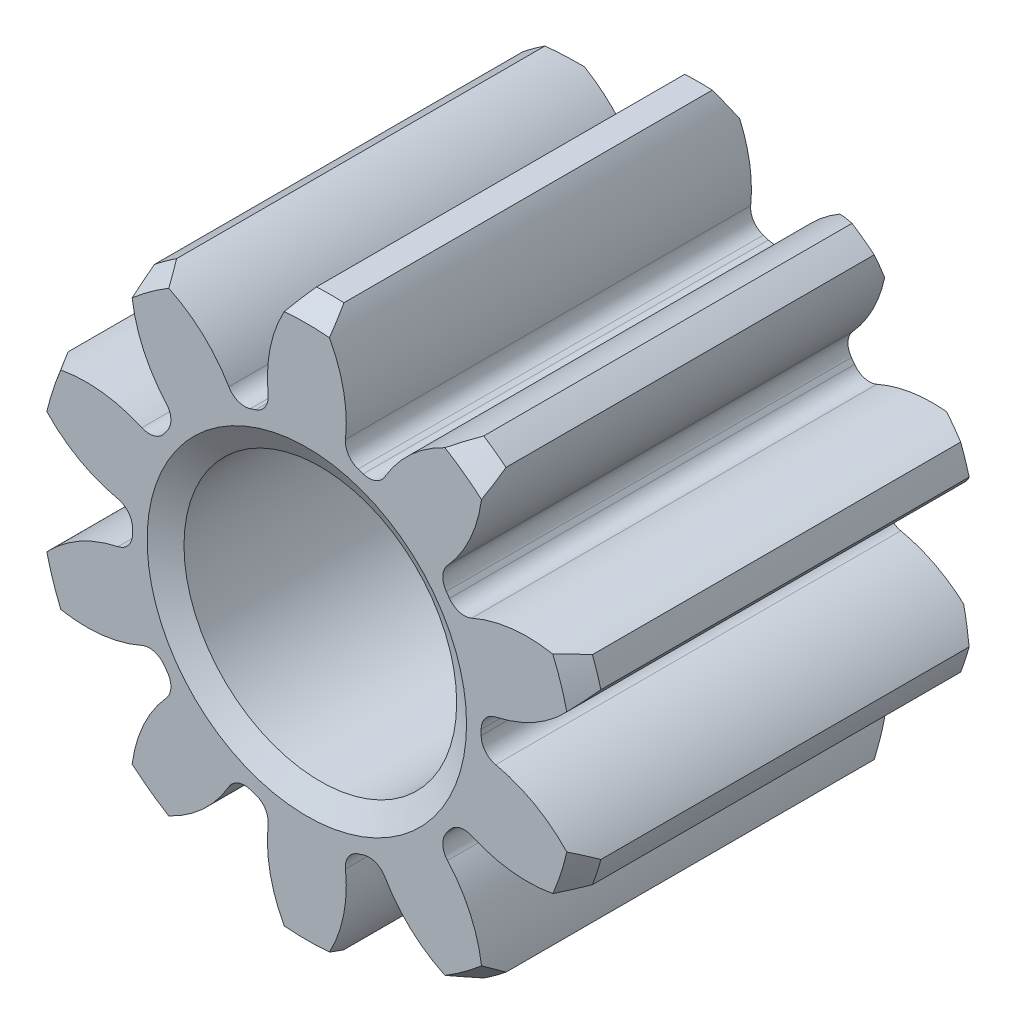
ISO-10303-21;
HEADER;
FILE_DESCRIPTION(('STEP AP214'),'2;1');
FILE_NAME('part.step','',(''),(''),'','','');
FILE_SCHEMA(('AUTOMOTIVE_DESIGN { 1 0 10303 214 1 1 1 1 }'));
ENDSEC;
DATA;
#1=APPLICATION_CONTEXT('core data for automotive mechanical design processes');
#2=APPLICATION_PROTOCOL_DEFINITION('international standard','automotive_design',2000,#1);
#3=PRODUCT_CONTEXT('',#1,'mechanical');
#4=PRODUCT('Part','Part','',(#3));
#5=PRODUCT_RELATED_PRODUCT_CATEGORY('part','',(#4));
#6=PRODUCT_DEFINITION_FORMATION('','',#4);
#7=PRODUCT_DEFINITION_CONTEXT('part definition',#1,'design');
#8=PRODUCT_DEFINITION('design','',#6,#7);
#9=PRODUCT_DEFINITION_SHAPE('','',#8);
#10=(LENGTH_UNIT() NAMED_UNIT(*) SI_UNIT(.MILLI.,.METRE.));
#11=(NAMED_UNIT(*) PLANE_ANGLE_UNIT() SI_UNIT($,.RADIAN.));
#12=(NAMED_UNIT(*) SI_UNIT($,.STERADIAN.) SOLID_ANGLE_UNIT());
#13=UNCERTAINTY_MEASURE_WITH_UNIT(LENGTH_MEASURE(1.E-05),#10,'distance_accuracy_value','');
#14=(GEOMETRIC_REPRESENTATION_CONTEXT(3) GLOBAL_UNCERTAINTY_ASSIGNED_CONTEXT((#13)) GLOBAL_UNIT_ASSIGNED_CONTEXT((#10,
#11,#12)) REPRESENTATION_CONTEXT('',''));
#15=CARTESIAN_POINT('',(0.,0.,0.));
#16=DIRECTION('',(0.,0.,1.));
#17=DIRECTION('',(1.,0.,0.));
#18=AXIS2_PLACEMENT_3D('',#15,#16,#17);
#19=CARTESIAN_POINT('',(0.,0.,-1.3));
#20=DIRECTION('',(0.,0.,1.));
#21=DIRECTION('',(1.,0.,0.));
#22=AXIS2_PLACEMENT_3D('',#19,#20,#21);
#23=CYLINDRICAL_SURFACE('',#22,1.8);
#24=DIRECTION('',(0.,0.,1.));
#25=VECTOR('',#24,1.);
#26=CARTESIAN_POINT('',(0.0881216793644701,1.79784164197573,-1.3));
#27=LINE('',#26,#25);
#28=CARTESIAN_POINT('',(0.0881216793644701,1.79784164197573,-1.2133974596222));
#29=VERTEX_POINT('',#28);
#30=CARTESIAN_POINT('',(0.0881216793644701,1.79784164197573,1.15000000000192));
#31=VERTEX_POINT('',#30);
#32=EDGE_CURVE('E989',#29,#31,#27,.T.);
#33=ORIENTED_EDGE('',*,*,#32,.F.);
#34=CARTESIAN_POINT('',(0.,0.,-1.21339745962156));
#35=DIRECTION('',(0.,0.,1.));
#36=DIRECTION('',(1.,0.,0.));
#37=AXIS2_PLACEMENT_3D('',#34,#35,#36);
#38=CIRCLE('',#37,1.8);
#39=CARTESIAN_POINT('',(-0.0881216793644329,1.79784164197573,-1.2133974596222));
#40=VERTEX_POINT('',#39);
#41=EDGE_CURVE('E992',#29,#40,#38,.T.);
#42=ORIENTED_EDGE('',*,*,#41,.T.);
#43=DIRECTION('',(0.,0.,1.));
#44=VECTOR('',#43,1.);
#45=CARTESIAN_POINT('',(-0.0881216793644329,1.79784164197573,-1.3));
#46=LINE('',#45,#44);
#47=CARTESIAN_POINT('',(-0.0881216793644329,1.79784164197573,1.15000000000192));
#48=VERTEX_POINT('',#47);
#49=EDGE_CURVE('E2365',#40,#48,#46,.T.);
#50=ORIENTED_EDGE('',*,*,#49,.T.);
#51=CARTESIAN_POINT('',(0.,0.,1.15));
#52=DIRECTION('',(0.,0.,1.));
#53=DIRECTION('',(1.,0.,0.));
#54=AXIS2_PLACEMENT_3D('',#51,#52,#53);
#55=CIRCLE('',#54,1.8);
#56=EDGE_CURVE('E994',#48,#31,#55,.F.);
#57=ORIENTED_EDGE('',*,*,#56,.T.);
#58=EDGE_LOOP('',(#33,#42,#50,#57));
#59=FACE_BOUND('',#58,.T.);
#60=ADVANCED_FACE('F45',(#59),#23,.T.);
#61=DIRECTION('',(0.,0.,1.));
#62=VECTOR('',#61,1.);
#63=CARTESIAN_POINT('',(0.985452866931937,1.50628106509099,-1.3));
#64=LINE('',#63,#62);
#65=CARTESIAN_POINT('',(0.985452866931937,1.50628106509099,-1.2133974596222));
#66=VERTEX_POINT('',#65);
#67=CARTESIAN_POINT('',(0.985452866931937,1.50628106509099,1.15000000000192));
#68=VERTEX_POINT('',#67);
#69=EDGE_CURVE('E998',#66,#68,#64,.T.);
#70=ORIENTED_EDGE('',*,*,#69,.T.);
#71=CARTESIAN_POINT('',(1.12803673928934,1.40268781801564,1.15000000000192));
#72=VERTEX_POINT('',#71);
#73=EDGE_CURVE('E1391',#68,#72,#55,.F.);
#74=ORIENTED_EDGE('',*,*,#73,.T.);
#75=DIRECTION('',(0.,0.,1.));
#76=VECTOR('',#75,1.);
#77=CARTESIAN_POINT('',(1.12803673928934,1.40268781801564,-1.3));
#78=LINE('',#77,#76);
#79=CARTESIAN_POINT('',(1.12803673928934,1.40268781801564,-1.2133974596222));
#80=VERTEX_POINT('',#79);
#81=EDGE_CURVE('E1292',#80,#72,#78,.T.);
#82=ORIENTED_EDGE('',*,*,#81,.F.);
#83=EDGE_CURVE('E1006',#80,#66,#38,.T.);
#84=ORIENTED_EDGE('',*,*,#83,.T.);
#85=EDGE_LOOP('',(#70,#74,#82,#84));
#86=FACE_BOUND('',#85,.T.);
#87=ADVANCED_FACE('F979',(#86),#23,.T.);
#88=DIRECTION('',(0.,0.,1.));
#89=VECTOR('',#88,1.);
#90=CARTESIAN_POINT('',(-1.68261791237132,0.639372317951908,-1.3));
#91=LINE('',#90,#89);
#92=CARTESIAN_POINT('',(-1.68261791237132,0.639372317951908,-1.2133974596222));
#93=VERTEX_POINT('',#92);
#94=CARTESIAN_POINT('',(-1.68261791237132,0.639372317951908,1.15000000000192));
#95=VERTEX_POINT('',#94);
#96=EDGE_CURVE('E2148',#93,#95,#91,.T.);
#97=ORIENTED_EDGE('',*,*,#96,.F.);
#98=CARTESIAN_POINT('',(-1.73708010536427,0.471754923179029,-1.2133974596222));
#99=VERTEX_POINT('',#98);
#100=EDGE_CURVE('E1014',#93,#99,#38,.T.);
#101=ORIENTED_EDGE('',*,*,#100,.T.);
#102=DIRECTION('',(0.,0.,1.));
#103=VECTOR('',#102,1.);
#104=CARTESIAN_POINT('',(-1.73708010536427,0.471754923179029,-1.3));
#105=LINE('',#104,#103);
#106=CARTESIAN_POINT('',(-1.73708010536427,0.471754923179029,1.15000000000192));
#107=VERTEX_POINT('',#106);
#108=EDGE_CURVE('E2284',#99,#107,#105,.T.);
#109=ORIENTED_EDGE('',*,*,#108,.T.);
#110=EDGE_CURVE('E1374',#107,#95,#55,.F.);
#111=ORIENTED_EDGE('',*,*,#110,.T.);
#112=EDGE_LOOP('',(#97,#101,#109,#111));
#113=FACE_BOUND('',#112,.T.);
#114=ADVANCED_FACE('F984',(#113),#23,.T.);
#115=DIRECTION('',(0.,0.,1.));
#116=VECTOR('',#115,1.);
#117=CARTESIAN_POINT('',(-1.12803673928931,1.40268781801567,-1.3));
#118=LINE('',#117,#116);
#119=CARTESIAN_POINT('',(-1.12803673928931,1.40268781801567,-1.2133974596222));
#120=VERTEX_POINT('',#119);
#121=CARTESIAN_POINT('',(-1.12803673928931,1.40268781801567,1.15000000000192));
#122=VERTEX_POINT('',#121);
#123=EDGE_CURVE('E2152',#120,#122,#118,.T.);
#124=ORIENTED_EDGE('',*,*,#123,.T.);
#125=CARTESIAN_POINT('',(-0.985452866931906,1.50628106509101,1.15000000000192));
#126=VERTEX_POINT('',#125);
#127=EDGE_CURVE('E1379',#122,#126,#55,.F.);
#128=ORIENTED_EDGE('',*,*,#127,.T.);
#129=DIRECTION('',(0.,0.,1.));
#130=VECTOR('',#129,1.);
#131=CARTESIAN_POINT('',(-0.985452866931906,1.50628106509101,-1.3));
#132=LINE('',#131,#130);
#133=CARTESIAN_POINT('',(-0.985452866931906,1.50628106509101,-1.2133974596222));
#134=VERTEX_POINT('',#133);
#135=EDGE_CURVE('E2366',#134,#126,#132,.T.);
#136=ORIENTED_EDGE('',*,*,#135,.F.);
#137=EDGE_CURVE('E1007',#134,#120,#38,.T.);
#138=ORIENTED_EDGE('',*,*,#137,.T.);
#139=EDGE_LOOP('',(#124,#128,#136,#138));
#140=FACE_BOUND('',#139,.T.);
#141=ADVANCED_FACE('F2080',(#140),#23,.T.);
#142=DIRECTION('',(0.,0.,1.));
#143=VECTOR('',#142,1.);
#144=CARTESIAN_POINT('',(0.985452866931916,-1.506281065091,-1.3));
#145=LINE('',#144,#143);
#146=CARTESIAN_POINT('',(0.985452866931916,-1.506281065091,-1.2133974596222));
#147=VERTEX_POINT('',#146);
#148=CARTESIAN_POINT('',(0.985452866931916,-1.506281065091,1.15000000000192));
#149=VERTEX_POINT('',#148);
#150=EDGE_CURVE('E567',#147,#149,#145,.T.);
#151=ORIENTED_EDGE('',*,*,#150,.F.);
#152=CARTESIAN_POINT('',(1.12803673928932,-1.40268781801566,-1.2133974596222));
#153=VERTEX_POINT('',#152);
#154=EDGE_CURVE('E1352',#147,#153,#38,.T.);
#155=ORIENTED_EDGE('',*,*,#154,.T.);
#156=DIRECTION('',(0.,0.,1.));
#157=VECTOR('',#156,1.);
#158=CARTESIAN_POINT('',(1.12803673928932,-1.40268781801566,-1.3));
#159=LINE('',#158,#157);
#160=CARTESIAN_POINT('',(1.12803673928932,-1.40268781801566,1.15000000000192));
#161=VERTEX_POINT('',#160);
#162=EDGE_CURVE('E1340',#153,#161,#159,.T.);
#163=ORIENTED_EDGE('',*,*,#162,.T.);
#164=EDGE_CURVE('E1350',#161,#149,#55,.F.);
#165=ORIENTED_EDGE('',*,*,#164,.T.);
#166=EDGE_LOOP('',(#151,#155,#163,#165));
#167=FACE_BOUND('',#166,.T.);
#168=ADVANCED_FACE('F1349',(#167),#23,.T.);
#169=DIRECTION('',(0.,0.,1.));
#170=VECTOR('',#169,1.);
#171=CARTESIAN_POINT('',(0.0881216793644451,-1.79784164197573,-1.3));
#172=LINE('',#171,#170);
#173=CARTESIAN_POINT('',(0.0881216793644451,-1.79784164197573,-1.2133974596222));
#174=VERTEX_POINT('',#173);
#175=CARTESIAN_POINT('',(0.0881216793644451,-1.79784164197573,1.15000000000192));
#176=VERTEX_POINT('',#175);
#177=EDGE_CURVE('E2313',#174,#176,#172,.T.);
#178=ORIENTED_EDGE('',*,*,#177,.T.);
#179=CARTESIAN_POINT('',(-0.0881216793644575,-1.79784164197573,1.15000000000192));
#180=VERTEX_POINT('',#179);
#181=EDGE_CURVE('E642',#176,#180,#55,.F.);
#182=ORIENTED_EDGE('',*,*,#181,.T.);
#183=DIRECTION('',(0.,0.,1.));
#184=VECTOR('',#183,1.);
#185=CARTESIAN_POINT('',(-0.0881216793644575,-1.79784164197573,-1.3));
#186=LINE('',#185,#184);
#187=CARTESIAN_POINT('',(-0.0881216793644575,-1.79784164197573,-1.2133974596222));
#188=VERTEX_POINT('',#187);
#189=EDGE_CURVE('E2296',#188,#180,#186,.T.);
#190=ORIENTED_EDGE('',*,*,#189,.F.);
#191=EDGE_CURVE('E2167',#188,#174,#38,.T.);
#192=ORIENTED_EDGE('',*,*,#191,.T.);
#193=EDGE_LOOP('',(#178,#182,#190,#192));
#194=FACE_BOUND('',#193,.T.);
#195=ADVANCED_FACE('F2065',(#194),#23,.T.);
#196=DIRECTION('',(0.,0.,1.));
#197=VECTOR('',#196,1.);
#198=CARTESIAN_POINT('',(-0.985452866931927,-1.50628106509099,-1.3));
#199=LINE('',#198,#197);
#200=CARTESIAN_POINT('',(-0.985452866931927,-1.50628106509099,-1.2133974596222));
#201=VERTEX_POINT('',#200);
#202=CARTESIAN_POINT('',(-0.985452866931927,-1.50628106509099,1.15000000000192));
#203=VERTEX_POINT('',#202);
#204=EDGE_CURVE('E2339',#201,#203,#199,.T.);
#205=ORIENTED_EDGE('',*,*,#204,.T.);
#206=CARTESIAN_POINT('',(-1.12803673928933,-1.40268781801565,1.15000000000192));
#207=VERTEX_POINT('',#206);
#208=EDGE_CURVE('E1364',#203,#207,#55,.F.);
#209=ORIENTED_EDGE('',*,*,#208,.T.);
#210=DIRECTION('',(0.,0.,1.));
#211=VECTOR('',#210,1.);
#212=CARTESIAN_POINT('',(-1.12803673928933,-1.40268781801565,-1.3));
#213=LINE('',#212,#211);
#214=CARTESIAN_POINT('',(-1.12803673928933,-1.40268781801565,-1.2133974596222));
#215=VERTEX_POINT('',#214);
#216=EDGE_CURVE('E2321',#215,#207,#213,.T.);
#217=ORIENTED_EDGE('',*,*,#216,.F.);
#218=EDGE_CURVE('E2163',#215,#201,#38,.T.);
#219=ORIENTED_EDGE('',*,*,#218,.T.);
#220=EDGE_LOOP('',(#205,#209,#217,#219));
#221=FACE_BOUND('',#220,.T.);
#222=ADVANCED_FACE('F2057',(#221),#23,.T.);
#223=DIRECTION('',(0.,0.,1.));
#224=VECTOR('',#223,1.);
#225=CARTESIAN_POINT('',(-1.68261791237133,-0.639372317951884,-1.3));
#226=LINE('',#225,#224);
#227=CARTESIAN_POINT('',(-1.68261791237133,-0.639372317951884,-1.2133974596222));
#228=VERTEX_POINT('',#227);
#229=CARTESIAN_POINT('',(-1.68261791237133,-0.639372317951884,1.15000000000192));
#230=VERTEX_POINT('',#229);
#231=EDGE_CURVE('E2523',#228,#230,#226,.T.);
#232=ORIENTED_EDGE('',*,*,#231,.T.);
#233=CARTESIAN_POINT('',(-1.73708010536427,-0.471754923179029,1.15000000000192));
#234=VERTEX_POINT('',#233);
#235=EDGE_CURVE('E1071',#230,#234,#55,.F.);
#236=ORIENTED_EDGE('',*,*,#235,.T.);
#237=DIRECTION('',(0.,0.,1.));
#238=VECTOR('',#237,1.);
#239=CARTESIAN_POINT('',(-1.73708010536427,-0.471754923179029,-1.3));
#240=LINE('',#239,#238);
#241=CARTESIAN_POINT('',(-1.73708010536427,-0.471754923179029,-1.2133974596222));
#242=VERTEX_POINT('',#241);
#243=EDGE_CURVE('E2285',#242,#234,#240,.T.);
#244=ORIENTED_EDGE('',*,*,#243,.F.);
#245=EDGE_CURVE('E2160',#242,#228,#38,.T.);
#246=ORIENTED_EDGE('',*,*,#245,.T.);
#247=EDGE_LOOP('',(#232,#236,#244,#246));
#248=FACE_BOUND('',#247,.T.);
#249=ADVANCED_FACE('F2048',(#248),#23,.T.);
#250=DIRECTION('',(0.,0.,1.));
#251=VECTOR('',#250,1.);
#252=CARTESIAN_POINT('',(1.68261791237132,-0.639372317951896,-1.3));
#253=LINE('',#252,#251);
#254=CARTESIAN_POINT('',(1.68261791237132,-0.639372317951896,-1.2133974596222));
#255=VERTEX_POINT('',#254);
#256=CARTESIAN_POINT('',(1.68261791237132,-0.639372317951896,1.15000000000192));
#257=VERTEX_POINT('',#256);
#258=EDGE_CURVE('E548',#255,#257,#253,.T.);
#259=ORIENTED_EDGE('',*,*,#258,.F.);
#260=CARTESIAN_POINT('',(1.73708010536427,-0.471754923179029,-1.2133974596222));
#261=VERTEX_POINT('',#260);
#262=EDGE_CURVE('E1019',#255,#261,#38,.T.);
#263=ORIENTED_EDGE('',*,*,#262,.T.);
#264=DIRECTION('',(0.,0.,1.));
#265=VECTOR('',#264,1.);
#266=CARTESIAN_POINT('',(1.73708010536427,-0.471754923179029,-1.3));
#267=LINE('',#266,#265);
#268=CARTESIAN_POINT('',(1.73708010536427,-0.471754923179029,1.15000000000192));
#269=VERTEX_POINT('',#268);
#270=EDGE_CURVE('E1411',#261,#269,#267,.T.);
#271=ORIENTED_EDGE('',*,*,#270,.T.);
#272=EDGE_CURVE('E1020',#269,#257,#55,.F.);
#273=ORIENTED_EDGE('',*,*,#272,.T.);
#274=EDGE_LOOP('',(#259,#263,#271,#273));
#275=FACE_BOUND('',#274,.T.);
#276=ADVANCED_FACE('F975',(#275),#23,.T.);
#277=CARTESIAN_POINT('',(0.,0.,-1.21339745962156));
#278=DIRECTION('',(0.,0.,1.));
#279=DIRECTION('',(1.,0.,0.));
#280=AXIS2_PLACEMENT_3D('',#277,#278,#279);
#281=CONICAL_SURFACE('',#280,1.8,1.0471975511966);
#282=CARTESIAN_POINT('',(0.178253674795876,1.63999469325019,-1.3002));
#283=CARTESIAN_POINT('',(0.166077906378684,1.66764876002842,-1.28512077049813));
#284=CARTESIAN_POINT('',(0.152467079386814,1.69464635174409,-1.27033834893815));
#285=CARTESIAN_POINT('',(0.122375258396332,1.74732867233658,-1.24136707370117));
#286=CARTESIAN_POINT('',(0.105894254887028,1.77301339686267,-1.22717822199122));
#287=CARTESIAN_POINT('',(0.0879781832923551,1.79804164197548,-1.21328618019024));
#288=B_SPLINE_CURVE_WITH_KNOTS('',3,(#282,#283,#284,#285,#286,#287),.UNSPECIFIED.,.F.,.F.,(4,2,
4),(0.,0.100964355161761,0.201929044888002),.UNSPECIFIED.);
#289=CARTESIAN_POINT('',(0.178092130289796,1.64036068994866,-1.3));
#290=VERTEX_POINT('',#289);
#291=EDGE_CURVE('E860',#290,#29,#288,.T.);
#292=ORIENTED_EDGE('',*,*,#291,.F.);
#293=CARTESIAN_POINT('',(0.,0.,-1.3));
#294=DIRECTION('',(0.,0.,1.));
#295=DIRECTION('',(1.,0.,0.));
#296=AXIS2_PLACEMENT_3D('',#293,#294,#295);
#297=CIRCLE('',#296,1.65);
#298=CARTESIAN_POINT('',(-0.178092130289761,1.64036068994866,-1.3));
#299=VERTEX_POINT('',#298);
#300=EDGE_CURVE('E1442',#299,#290,#297,.F.);
#301=ORIENTED_EDGE('',*,*,#300,.F.);
#302=CARTESIAN_POINT('',(-0.0879781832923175,1.79804164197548,-1.21328618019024));
#303=CARTESIAN_POINT('',(-0.105894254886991,1.77301339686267,-1.22717822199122));
#304=CARTESIAN_POINT('',(-0.122375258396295,1.74732867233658,-1.24136707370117));
#305=CARTESIAN_POINT('',(-0.152467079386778,1.6946463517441,-1.27033834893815));
#306=CARTESIAN_POINT('',(-0.166077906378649,1.66764876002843,-1.28512077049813));
#307=CARTESIAN_POINT('',(-0.178253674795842,1.63999469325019,-1.3002));
#308=B_SPLINE_CURVE_WITH_KNOTS('',3,(#302,#303,#304,#305,#306,#307),.UNSPECIFIED.,.F.,.F.,(4,2,
4),(0.,0.100964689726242,0.201929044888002),.UNSPECIFIED.);
#309=EDGE_CURVE('E806',#40,#299,#308,.T.);
#310=ORIENTED_EDGE('',*,*,#309,.F.);
#311=ORIENTED_EDGE('',*,*,#41,.F.);
#312=EDGE_LOOP('',(#292,#301,#310,#311));
#313=FACE_BOUND('',#312,.T.);
#314=ADVANCED_FACE('F722',(#313),#281,.T.);
#315=CARTESIAN_POINT('',(0.985652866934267,1.50634737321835,-1.2133022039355));
#316=CARTESIAN_POINT('',(0.956453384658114,1.49663066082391,-1.22719181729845));
#317=CARTESIAN_POINT('',(0.928028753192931,1.48553988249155,-1.24137811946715));
#318=CARTESIAN_POINT('',(0.872729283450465,1.46061023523,-1.2703440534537));
#319=CARTESIAN_POINT('',(0.845854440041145,1.44677137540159,-1.2851236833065));
#320=CARTESIAN_POINT('',(0.819754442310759,1.43155845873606,-1.3002));
#321=B_SPLINE_CURVE_WITH_KNOTS('',3,(#315,#316,#317,#318,#319,#320),.UNSPECIFIED.,.F.,.F.,(4,2,
4),(0.,0.100945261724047,0.201890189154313),.UNSPECIFIED.);
#322=CARTESIAN_POINT('',(0.820100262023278,1.43175960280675,-1.3));
#323=VERTEX_POINT('',#322);
#324=EDGE_CURVE('E852',#66,#323,#321,.T.);
#325=ORIENTED_EDGE('',*,*,#324,.F.);
#326=ORIENTED_EDGE('',*,*,#83,.F.);
#327=CARTESIAN_POINT('',(1.10817494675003,1.22200869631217,-1.3002));
#328=CARTESIAN_POINT('',(1.11457757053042,1.25153059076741,-1.28512456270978));
#329=CARTESIAN_POINT('',(1.11943413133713,1.28136477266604,-1.27034577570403));
#330=CARTESIAN_POINT('',(1.12605513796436,1.34165781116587,-1.24138145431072));
#331=CARTESIAN_POINT('',(1.12781957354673,1.37211666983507,-1.2271959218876));
#332=CARTESIAN_POINT('',(1.12803793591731,1.40288781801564,-1.21330704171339));
#333=B_SPLINE_CURVE_WITH_KNOTS('',3,(#327,#328,#329,#330,#331,#332),.UNSPECIFIED.,.F.,.F.,(4,2,
4),(0.,0.100939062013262,0.201878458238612),.UNSPECIFIED.);
#334=CARTESIAN_POINT('',(1.10825938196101,1.22239974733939,-1.3));
#335=VERTEX_POINT('',#334);
#336=EDGE_CURVE('E845',#335,#80,#333,.T.);
#337=ORIENTED_EDGE('',*,*,#336,.F.);
#338=EDGE_CURVE('E1458',#323,#335,#297,.F.);
#339=ORIENTED_EDGE('',*,*,#338,.F.);
#340=EDGE_LOOP('',(#325,#326,#337,#339));
#341=FACE_BOUND('',#340,.T.);
#342=ADVANCED_FACE('F2025',(#341),#281,.T.);
#343=CARTESIAN_POINT('',(-1.50464422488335,0.676315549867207,-1.3002));
#344=CARTESIAN_POINT('',(-1.53470136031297,0.673281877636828,-1.28512375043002));
#345=CARTESIAN_POINT('',(-1.56457771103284,0.668681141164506,-1.27034418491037));
#346=CARTESIAN_POINT('',(-1.62396894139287,0.656345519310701,-1.24137837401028));
#347=CARTESIAN_POINT('',(-1.65348381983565,0.648610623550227,-1.22719213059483));
#348=CARTESIAN_POINT('',(-1.68281791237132,0.63930865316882,-1.21330257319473));
#349=B_SPLINE_CURVE_WITH_KNOTS('',3,(#343,#344,#345,#346,#347,#348),.UNSPECIFIED.,.F.,.F.,(4,2,
4),(0.,0.100944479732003,0.201889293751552),.UNSPECIFIED.);
#350=CARTESIAN_POINT('',(-1.5050422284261,0.676275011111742,-1.3));
#351=VERTEX_POINT('',#350);
#352=EDGE_CURVE('E830',#351,#93,#349,.T.);
#353=ORIENTED_EDGE('',*,*,#352,.F.);
#354=CARTESIAN_POINT('',(-1.61510921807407,0.337523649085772,-1.3));
#355=VERTEX_POINT('',#354);
#356=EDGE_CURVE('E2496',#355,#351,#297,.F.);
#357=ORIENTED_EDGE('',*,*,#356,.F.);
#358=CARTESIAN_POINT('',(-1.79493300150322,0.56124924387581,-1.16684325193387));
#359=CARTESIAN_POINT('',(-1.7774589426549,0.53019654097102,-1.18182287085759));
#360=CARTESIAN_POINT('',(-1.75814540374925,0.500376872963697,-1.1973286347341));
#361=CARTESIAN_POINT('',(-1.7008604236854,0.422542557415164,-1.24102617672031));
#362=CARTESIAN_POINT('',(-1.65964366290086,0.377354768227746,-1.27012971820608));
#363=CARTESIAN_POINT('',(-1.60787535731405,0.331053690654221,-1.30485193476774));
#364=CARTESIAN_POINT('',(-1.60085312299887,0.324972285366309,-1.30952700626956));
#365=CARTESIAN_POINT('',(-1.54314876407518,0.276581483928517,-1.34767847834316));
#366=CARTESIAN_POINT('',(-1.48807137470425,0.240142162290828,-1.38245834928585));
#367=CARTESIAN_POINT('',(-1.40094363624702,0.195359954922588,-1.4359895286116));
#368=CARTESIAN_POINT('',(-1.37093893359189,0.182024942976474,-1.45418300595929));
#369=CARTESIAN_POINT('',(-1.30984799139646,0.158841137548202,-1.49085834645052));
#370=CARTESIAN_POINT('',(-1.27876346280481,0.148987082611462,-1.50933972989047));
#371=CARTESIAN_POINT('',(-1.24725844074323,0.140872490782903,-1.52794440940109));
#372=B_SPLINE_CURVE_WITH_KNOTS('',3,(#358,#359,#360,#361,#362,#363,#364,#365,#366,#367,#368,
#369,#370,#371),.UNSPECIFIED.,.F.,.F.,(4,2,2,2,2,2,4),(0.,0.116018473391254,0.317719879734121,
0.348923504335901,0.570938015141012,0.683417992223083,0.795727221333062),.UNSPECIFIED.);
#373=EDGE_CURVE('E766',#99,#355,#372,.T.);
#374=ORIENTED_EDGE('',*,*,#373,.F.);
#375=ORIENTED_EDGE('',*,*,#100,.F.);
#376=EDGE_LOOP('',(#353,#357,#374,#375));
#377=FACE_BOUND('',#376,.T.);
#378=ADVANCED_FACE('F2016',(#377),#281,.T.);
#379=CARTESIAN_POINT('',(-1.12803793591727,1.40288781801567,-1.21330704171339));
#380=CARTESIAN_POINT('',(-1.1278195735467,1.37211666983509,-1.2271959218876));
#381=CARTESIAN_POINT('',(-1.12605513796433,1.34165781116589,-1.24138145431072));
#382=CARTESIAN_POINT('',(-1.1194341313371,1.28136477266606,-1.27034577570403));
#383=CARTESIAN_POINT('',(-1.11457757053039,1.25153059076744,-1.28512456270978));
#384=CARTESIAN_POINT('',(-1.10817494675,1.2220086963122,-1.3002));
#385=B_SPLINE_CURVE_WITH_KNOTS('',3,(#379,#380,#381,#382,#383,#384),.UNSPECIFIED.,.F.,.F.,(4,2,
4),(0.,0.10093939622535,0.201878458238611),.UNSPECIFIED.);
#386=CARTESIAN_POINT('',(-1.10825938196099,1.22239974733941,-1.3));
#387=VERTEX_POINT('',#386);
#388=EDGE_CURVE('E822',#120,#387,#385,.T.);
#389=ORIENTED_EDGE('',*,*,#388,.F.);
#390=ORIENTED_EDGE('',*,*,#137,.F.);
#391=CARTESIAN_POINT('',(-0.819754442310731,1.43155845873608,-1.3002));
#392=CARTESIAN_POINT('',(-0.845854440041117,1.44677137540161,-1.28512368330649));
#393=CARTESIAN_POINT('',(-0.872729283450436,1.46061023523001,-1.2703440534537));
#394=CARTESIAN_POINT('',(-0.928028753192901,1.48553988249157,-1.24137811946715));
#395=CARTESIAN_POINT('',(-0.956453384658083,1.49663066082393,-1.22719181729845));
#396=CARTESIAN_POINT('',(-0.985652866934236,1.50634737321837,-1.2133022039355));
#397=B_SPLINE_CURVE_WITH_KNOTS('',3,(#391,#392,#393,#394,#395,#396),.UNSPECIFIED.,.F.,.F.,(4,2,
4),(0.,0.100944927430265,0.201890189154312),.UNSPECIFIED.);
#398=CARTESIAN_POINT('',(-0.820100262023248,1.43175960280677,-1.3));
#399=VERTEX_POINT('',#398);
#400=EDGE_CURVE('E814',#399,#134,#397,.T.);
#401=ORIENTED_EDGE('',*,*,#400,.F.);
#402=EDGE_CURVE('E1465',#387,#399,#297,.F.);
#403=ORIENTED_EDGE('',*,*,#402,.F.);
#404=EDGE_LOOP('',(#389,#390,#401,#403));
#405=FACE_BOUND('',#404,.T.);
#406=ADVANCED_FACE('F2007',(#405),#281,.T.);
#407=CARTESIAN_POINT('',(0.819754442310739,-1.43155845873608,-1.3002));
#408=CARTESIAN_POINT('',(0.845854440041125,-1.44677137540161,-1.2851236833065));
#409=CARTESIAN_POINT('',(0.872729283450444,-1.46061023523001,-1.2703440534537));
#410=CARTESIAN_POINT('',(0.92802875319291,-1.48553988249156,-1.24137811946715));
#411=CARTESIAN_POINT('',(0.956453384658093,-1.49663066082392,-1.22719181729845));
#412=CARTESIAN_POINT('',(0.985652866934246,-1.50634737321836,-1.2133022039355));
#413=B_SPLINE_CURVE_WITH_KNOTS('',3,(#407,#408,#409,#410,#411,#412),.UNSPECIFIED.,.F.,.F.,(4,2,
4),(0.,0.100944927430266,0.201890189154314),.UNSPECIFIED.);
#414=CARTESIAN_POINT('',(0.820100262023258,-1.43175960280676,-1.3));
#415=VERTEX_POINT('',#414);
#416=EDGE_CURVE('E699',#415,#147,#413,.T.);
#417=ORIENTED_EDGE('',*,*,#416,.F.);
#418=CARTESIAN_POINT('',(1.10825938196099,-1.2223997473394,-1.3));
#419=VERTEX_POINT('',#418);
#420=EDGE_CURVE('E1030',#419,#415,#297,.F.);
#421=ORIENTED_EDGE('',*,*,#420,.F.);
#422=CARTESIAN_POINT('',(1.12803793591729,-1.40288781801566,-1.21330704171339));
#423=CARTESIAN_POINT('',(1.12781957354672,-1.37211666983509,-1.2271959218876));
#424=CARTESIAN_POINT('',(1.12605513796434,-1.34165781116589,-1.24138145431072));
#425=CARTESIAN_POINT('',(1.11943413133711,-1.28136477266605,-1.27034577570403));
#426=CARTESIAN_POINT('',(1.1145775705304,-1.25153059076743,-1.28512456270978));
#427=CARTESIAN_POINT('',(1.10817494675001,-1.22200869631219,-1.3002));
#428=B_SPLINE_CURVE_WITH_KNOTS('',3,(#422,#423,#424,#425,#426,#427),.UNSPECIFIED.,.F.,.F.,(4,2,
4),(0.,0.10093939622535,0.201878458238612),.UNSPECIFIED.);
#429=EDGE_CURVE('E749',#153,#419,#428,.T.);
#430=ORIENTED_EDGE('',*,*,#429,.F.);
#431=ORIENTED_EDGE('',*,*,#154,.F.);
#432=EDGE_LOOP('',(#417,#421,#430,#431));
#433=FACE_BOUND('',#432,.T.);
#434=ADVANCED_FACE('F1998',(#433),#281,.T.);
#435=CARTESIAN_POINT('',(0.0879781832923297,-1.79804164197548,-1.21328618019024));
#436=CARTESIAN_POINT('',(0.105894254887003,-1.77301339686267,-1.22717822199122));
#437=CARTESIAN_POINT('',(0.122375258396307,-1.74732867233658,-1.24136707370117));
#438=CARTESIAN_POINT('',(0.15246707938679,-1.6946463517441,-1.27033834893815));
#439=CARTESIAN_POINT('',(0.16607790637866,-1.66764876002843,-1.28512077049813));
#440=CARTESIAN_POINT('',(0.178253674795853,-1.63999469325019,-1.3002));
#441=B_SPLINE_CURVE_WITH_KNOTS('',3,(#435,#436,#437,#438,#439,#440),.UNSPECIFIED.,.F.,.F.,(4,2,
4),(0.,0.100964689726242,0.201929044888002),.UNSPECIFIED.);
#442=CARTESIAN_POINT('',(0.178092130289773,-1.64036068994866,-1.3));
#443=VERTEX_POINT('',#442);
#444=EDGE_CURVE('E689',#174,#443,#441,.T.);
#445=ORIENTED_EDGE('',*,*,#444,.F.);
#446=ORIENTED_EDGE('',*,*,#191,.F.);
#447=CARTESIAN_POINT('',(-0.178253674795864,-1.63999469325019,-1.3002));
#448=CARTESIAN_POINT('',(-0.166077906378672,-1.66764876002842,-1.28512077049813));
#449=CARTESIAN_POINT('',(-0.152467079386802,-1.6946463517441,-1.27033834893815));
#450=CARTESIAN_POINT('',(-0.122375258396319,-1.74732867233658,-1.24136707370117));
#451=CARTESIAN_POINT('',(-0.105894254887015,-1.77301339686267,-1.22717822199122));
#452=CARTESIAN_POINT('',(-0.0879781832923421,-1.79804164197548,-1.21328618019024));
#453=B_SPLINE_CURVE_WITH_KNOTS('',3,(#447,#448,#449,#450,#451,#452),.UNSPECIFIED.,.F.,.F.,(4,2,
4),(0.,0.100964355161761,0.201929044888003),.UNSPECIFIED.);
#454=CARTESIAN_POINT('',(-0.178092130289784,-1.64036068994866,-1.3));
#455=VERTEX_POINT('',#454);
#456=EDGE_CURVE('E700',#455,#188,#453,.T.);
#457=ORIENTED_EDGE('',*,*,#456,.F.);
#458=EDGE_CURVE('E2476',#443,#455,#297,.F.);
#459=ORIENTED_EDGE('',*,*,#458,.F.);
#460=EDGE_LOOP('',(#445,#446,#457,#459));
#461=FACE_BOUND('',#460,.T.);
#462=ADVANCED_FACE('F1989',(#461),#281,.T.);
#463=CARTESIAN_POINT('',(-0.985652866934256,-1.50634737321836,-1.2133022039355));
#464=CARTESIAN_POINT('',(-0.956453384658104,-1.49663066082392,-1.22719181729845));
#465=CARTESIAN_POINT('',(-0.928028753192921,-1.48553988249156,-1.24137811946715));
#466=CARTESIAN_POINT('',(-0.872729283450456,-1.46061023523,-1.2703440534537));
#467=CARTESIAN_POINT('',(-0.845854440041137,-1.4467713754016,-1.28512368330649));
#468=CARTESIAN_POINT('',(-0.819754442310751,-1.43155845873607,-1.3002));
#469=B_SPLINE_CURVE_WITH_KNOTS('',3,(#463,#464,#465,#466,#467,#468),.UNSPECIFIED.,.F.,.F.,(4,2,
4),(0.,0.100945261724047,0.201890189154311),.UNSPECIFIED.);
#470=CARTESIAN_POINT('',(-0.820100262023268,-1.43175960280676,-1.3));
#471=VERTEX_POINT('',#470);
#472=EDGE_CURVE('E796',#201,#471,#469,.T.);
#473=ORIENTED_EDGE('',*,*,#472,.F.);
#474=ORIENTED_EDGE('',*,*,#218,.F.);
#475=CARTESIAN_POINT('',(-1.10817494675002,-1.22200869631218,-1.3002));
#476=CARTESIAN_POINT('',(-1.11457757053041,-1.25153059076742,-1.28512456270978));
#477=CARTESIAN_POINT('',(-1.11943413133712,-1.28136477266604,-1.27034577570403));
#478=CARTESIAN_POINT('',(-1.12605513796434,-1.34165781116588,-1.24138145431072));
#479=CARTESIAN_POINT('',(-1.12781957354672,-1.37211666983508,-1.2271959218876));
#480=CARTESIAN_POINT('',(-1.1280379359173,-1.40288781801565,-1.21330704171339));
#481=B_SPLINE_CURVE_WITH_KNOTS('',3,(#475,#476,#477,#478,#479,#480),.UNSPECIFIED.,.F.,.F.,(4,2,
4),(0.,0.100939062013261,0.201878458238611),.UNSPECIFIED.);
#482=CARTESIAN_POINT('',(-1.108259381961,-1.22239974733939,-1.3));
#483=VERTEX_POINT('',#482);
#484=EDGE_CURVE('E789',#483,#215,#481,.T.);
#485=ORIENTED_EDGE('',*,*,#484,.F.);
#486=EDGE_CURVE('E2489',#471,#483,#297,.F.);
#487=ORIENTED_EDGE('',*,*,#486,.F.);
#488=EDGE_LOOP('',(#473,#474,#485,#487));
#489=FACE_BOUND('',#488,.T.);
#490=ADVANCED_FACE('F1980',(#489),#281,.T.);
#491=CARTESIAN_POINT('',(-1.68281791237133,-0.639308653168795,-1.21330257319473));
#492=CARTESIAN_POINT('',(-1.65348381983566,-0.648610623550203,-1.22719213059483));
#493=CARTESIAN_POINT('',(-1.62396894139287,-0.656345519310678,-1.24137837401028));
#494=CARTESIAN_POINT('',(-1.56457771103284,-0.668681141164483,-1.27034418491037));
#495=CARTESIAN_POINT('',(-1.53470136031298,-0.673281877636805,-1.28512375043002));
#496=CARTESIAN_POINT('',(-1.50464422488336,-0.676315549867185,-1.3002));
#497=B_SPLINE_CURVE_WITH_KNOTS('',3,(#491,#492,#493,#494,#495,#496),.UNSPECIFIED.,.F.,.F.,(4,2,
4),(0.,0.100944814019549,0.201889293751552),.UNSPECIFIED.);
#498=CARTESIAN_POINT('',(-1.50504222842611,-0.67627501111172,-1.3));
#499=VERTEX_POINT('',#498);
#500=EDGE_CURVE('E781',#228,#499,#497,.T.);
#501=ORIENTED_EDGE('',*,*,#500,.F.);
#502=ORIENTED_EDGE('',*,*,#245,.F.);
#503=CARTESIAN_POINT('',(-1.24725844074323,-0.140872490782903,-1.52794440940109));
#504=CARTESIAN_POINT('',(-1.29513047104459,-0.153159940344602,-1.49966529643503));
#505=CARTESIAN_POINT('',(-1.34213646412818,-0.16958034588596,-1.47162159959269));
#506=CARTESIAN_POINT('',(-1.43298868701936,-0.210266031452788,-1.41647597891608));
#507=CARTESIAN_POINT('',(-1.4768439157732,-0.234507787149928,-1.38937149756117));
#508=CARTESIAN_POINT('',(-1.54450058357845,-0.279911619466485,-1.34641326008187));
#509=CARTESIAN_POINT('',(-1.56961616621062,-0.298774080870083,-1.33017951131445));
#510=CARTESIAN_POINT('',(-1.60085141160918,-0.324971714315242,-1.30952811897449));
#511=CARTESIAN_POINT('',(-1.60787459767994,-0.331053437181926,-1.30485242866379));
#512=CARTESIAN_POINT('',(-1.65964857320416,-0.37735640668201,-1.27012652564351));
#513=CARTESIAN_POINT('',(-1.70086221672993,-0.422543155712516,-1.24102501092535));
#514=CARTESIAN_POINT('',(-1.7581443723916,-0.500376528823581,-1.19732930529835));
#515=CARTESIAN_POINT('',(-1.77745731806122,-0.53019599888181,-1.18182392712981));
#516=CARTESIAN_POINT('',(-1.79493300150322,-0.56124924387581,-1.16684325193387));
#517=B_SPLINE_CURVE_WITH_KNOTS('',3,(#503,#504,#505,#506,#507,#508,#509,#510,#511,#512,#513,
#514,#515,#516),.UNSPECIFIED.,.F.,.F.,(4,2,2,2,2,2,4),(0.,0.170758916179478,0.341008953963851,
0.446904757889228,0.478108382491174,0.679809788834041,0.795828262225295),.UNSPECIFIED.);
#518=CARTESIAN_POINT('',(-1.61510921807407,-0.337523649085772,-1.3));
#519=VERTEX_POINT('',#518);
#520=EDGE_CURVE('E774',#519,#242,#517,.T.);
#521=ORIENTED_EDGE('',*,*,#520,.F.);
#522=EDGE_CURVE('E2492',#499,#519,#297,.F.);
#523=ORIENTED_EDGE('',*,*,#522,.F.);
#524=EDGE_LOOP('',(#501,#502,#521,#523));
#525=FACE_BOUND('',#524,.T.);
#526=ADVANCED_FACE('F1971',(#525),#281,.T.);
#527=CARTESIAN_POINT('',(1.50464422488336,-0.676315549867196,-1.3002));
#528=CARTESIAN_POINT('',(1.53470136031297,-0.673281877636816,-1.28512375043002));
#529=CARTESIAN_POINT('',(1.56457771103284,-0.668681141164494,-1.27034418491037));
#530=CARTESIAN_POINT('',(1.62396894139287,-0.656345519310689,-1.24137837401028));
#531=CARTESIAN_POINT('',(1.65348381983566,-0.648610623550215,-1.22719213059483));
#532=CARTESIAN_POINT('',(1.68281791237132,-0.639308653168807,-1.21330257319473));
#533=B_SPLINE_CURVE_WITH_KNOTS('',3,(#527,#528,#529,#530,#531,#532),.UNSPECIFIED.,.F.,.F.,(4,2,
4),(0.,0.100944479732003,0.201889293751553),.UNSPECIFIED.);
#534=CARTESIAN_POINT('',(1.50504222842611,-0.67627501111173,-1.3));
#535=VERTEX_POINT('',#534);
#536=EDGE_CURVE('E758',#535,#255,#533,.T.);
#537=ORIENTED_EDGE('',*,*,#536,.F.);
#538=CARTESIAN_POINT('',(1.61510921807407,-0.337523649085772,-1.3));
#539=VERTEX_POINT('',#538);
#540=EDGE_CURVE('E1025',#539,#535,#297,.F.);
#541=ORIENTED_EDGE('',*,*,#540,.F.);
#542=CARTESIAN_POINT('',(1.79493300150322,-0.56124924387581,-1.16684325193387));
#543=CARTESIAN_POINT('',(1.7774589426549,-0.53019654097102,-1.18182287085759));
#544=CARTESIAN_POINT('',(1.75814540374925,-0.500376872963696,-1.1973286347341));
#545=CARTESIAN_POINT('',(1.70086042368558,-0.422542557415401,-1.24102617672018));
#546=CARTESIAN_POINT('',(1.65964366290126,-0.377354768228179,-1.2701297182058));
#547=CARTESIAN_POINT('',(1.60787535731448,-0.331053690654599,-1.30485193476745));
#548=CARTESIAN_POINT('',(1.60085312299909,-0.324972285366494,-1.30952700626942));
#549=CARTESIAN_POINT('',(1.54314876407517,-0.276581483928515,-1.34767847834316));
#550=CARTESIAN_POINT('',(1.48807137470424,-0.240142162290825,-1.38245834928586));
#551=CARTESIAN_POINT('',(1.40094363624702,-0.195359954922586,-1.43598952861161));
#552=CARTESIAN_POINT('',(1.37093893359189,-0.182024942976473,-1.45418300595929));
#553=CARTESIAN_POINT('',(1.30984799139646,-0.158841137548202,-1.49085834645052));
#554=CARTESIAN_POINT('',(1.27876346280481,-0.148987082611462,-1.50933972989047));
#555=CARTESIAN_POINT('',(1.24725844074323,-0.140872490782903,-1.52794440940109));
#556=B_SPLINE_CURVE_WITH_KNOTS('',3,(#542,#543,#544,#545,#546,#547,#548,#549,#550,#551,#552,
#553,#554,#555),.UNSPECIFIED.,.F.,.F.,(4,2,2,2,2,2,4),(0.,0.116018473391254,0.317719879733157,
0.348923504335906,0.570938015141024,0.683417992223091,0.795727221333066),.UNSPECIFIED.);
#557=EDGE_CURVE('E729',#261,#539,#556,.T.);
#558=ORIENTED_EDGE('',*,*,#557,.F.);
#559=ORIENTED_EDGE('',*,*,#262,.F.);
#560=EDGE_LOOP('',(#537,#541,#558,#559));
#561=FACE_BOUND('',#560,.T.);
#562=ADVANCED_FACE('F723',(#561),#281,.T.);
#563=CARTESIAN_POINT('',(0.,0.,1.3));
#564=DIRECTION('',(0.,0.,-1.));
#565=DIRECTION('',(-1.,0.,0.));
#566=AXIS2_PLACEMENT_3D('',#563,#564,#565);
#567=CONICAL_SURFACE('',#566,1.71339745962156,0.523598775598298);
#568=CARTESIAN_POINT('',(0.0880357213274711,1.79796146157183,1.1498));
#569=CARTESIAN_POINT('',(0.0986783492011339,1.78308831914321,1.17460225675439));
#570=CARTESIAN_POINT('',(0.108760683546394,1.76808168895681,1.19953672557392));
#571=CARTESIAN_POINT('',(0.127804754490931,1.73780147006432,1.24967005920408));
#572=CARTESIAN_POINT('',(0.136766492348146,1.72252788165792,1.27486892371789));
#573=CARTESIAN_POINT('',(0.145167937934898,1.70712080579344,1.3002));
#574=B_SPLINE_CURVE_WITH_KNOTS('',3,(#568,#569,#570,#571,#572,#573),.UNSPECIFIED.,.F.,.F.,(4,2,
4),(0.,0.0923970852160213,0.184794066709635),.UNSPECIFIED.);
#575=CARTESIAN_POINT('',(0.145101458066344,1.70724234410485,1.3));
#576=VERTEX_POINT('',#575);
#577=EDGE_CURVE('E887',#31,#576,#574,.T.);
#578=ORIENTED_EDGE('',*,*,#577,.F.);
#579=ORIENTED_EDGE('',*,*,#56,.F.);
#580=CARTESIAN_POINT('',(-0.145167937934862,1.70712080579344,1.3002));
#581=CARTESIAN_POINT('',(-0.13676649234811,1.72252788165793,1.27486892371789));
#582=CARTESIAN_POINT('',(-0.127804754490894,1.73780147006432,1.24967005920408));
#583=CARTESIAN_POINT('',(-0.108760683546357,1.76808168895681,1.19953672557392));
#584=CARTESIAN_POINT('',(-0.0986783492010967,1.78308831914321,1.17460225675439));
#585=CARTESIAN_POINT('',(-0.0880357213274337,1.79796146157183,1.1498));
#586=B_SPLINE_CURVE_WITH_KNOTS('',3,(#580,#581,#582,#583,#584,#585),.UNSPECIFIED.,.F.,.F.,(4,2,
4),(0.,0.0923969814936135,0.184794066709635),.UNSPECIFIED.);
#587=CARTESIAN_POINT('',(-0.145101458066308,1.70724234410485,1.3));
#588=VERTEX_POINT('',#587);
#589=EDGE_CURVE('E650',#588,#48,#586,.T.);
#590=ORIENTED_EDGE('',*,*,#589,.F.);
#591=CARTESIAN_POINT('',(0.,0.,1.3));
#592=DIRECTION('',(0.,0.,1.));
#593=DIRECTION('',(1.,0.,0.));
#594=AXIS2_PLACEMENT_3D('',#591,#592,#593);
#595=CIRCLE('',#594,1.71339745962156);
#596=EDGE_CURVE('E595',#576,#588,#595,.T.);
#597=ORIENTED_EDGE('',*,*,#596,.F.);
#598=EDGE_LOOP('',(#578,#579,#590,#597));
#599=FACE_BOUND('',#598,.T.);
#600=ADVANCED_FACE('F1046',(#599),#567,.T.);
#601=CARTESIAN_POINT('',(0.885977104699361,1.46641731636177,1.3002));
#602=CARTESIAN_POINT('',(0.901830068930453,1.47394365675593,1.27486892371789));
#603=CARTESIAN_POINT('',(0.918057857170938,1.48103267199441,1.24967005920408));
#604=CARTESIAN_POINT('',(0.951263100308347,1.49433605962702,1.19953672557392));
#605=CARTESIAN_POINT('',(0.968240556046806,1.50055043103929,1.17460225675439));
#606=CARTESIAN_POINT('',(0.985592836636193,1.50632747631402,1.1498));
#607=B_SPLINE_CURVE_WITH_KNOTS('',3,(#601,#602,#603,#604,#605,#606),.UNSPECIFIED.,.F.,.F.,(4,2,
4),(0.,0.0923969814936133,0.184794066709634),.UNSPECIFIED.);
#608=CARTESIAN_POINT('',(0.88610232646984,1.46647656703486,1.3));
#609=VERTEX_POINT('',#608);
#610=EDGE_CURVE('E879',#609,#68,#607,.T.);
#611=ORIENTED_EDGE('',*,*,#610,.F.);
#612=CARTESIAN_POINT('',(1.12088141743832,1.29589957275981,1.3));
#613=VERTEX_POINT('',#612);
#614=EDGE_CURVE('E587',#613,#609,#595,.T.);
#615=ORIENTED_EDGE('',*,*,#614,.F.);
#616=CARTESIAN_POINT('',(1.12803762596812,1.40283527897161,1.1498));
#617=CARTESIAN_POINT('',(1.12790547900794,1.38454707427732,1.17460225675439));
#618=CARTESIAN_POINT('',(1.12724158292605,1.3664802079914,1.19953672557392));
#619=CARTESIAN_POINT('',(1.12485029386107,1.33078917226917,1.24967005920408));
#620=CARTESIAN_POINT('',(1.12312290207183,1.31316500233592,1.27486892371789));
#621=CARTESIAN_POINT('',(1.12086376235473,1.2957621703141,1.3002));
#622=B_SPLINE_CURVE_WITH_KNOTS('',3,(#616,#617,#618,#619,#620,#621),.UNSPECIFIED.,.F.,.F.,(4,2,
4),(0.,0.0923970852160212,0.184794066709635),.UNSPECIFIED.);
#623=EDGE_CURVE('E888',#72,#613,#622,.T.);
#624=ORIENTED_EDGE('',*,*,#623,.F.);
#625=ORIENTED_EDGE('',*,*,#73,.F.);
#626=EDGE_LOOP('',(#611,#615,#624,#625));
#627=FACE_BOUND('',#626,.T.);
#628=ADVANCED_FACE('F1053',(#627),#567,.T.);
#629=CARTESIAN_POINT('',(-1.6827584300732,0.639327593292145,1.1498));
#630=CARTESIAN_POINT('',(-1.66532447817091,0.644853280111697,1.17460225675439));
#631=CARTESIAN_POINT('',(-1.64793671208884,0.649804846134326,1.19953672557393));
#632=CARTESIAN_POINT('',(-1.61325357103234,0.658559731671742,1.24967005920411));
#633=CARTESIAN_POINT('',(-1.59595819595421,0.662363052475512,1.27486892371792));
#634=CARTESIAN_POINT('',(-1.57870900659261,0.665592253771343,1.30020000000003));
#635=B_SPLINE_CURVE_WITH_KNOTS('',3,(#629,#630,#631,#632,#633,#634),.UNSPECIFIED.,.F.,.F.,(4,2,
4),(0.,0.0923970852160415,0.184794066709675),.UNSPECIFIED.);
#636=CARTESIAN_POINT('',(-1.57884513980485,0.665566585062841,1.3));
#637=VERTEX_POINT('',#636);
#638=EDGE_CURVE('E2404',#95,#637,#635,.T.);
#639=ORIENTED_EDGE('',*,*,#638,.F.);
#640=ORIENTED_EDGE('',*,*,#110,.F.);
#641=CARTESIAN_POINT('',(-1.66842772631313,0.389466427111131,1.3002));
#642=CARTESIAN_POINT('',(-1.68048453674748,0.40221772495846,1.27486892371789));
#643=CARTESIAN_POINT('',(-1.69224125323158,0.415460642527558,1.24967005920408));
#644=CARTESIAN_POINT('',(-1.71515451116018,0.442929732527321,1.19953672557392));
#645=CARTESIAN_POINT('',(-1.72631105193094,0.457155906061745,1.17460225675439));
#646=CARTESIAN_POINT('',(-1.73716749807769,0.471873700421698,1.1498));
#647=B_SPLINE_CURVE_WITH_KNOTS('',3,(#641,#642,#643,#644,#645,#646),.UNSPECIFIED.,.F.,.F.,(4,2,
4),(0.,0.0923969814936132,0.184794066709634),.UNSPECIFIED.);
#648=CARTESIAN_POINT('',(-1.66852277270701,0.389567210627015,1.3));
#649=VERTEX_POINT('',#648);
#650=EDGE_CURVE('E554',#649,#107,#647,.T.);
#651=ORIENTED_EDGE('',*,*,#650,.F.);
#652=EDGE_CURVE('E605',#637,#649,#595,.T.);
#653=ORIENTED_EDGE('',*,*,#652,.F.);
#654=EDGE_LOOP('',(#639,#640,#651,#653));
#655=FACE_BOUND('',#654,.T.);
#656=ADVANCED_FACE('F1940',(#655),#567,.T.);
#657=CARTESIAN_POINT('',(-1.1208637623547,1.29576217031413,1.3002));
#658=CARTESIAN_POINT('',(-1.1231229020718,1.31316500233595,1.27486892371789));
#659=CARTESIAN_POINT('',(-1.12485029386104,1.33078917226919,1.24967005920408));
#660=CARTESIAN_POINT('',(-1.12724158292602,1.36648020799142,1.19953672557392));
#661=CARTESIAN_POINT('',(-1.12790547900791,1.38454707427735,1.17460225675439));
#662=CARTESIAN_POINT('',(-1.12803762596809,1.40283527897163,1.1498));
#663=B_SPLINE_CURVE_WITH_KNOTS('',3,(#657,#658,#659,#660,#661,#662),.UNSPECIFIED.,.F.,.F.,(4,2,
4),(0.,0.0923969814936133,0.184794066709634),.UNSPECIFIED.);
#664=CARTESIAN_POINT('',(-1.12088141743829,1.29589957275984,1.3));
#665=VERTEX_POINT('',#664);
#666=EDGE_CURVE('E2398',#665,#122,#663,.T.);
#667=ORIENTED_EDGE('',*,*,#666,.F.);
#668=CARTESIAN_POINT('',(-0.886102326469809,1.46647656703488,1.3));
#669=VERTEX_POINT('',#668);
#670=EDGE_CURVE('E600',#669,#665,#595,.T.);
#671=ORIENTED_EDGE('',*,*,#670,.F.);
#672=CARTESIAN_POINT('',(-0.985592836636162,1.50632747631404,1.1498));
#673=CARTESIAN_POINT('',(-0.968240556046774,1.50055043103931,1.17460225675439));
#674=CARTESIAN_POINT('',(-0.951263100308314,1.49433605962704,1.19953672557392));
#675=CARTESIAN_POINT('',(-0.918057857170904,1.48103267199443,1.24967005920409));
#676=CARTESIAN_POINT('',(-0.901830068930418,1.47394365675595,1.2748689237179));
#677=CARTESIAN_POINT('',(-0.885977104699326,1.46641731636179,1.30020000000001));
#678=B_SPLINE_CURVE_WITH_KNOTS('',3,(#672,#673,#674,#675,#676,#677),.UNSPECIFIED.,.F.,.F.,(4,2,
4),(0.,0.0923970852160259,0.184794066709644),.UNSPECIFIED.);
#679=EDGE_CURVE('E2399',#126,#669,#678,.T.);
#680=ORIENTED_EDGE('',*,*,#679,.F.);
#681=ORIENTED_EDGE('',*,*,#127,.F.);
#682=EDGE_LOOP('',(#667,#671,#680,#681));
#683=FACE_BOUND('',#682,.T.);
#684=ADVANCED_FACE('F1932',(#683),#567,.T.);
#685=CARTESIAN_POINT('',(0.985592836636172,-1.50632747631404,1.1498));
#686=CARTESIAN_POINT('',(0.968240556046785,-1.5005504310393,1.17460225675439));
#687=CARTESIAN_POINT('',(0.951263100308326,-1.49433605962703,1.19953672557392));
#688=CARTESIAN_POINT('',(0.918057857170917,-1.48103267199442,1.24967005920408));
#689=CARTESIAN_POINT('',(0.901830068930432,-1.47394365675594,1.27486892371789));
#690=CARTESIAN_POINT('',(0.88597710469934,-1.46641731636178,1.3002));
#691=B_SPLINE_CURVE_WITH_KNOTS('',3,(#685,#686,#687,#688,#689,#690),.UNSPECIFIED.,.F.,.F.,(4,2,
4),(0.,0.0923970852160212,0.184794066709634),.UNSPECIFIED.);
#692=CARTESIAN_POINT('',(0.886102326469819,-1.46647656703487,1.3));
#693=VERTEX_POINT('',#692);
#694=EDGE_CURVE('E646',#149,#693,#691,.T.);
#695=ORIENTED_EDGE('',*,*,#694,.F.);
#696=ORIENTED_EDGE('',*,*,#164,.F.);
#697=CARTESIAN_POINT('',(1.12086376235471,-1.29576217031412,1.3002));
#698=CARTESIAN_POINT('',(1.12312290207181,-1.31316500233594,1.27486892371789));
#699=CARTESIAN_POINT('',(1.12485029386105,-1.33078917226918,1.24967005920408));
#700=CARTESIAN_POINT('',(1.12724158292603,-1.36648020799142,1.19953672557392));
#701=CARTESIAN_POINT('',(1.12790547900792,-1.38454707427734,1.17460225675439));
#702=CARTESIAN_POINT('',(1.1280376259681,-1.40283527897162,1.1498));
#703=B_SPLINE_CURVE_WITH_KNOTS('',3,(#697,#698,#699,#700,#701,#702),.UNSPECIFIED.,.F.,.F.,(4,2,
4),(0.,0.0923969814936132,0.184794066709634),.UNSPECIFIED.);
#704=CARTESIAN_POINT('',(1.1208814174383,-1.29589957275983,1.3));
#705=VERTEX_POINT('',#704);
#706=EDGE_CURVE('E555',#705,#161,#703,.T.);
#707=ORIENTED_EDGE('',*,*,#706,.F.);
#708=EDGE_CURVE('E573',#693,#705,#595,.T.);
#709=ORIENTED_EDGE('',*,*,#708,.F.);
#710=EDGE_LOOP('',(#695,#696,#707,#709));
#711=FACE_BOUND('',#710,.T.);
#712=ADVANCED_FACE('F1358',(#711),#567,.T.);
#713=CARTESIAN_POINT('',(0.145167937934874,-1.70712080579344,1.3002));
#714=CARTESIAN_POINT('',(0.136766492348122,-1.72252788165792,1.27486892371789));
#715=CARTESIAN_POINT('',(0.127804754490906,-1.73780147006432,1.24967005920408));
#716=CARTESIAN_POINT('',(0.108760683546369,-1.76808168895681,1.19953672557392));
#717=CARTESIAN_POINT('',(0.098678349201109,-1.78308831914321,1.17460225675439));
#718=CARTESIAN_POINT('',(0.088035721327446,-1.79796146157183,1.1498));
#719=B_SPLINE_CURVE_WITH_KNOTS('',3,(#713,#714,#715,#716,#717,#718),.UNSPECIFIED.,.F.,.F.,(4,2,
4),(0.,0.0923969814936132,0.184794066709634),.UNSPECIFIED.);
#720=CARTESIAN_POINT('',(0.14510145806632,-1.70724234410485,1.3));
#721=VERTEX_POINT('',#720);
#722=EDGE_CURVE('E641',#721,#176,#719,.T.);
#723=ORIENTED_EDGE('',*,*,#722,.F.);
#724=CARTESIAN_POINT('',(-0.145101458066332,-1.70724234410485,1.3));
#725=VERTEX_POINT('',#724);
#726=EDGE_CURVE('E580',#725,#721,#595,.T.);
#727=ORIENTED_EDGE('',*,*,#726,.F.);
#728=CARTESIAN_POINT('',(-0.0880357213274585,-1.79796146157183,1.1498));
#729=CARTESIAN_POINT('',(-0.0986783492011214,-1.78308831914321,1.17460225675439));
#730=CARTESIAN_POINT('',(-0.108760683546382,-1.76808168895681,1.19953672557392));
#731=CARTESIAN_POINT('',(-0.127804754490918,-1.73780147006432,1.24967005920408));
#732=CARTESIAN_POINT('',(-0.136766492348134,-1.72252788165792,1.27486892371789));
#733=CARTESIAN_POINT('',(-0.145167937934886,-1.70712080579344,1.3002));
#734=B_SPLINE_CURVE_WITH_KNOTS('',3,(#728,#729,#730,#731,#732,#733),.UNSPECIFIED.,.F.,.F.,(4,2,
4),(0.,0.0923970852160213,0.184794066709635),.UNSPECIFIED.);
#735=EDGE_CURVE('E639',#180,#725,#734,.T.);
#736=ORIENTED_EDGE('',*,*,#735,.F.);
#737=ORIENTED_EDGE('',*,*,#181,.F.);
#738=EDGE_LOOP('',(#723,#727,#736,#737));
#739=FACE_BOUND('',#738,.T.);
#740=ADVANCED_FACE('F637',(#739),#567,.T.);
#741=CARTESIAN_POINT('',(-0.885977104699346,-1.46641731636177,1.30020000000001));
#742=CARTESIAN_POINT('',(-0.901830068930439,-1.47394365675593,1.2748689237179));
#743=CARTESIAN_POINT('',(-0.918057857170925,-1.48103267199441,1.24967005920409));
#744=CARTESIAN_POINT('',(-0.951263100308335,-1.49433605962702,1.19953672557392));
#745=CARTESIAN_POINT('',(-0.968240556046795,-1.5005504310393,1.17460225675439));
#746=CARTESIAN_POINT('',(-0.985592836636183,-1.50632747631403,1.1498));
#747=B_SPLINE_CURVE_WITH_KNOTS('',3,(#741,#742,#743,#744,#745,#746),.UNSPECIFIED.,.F.,.F.,(4,2,
4),(0.,0.0923969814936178,0.184794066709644),.UNSPECIFIED.);
#748=CARTESIAN_POINT('',(-0.886102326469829,-1.46647656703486,1.3));
#749=VERTEX_POINT('',#748);
#750=EDGE_CURVE('E652',#749,#203,#747,.T.);
#751=ORIENTED_EDGE('',*,*,#750,.F.);
#752=CARTESIAN_POINT('',(-1.12088141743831,-1.29589957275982,1.3));
#753=VERTEX_POINT('',#752);
#754=EDGE_CURVE('E617',#753,#749,#595,.T.);
#755=ORIENTED_EDGE('',*,*,#754,.F.);
#756=CARTESIAN_POINT('',(-1.12803762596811,-1.40283527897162,1.1498));
#757=CARTESIAN_POINT('',(-1.12790547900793,-1.38454707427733,1.17460225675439));
#758=CARTESIAN_POINT('',(-1.12724158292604,-1.36648020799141,1.19953672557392));
#759=CARTESIAN_POINT('',(-1.12485029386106,-1.33078917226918,1.24967005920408));
#760=CARTESIAN_POINT('',(-1.12312290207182,-1.31316500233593,1.27486892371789));
#761=CARTESIAN_POINT('',(-1.12086376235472,-1.29576217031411,1.3002));
#762=B_SPLINE_CURVE_WITH_KNOTS('',3,(#756,#757,#758,#759,#760,#761),.UNSPECIFIED.,.F.,.F.,(4,2,
4),(0.,0.0923970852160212,0.184794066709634),.UNSPECIFIED.);
#763=EDGE_CURVE('E1075',#207,#753,#762,.T.);
#764=ORIENTED_EDGE('',*,*,#763,.F.);
#765=ORIENTED_EDGE('',*,*,#208,.F.);
#766=EDGE_LOOP('',(#751,#755,#764,#765));
#767=FACE_BOUND('',#766,.T.);
#768=ADVANCED_FACE('F1060',(#767),#567,.T.);
#769=CARTESIAN_POINT('',(-1.57870900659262,-0.665592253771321,1.30020000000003));
#770=CARTESIAN_POINT('',(-1.59595819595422,-0.662363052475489,1.27486892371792));
#771=CARTESIAN_POINT('',(-1.61325357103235,-0.658559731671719,1.24967005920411));
#772=CARTESIAN_POINT('',(-1.64793671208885,-0.649804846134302,1.19953672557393));
#773=CARTESIAN_POINT('',(-1.66532447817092,-0.644853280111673,1.17460225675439));
#774=CARTESIAN_POINT('',(-1.68275843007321,-0.639327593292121,1.1498));
#775=B_SPLINE_CURVE_WITH_KNOTS('',3,(#769,#770,#771,#772,#773,#774),.UNSPECIFIED.,.F.,.F.,(4,2,
4),(0.,0.0923969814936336,0.184794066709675),.UNSPECIFIED.);
#776=CARTESIAN_POINT('',(-1.57884513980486,-0.665566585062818,1.3));
#777=VERTEX_POINT('',#776);
#778=EDGE_CURVE('E1068',#777,#230,#775,.T.);
#779=ORIENTED_EDGE('',*,*,#778,.F.);
#780=CARTESIAN_POINT('',(-1.66852277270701,-0.389567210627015,1.3));
#781=VERTEX_POINT('',#780);
#782=EDGE_CURVE('E611',#781,#777,#595,.T.);
#783=ORIENTED_EDGE('',*,*,#782,.F.);
#784=CARTESIAN_POINT('',(-1.73716749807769,-0.471873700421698,1.1498));
#785=CARTESIAN_POINT('',(-1.72631105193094,-0.457155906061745,1.17460225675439));
#786=CARTESIAN_POINT('',(-1.71515451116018,-0.442929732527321,1.19953672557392));
#787=CARTESIAN_POINT('',(-1.69224125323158,-0.415460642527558,1.24967005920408));
#788=CARTESIAN_POINT('',(-1.68048453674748,-0.40221772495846,1.27486892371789));
#789=CARTESIAN_POINT('',(-1.66842772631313,-0.389466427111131,1.3002));
#790=B_SPLINE_CURVE_WITH_KNOTS('',3,(#784,#785,#786,#787,#788,#789),.UNSPECIFIED.,.F.,.F.,(4,2,
4),(0.,0.0923970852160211,0.184794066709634),.UNSPECIFIED.);
#791=EDGE_CURVE('E1076',#234,#781,#790,.T.);
#792=ORIENTED_EDGE('',*,*,#791,.F.);
#793=ORIENTED_EDGE('',*,*,#235,.F.);
#794=EDGE_LOOP('',(#779,#783,#792,#793));
#795=FACE_BOUND('',#794,.T.);
#796=ADVANCED_FACE('F1056',(#795),#567,.T.);
#797=CARTESIAN_POINT('',(1.68275843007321,-0.639327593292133,1.1498));
#798=CARTESIAN_POINT('',(1.66532447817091,-0.644853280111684,1.17460225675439));
#799=CARTESIAN_POINT('',(1.64793671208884,-0.649804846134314,1.19953672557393));
#800=CARTESIAN_POINT('',(1.61325357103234,-0.65855973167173,1.24967005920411));
#801=CARTESIAN_POINT('',(1.59595819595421,-0.6623630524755,1.27486892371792));
#802=CARTESIAN_POINT('',(1.57870900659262,-0.665592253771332,1.30020000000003));
#803=B_SPLINE_CURVE_WITH_KNOTS('',3,(#797,#798,#799,#800,#801,#802),.UNSPECIFIED.,.F.,.F.,(4,2,
4),(0.,0.0923970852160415,0.184794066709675),.UNSPECIFIED.);
#804=CARTESIAN_POINT('',(1.57884513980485,-0.66556658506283,1.3));
#805=VERTEX_POINT('',#804);
#806=EDGE_CURVE('E542',#257,#805,#803,.T.);
#807=ORIENTED_EDGE('',*,*,#806,.F.);
#808=ORIENTED_EDGE('',*,*,#272,.F.);
#809=CARTESIAN_POINT('',(1.66842772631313,-0.389466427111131,1.3002));
#810=CARTESIAN_POINT('',(1.68048453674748,-0.40221772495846,1.27486892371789));
#811=CARTESIAN_POINT('',(1.69224125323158,-0.415460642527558,1.24967005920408));
#812=CARTESIAN_POINT('',(1.71515451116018,-0.442929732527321,1.19953672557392));
#813=CARTESIAN_POINT('',(1.72631105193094,-0.457155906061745,1.17460225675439));
#814=CARTESIAN_POINT('',(1.73716749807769,-0.471873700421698,1.1498));
#815=B_SPLINE_CURVE_WITH_KNOTS('',3,(#809,#810,#811,#812,#813,#814),.UNSPECIFIED.,.F.,.F.,(4,2,
4),(0.,0.0923969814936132,0.184794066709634),.UNSPECIFIED.);
#816=CARTESIAN_POINT('',(1.66852277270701,-0.389567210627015,1.3));
#817=VERTEX_POINT('',#816);
#818=EDGE_CURVE('E571',#817,#269,#815,.T.);
#819=ORIENTED_EDGE('',*,*,#818,.F.);
#820=EDGE_CURVE('E561',#805,#817,#595,.T.);
#821=ORIENTED_EDGE('',*,*,#820,.F.);
#822=EDGE_LOOP('',(#807,#808,#819,#821));
#823=FACE_BOUND('',#822,.T.);
#824=ADVANCED_FACE('F570',(#823),#567,.T.);
#825=DIRECTION('',(0.,0.,1.));
#826=VECTOR('',#825,1.);
#827=CARTESIAN_POINT('',(1.68261791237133,0.639372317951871,-1.3));
#828=LINE('',#827,#826);
#829=CARTESIAN_POINT('',(1.68261791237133,0.639372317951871,-1.2133974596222));
#830=VERTEX_POINT('',#829);
#831=CARTESIAN_POINT('',(1.68261791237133,0.639372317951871,1.15000000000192));
#832=VERTEX_POINT('',#831);
#833=EDGE_CURVE('E1270',#830,#832,#828,.T.);
#834=ORIENTED_EDGE('',*,*,#833,.T.);
#835=CARTESIAN_POINT('',(1.73708010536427,0.471754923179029,1.15000000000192));
#836=VERTEX_POINT('',#835);
#837=EDGE_CURVE('E1363',#832,#836,#55,.F.);
#838=ORIENTED_EDGE('',*,*,#837,.T.);
#839=DIRECTION('',(0.,0.,1.));
#840=VECTOR('',#839,1.);
#841=CARTESIAN_POINT('',(1.73708010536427,0.471754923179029,-1.3));
#842=LINE('',#841,#840);
#843=CARTESIAN_POINT('',(1.73708010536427,0.471754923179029,-1.2133974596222));
#844=VERTEX_POINT('',#843);
#845=EDGE_CURVE('E1405',#844,#836,#842,.T.);
#846=ORIENTED_EDGE('',*,*,#845,.F.);
#847=EDGE_CURVE('E1012',#844,#830,#38,.T.);
#848=ORIENTED_EDGE('',*,*,#847,.T.);
#849=EDGE_LOOP('',(#834,#838,#846,#848));
#850=FACE_BOUND('',#849,.T.);
#851=ADVANCED_FACE('F724',(#850),#23,.T.);
#852=CARTESIAN_POINT('',(0.,0.,-1.3));
#853=DIRECTION('',(0.,0.,1.));
#854=DIRECTION('',(1.,0.,0.));
#855=AXIS2_PLACEMENT_3D('',#852,#853,#854);
#856=PLANE('',#855);
#857=ORIENTED_EDGE('',*,*,#300,.T.);
#858=CARTESIAN_POINT('',(-0.627430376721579,1.28459857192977,-1.3));
#859=DIRECTION('',(0.,0.,-1.));
#860=DIRECTION('',(-0.309016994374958,-0.95105651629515,0.));
#861=AXIS2_PLACEMENT_3D('',#858,#859,#860);
#862=CIRCLE('',#861,0.880586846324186);
#863=CARTESIAN_POINT('',(0.248445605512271,1.19363452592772,-1.3));
#864=VERTEX_POINT('',#863);
#865=EDGE_CURVE('E1309',#290,#864,#862,.T.);
#866=ORIENTED_EDGE('',*,*,#865,.T.);
#867=CARTESIAN_POINT('',(0.365625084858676,1.18146485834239,-1.3));
#868=DIRECTION('',(0.,0.,1.));
#869=DIRECTION('',(1.,0.,0.));
#870=AXIS2_PLACEMENT_3D('',#867,#868,#869);
#871=CIRCLE('',#870,0.117809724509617);
#872=CARTESIAN_POINT('',(0.329219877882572,1.06942115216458,-1.3));
#873=VERTEX_POINT('',#872);
#874=EDGE_CURVE('E1233',#864,#873,#871,.T.);
#875=ORIENTED_EDGE('',*,*,#874,.T.);
#876=DIRECTION('',(0.95105651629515,-0.309016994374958,0.));
#877=VECTOR('',#876,1.);
#878=CARTESIAN_POINT('',(0.457776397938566,1.02765060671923,-1.3));
#879=LINE('',#878,#877);
#880=CARTESIAN_POINT('',(0.362245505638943,1.05869047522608,-1.3));
#881=VERTEX_POINT('',#880);
#882=EDGE_CURVE('E1313',#873,#881,#879,.T.);
#883=ORIENTED_EDGE('',*,*,#882,.T.);
#884=CARTESIAN_POINT('',(0.398650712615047,1.17073418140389,-1.3));
#885=DIRECTION('',(0.,0.,1.));
#886=DIRECTION('',(1.,0.,0.));
#887=AXIS2_PLACEMENT_3D('',#884,#885,#886);
#888=CIRCLE('',#887,0.117809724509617);
#889=CARTESIAN_POINT('',(0.500604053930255,1.11170327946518,-1.3));
#890=VERTEX_POINT('',#889);
#891=EDGE_CURVE('E1227',#881,#890,#888,.T.);
#892=ORIENTED_EDGE('',*,*,#891,.T.);
#893=CARTESIAN_POINT('',(1.26266993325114,0.67046775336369,-1.3));
#894=DIRECTION('',(0.,0.,-1.));
#895=DIRECTION('',(0.309016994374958,0.95105651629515,0.));
#896=AXIS2_PLACEMENT_3D('',#893,#894,#895);
#897=CIRCLE('',#896,0.880586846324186);
#898=EDGE_CURVE('E1317',#890,#323,#897,.T.);
#899=ORIENTED_EDGE('',*,*,#898,.T.);
#900=ORIENTED_EDGE('',*,*,#338,.T.);
#901=CARTESIAN_POINT('',(0.247466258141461,1.40805639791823,-1.3));
#902=DIRECTION('',(0.,0.,-1.));
#903=DIRECTION('',(-0.809016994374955,-0.587785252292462,0.));
#904=AXIS2_PLACEMENT_3D('',#901,#902,#903);
#905=CIRCLE('',#904,0.880586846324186);
#906=CARTESIAN_POINT('',(0.902597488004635,0.819637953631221,-1.3));
#907=VERTEX_POINT('',#906);
#908=EDGE_CURVE('E1283',#335,#907,#905,.T.);
#909=ORIENTED_EDGE('',*,*,#908,.T.);
#910=CARTESIAN_POINT('',(0.990244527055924,0.740916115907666,-1.3));
#911=DIRECTION('',(0.,0.,1.));
#912=DIRECTION('',(1.,0.,0.));
#913=AXIS2_PLACEMENT_3D('',#910,#911,#912);
#914=CIRCLE('',#913,0.117809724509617);
#915=CARTESIAN_POINT('',(0.894934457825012,0.671669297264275,-1.3));
#916=VERTEX_POINT('',#915);
#917=EDGE_CURVE('E11',#907,#916,#914,.T.);
#918=ORIENTED_EDGE('',*,*,#917,.T.);
#919=DIRECTION('',(0.587785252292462,-0.809016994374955,0.));
#920=VECTOR('',#919,1.);
#921=CARTESIAN_POINT('',(0.974386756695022,0.562312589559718,-1.3));
#922=LINE('',#921,#920);
#923=CARTESIAN_POINT('',(0.915345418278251,0.643576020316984,-1.3));
#924=VERTEX_POINT('',#923);
#925=EDGE_CURVE('E1261',#916,#924,#922,.T.);
#926=ORIENTED_EDGE('',*,*,#925,.T.);
#927=CARTESIAN_POINT('',(1.01065548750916,0.712822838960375,-1.3));
#928=DIRECTION('',(0.,0.,1.));
#929=DIRECTION('',(1.,0.,0.));
#930=AXIS2_PLACEMENT_3D('',#927,#928,#929);
#931=CIRCLE('',#930,0.117809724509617);
#932=CARTESIAN_POINT('',(1.05843997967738,0.605139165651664,-1.3));
#933=VERTEX_POINT('',#932);
#934=EDGE_CURVE('E1252',#924,#933,#931,.T.);
#935=ORIENTED_EDGE('',*,*,#934,.T.);
#936=CARTESIAN_POINT('',(1.4156124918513,-0.199758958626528,-1.3));
#937=DIRECTION('',(0.,0.,-1.));
#938=DIRECTION('',(0.809016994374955,0.587785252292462,0.));
#939=AXIS2_PLACEMENT_3D('',#936,#937,#938);
#940=CIRCLE('',#939,0.880586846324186);
#941=CARTESIAN_POINT('',(1.50504222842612,0.676275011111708,-1.3));
#942=VERTEX_POINT('',#941);
#943=EDGE_CURVE('E1258',#933,#942,#940,.T.);
#944=ORIENTED_EDGE('',*,*,#943,.T.);
#945=CARTESIAN_POINT('',(1.61510921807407,0.337523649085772,-1.3));
#946=VERTEX_POINT('',#945);
#947=EDGE_CURVE('E1024',#942,#946,#297,.F.);
#948=ORIENTED_EDGE('',*,*,#947,.T.);
#949=CARTESIAN_POINT('',(1.0278391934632,0.99368453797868,-1.3));
#950=DIRECTION('',(0.,0.,-1.));
#951=DIRECTION('',(-1.,0.,0.));
#952=AXIS2_PLACEMENT_3D('',#949,#950,#951);
#953=CIRCLE('',#952,0.880586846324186);
#954=CARTESIAN_POINT('',(1.2119878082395,0.132567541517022,-1.3));
#955=VERTEX_POINT('',#954);
#956=EDGE_CURVE('E1424',#946,#955,#953,.T.);
#957=ORIENTED_EDGE('',*,*,#956,.T.);
#958=CARTESIAN_POINT('',(1.23662421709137,0.0173626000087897,-1.3));
#959=DIRECTION('',(0.,0.,1.));
#960=DIRECTION('',(1.,0.,0.));
#961=AXIS2_PLACEMENT_3D('',#958,#959,#960);
#962=CIRCLE('',#961,0.117809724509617);
#963=CARTESIAN_POINT('',(1.11881449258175,0.0173626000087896,-1.3));
#964=VERTEX_POINT('',#963);
#965=EDGE_CURVE('E921',#955,#964,#962,.T.);
#966=ORIENTED_EDGE('',*,*,#965,.T.);
#967=DIRECTION('',(0.,-1.,0.));
#968=VECTOR('',#967,1.);
#969=CARTESIAN_POINT('',(1.11881449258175,-0.117809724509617,-1.3));
#970=LINE('',#969,#968);
#971=CARTESIAN_POINT('',(1.11881449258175,-0.0173626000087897,-1.3));
#972=VERTEX_POINT('',#971);
#973=EDGE_CURVE('E1420',#964,#972,#970,.T.);
#974=ORIENTED_EDGE('',*,*,#973,.T.);
#975=CARTESIAN_POINT('',(1.23662421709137,-0.0173626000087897,-1.3));
#976=DIRECTION('',(0.,0.,1.));
#977=DIRECTION('',(1.,0.,0.));
#978=AXIS2_PLACEMENT_3D('',#975,#976,#977);
#979=CIRCLE('',#978,0.117809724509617);
#980=CARTESIAN_POINT('',(1.2119878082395,-0.132567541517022,-1.3));
#981=VERTEX_POINT('',#980);
#982=EDGE_CURVE('E1476',#972,#981,#979,.T.);
#983=ORIENTED_EDGE('',*,*,#982,.T.);
#984=CARTESIAN_POINT('',(1.0278391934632,-0.99368453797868,-1.3));
#985=DIRECTION('',(0.,0.,-1.));
#986=DIRECTION('',(1.,0.,0.));
#987=AXIS2_PLACEMENT_3D('',#984,#985,#986);
#988=CIRCLE('',#987,0.880586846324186);
#989=EDGE_CURVE('E1416',#981,#539,#988,.T.);
#990=ORIENTED_EDGE('',*,*,#989,.T.);
#991=ORIENTED_EDGE('',*,*,#540,.T.);
#992=CARTESIAN_POINT('',(1.4156124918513,0.199758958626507,-1.3));
#993=DIRECTION('',(0.,0.,-1.));
#994=DIRECTION('',(-0.809016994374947,0.587785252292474,0.));
#995=AXIS2_PLACEMENT_3D('',#992,#993,#994);
#996=CIRCLE('',#995,0.880586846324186);
#997=CARTESIAN_POINT('',(1.05843997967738,-0.60513916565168,-1.3));
#998=VERTEX_POINT('',#997);
#999=EDGE_CURVE('E1329',#535,#998,#996,.T.);
#1000=ORIENTED_EDGE('',*,*,#999,.T.);
#1001=CARTESIAN_POINT('',(1.01065548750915,-0.71282283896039,-1.3));
#1002=DIRECTION('',(0.,0.,1.));
#1003=DIRECTION('',(1.,0.,0.));
#1004=AXIS2_PLACEMENT_3D('',#1001,#1002,#1003);
#1005=CIRCLE('',#1004,0.117809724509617);
#1006=CARTESIAN_POINT('',(0.915345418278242,-0.643576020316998,-1.3));
#1007=VERTEX_POINT('',#1006);
#1008=EDGE_CURVE('E2177',#998,#1007,#1005,.T.);
#1009=ORIENTED_EDGE('',*,*,#1008,.T.);
#1010=DIRECTION('',(-0.587785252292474,-0.809016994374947,0.));
#1011=VECTOR('',#1010,1.);
#1012=CARTESIAN_POINT('',(0.83589311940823,-0.752932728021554,-1.3));
#1013=LINE('',#1012,#1011);
#1014=CARTESIAN_POINT('',(0.894934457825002,-0.671669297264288,-1.3));
#1015=VERTEX_POINT('',#1014);
#1016=EDGE_CURVE('E1333',#1007,#1015,#1013,.T.);
#1017=ORIENTED_EDGE('',*,*,#1016,.T.);
#1018=CARTESIAN_POINT('',(0.990244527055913,-0.740916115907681,-1.3));
#1019=DIRECTION('',(0.,0.,1.));
#1020=DIRECTION('',(1.,0.,0.));
#1021=AXIS2_PLACEMENT_3D('',#1018,#1019,#1020);
#1022=CIRCLE('',#1021,0.117809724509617);
#1023=CARTESIAN_POINT('',(0.902597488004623,-0.819637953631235,-1.3));
#1024=VERTEX_POINT('',#1023);
#1025=EDGE_CURVE('E2191',#1015,#1024,#1022,.T.);
#1026=ORIENTED_EDGE('',*,*,#1025,.T.);
#1027=CARTESIAN_POINT('',(0.24746625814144,-1.40805639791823,-1.3));
#1028=DIRECTION('',(0.,0.,-1.));
#1029=DIRECTION('',(0.809016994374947,-0.587785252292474,0.));
#1030=AXIS2_PLACEMENT_3D('',#1027,#1028,#1029);
#1031=CIRCLE('',#1030,0.880586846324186);
#1032=EDGE_CURVE('E1337',#1024,#419,#1031,.T.);
#1033=ORIENTED_EDGE('',*,*,#1032,.T.);
#1034=ORIENTED_EDGE('',*,*,#420,.T.);
#1035=CARTESIAN_POINT('',(1.26266993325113,-0.670467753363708,-1.3));
#1036=DIRECTION('',(0.,0.,-1.));
#1037=DIRECTION('',(-0.309016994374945,0.951056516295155,0.));
#1038=AXIS2_PLACEMENT_3D('',#1035,#1036,#1037);
#1039=CIRCLE('',#1038,0.880586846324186);
#1040=CARTESIAN_POINT('',(0.50060405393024,-1.11170327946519,-1.3));
#1041=VERTEX_POINT('',#1040);
#1042=EDGE_CURVE('E2302',#415,#1041,#1039,.T.);
#1043=ORIENTED_EDGE('',*,*,#1042,.T.);
#1044=CARTESIAN_POINT('',(0.398650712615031,-1.17073418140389,-1.3));
#1045=DIRECTION('',(0.,0.,1.));
#1046=DIRECTION('',(1.,0.,0.));
#1047=AXIS2_PLACEMENT_3D('',#1044,#1045,#1046);
#1048=CIRCLE('',#1047,0.117809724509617);
#1049=CARTESIAN_POINT('',(0.362245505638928,-1.05869047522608,-1.3));
#1050=VERTEX_POINT('',#1049);
#1051=EDGE_CURVE('E2213',#1041,#1050,#1048,.T.);
#1052=ORIENTED_EDGE('',*,*,#1051,.T.);
#1053=DIRECTION('',(-0.951056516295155,-0.309016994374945,0.));
#1054=VECTOR('',#1053,1.);
#1055=CARTESIAN_POINT('',(0.233688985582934,-1.10046102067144,-1.3));
#1056=LINE('',#1055,#1054);
#1057=CARTESIAN_POINT('',(0.329219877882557,-1.06942115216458,-1.3));
#1058=VERTEX_POINT('',#1057);
#1059=EDGE_CURVE('E2306',#1050,#1058,#1056,.T.);
#1060=ORIENTED_EDGE('',*,*,#1059,.T.);
#1061=CARTESIAN_POINT('',(0.365625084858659,-1.18146485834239,-1.3));
#1062=DIRECTION('',(0.,0.,1.));
#1063=DIRECTION('',(1.,0.,0.));
#1064=AXIS2_PLACEMENT_3D('',#1061,#1062,#1063);
#1065=CIRCLE('',#1064,0.117809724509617);
#1066=CARTESIAN_POINT('',(0.248445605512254,-1.19363452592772,-1.3));
#1067=VERTEX_POINT('',#1066);
#1068=EDGE_CURVE('E2207',#1058,#1067,#1065,.T.);
#1069=ORIENTED_EDGE('',*,*,#1068,.T.);
#1070=CARTESIAN_POINT('',(-0.627430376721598,-1.28459857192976,-1.3));
#1071=DIRECTION('',(0.,0.,-1.));
#1072=DIRECTION('',(0.309016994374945,-0.951056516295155,0.));
#1073=AXIS2_PLACEMENT_3D('',#1070,#1071,#1072);
#1074=CIRCLE('',#1073,0.880586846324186);
#1075=EDGE_CURVE('E2310',#1067,#443,#1074,.T.);
#1076=ORIENTED_EDGE('',*,*,#1075,.T.);
#1077=ORIENTED_EDGE('',*,*,#458,.T.);
#1078=CARTESIAN_POINT('',(0.627430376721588,-1.28459857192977,-1.3));
#1079=DIRECTION('',(0.,0.,-1.));
#1080=DIRECTION('',(0.309016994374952,0.951056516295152,0.));
#1081=AXIS2_PLACEMENT_3D('',#1078,#1079,#1080);
#1082=CIRCLE('',#1081,0.880586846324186);
#1083=CARTESIAN_POINT('',(-0.248445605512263,-1.19363452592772,-1.3));
#1084=VERTEX_POINT('',#1083);
#1085=EDGE_CURVE('E2328',#455,#1084,#1082,.T.);
#1086=ORIENTED_EDGE('',*,*,#1085,.T.);
#1087=CARTESIAN_POINT('',(-0.365625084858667,-1.18146485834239,-1.3));
#1088=DIRECTION('',(0.,0.,1.));
#1089=DIRECTION('',(1.,0.,0.));
#1090=AXIS2_PLACEMENT_3D('',#1087,#1088,#1089);
#1091=CIRCLE('',#1090,0.117809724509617);
#1092=CARTESIAN_POINT('',(-0.329219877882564,-1.06942115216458,-1.3));
#1093=VERTEX_POINT('',#1092);
#1094=EDGE_CURVE('E2239',#1084,#1093,#1091,.T.);
#1095=ORIENTED_EDGE('',*,*,#1094,.T.);
#1096=DIRECTION('',(-0.951056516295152,0.309016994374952,0.));
#1097=VECTOR('',#1096,1.);
#1098=CARTESIAN_POINT('',(-0.457776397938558,-1.02765060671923,-1.3));
#1099=LINE('',#1098,#1097);
#1100=CARTESIAN_POINT('',(-0.362245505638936,-1.05869047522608,-1.3));
#1101=VERTEX_POINT('',#1100);
#1102=EDGE_CURVE('E2332',#1093,#1101,#1099,.T.);
#1103=ORIENTED_EDGE('',*,*,#1102,.T.);
#1104=CARTESIAN_POINT('',(-0.398650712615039,-1.17073418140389,-1.3));
#1105=DIRECTION('',(0.,0.,1.));
#1106=DIRECTION('',(1.,0.,0.));
#1107=AXIS2_PLACEMENT_3D('',#1104,#1105,#1106);
#1108=CIRCLE('',#1107,0.117809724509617);
#1109=CARTESIAN_POINT('',(-0.500604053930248,-1.11170327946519,-1.3));
#1110=VERTEX_POINT('',#1109);
#1111=EDGE_CURVE('E2233',#1101,#1110,#1108,.T.);
#1112=ORIENTED_EDGE('',*,*,#1111,.T.);
#1113=CARTESIAN_POINT('',(-1.26266993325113,-0.670467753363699,-1.3));
#1114=DIRECTION('',(0.,0.,-1.));
#1115=DIRECTION('',(-0.309016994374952,-0.951056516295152,0.));
#1116=AXIS2_PLACEMENT_3D('',#1113,#1114,#1115);
#1117=CIRCLE('',#1116,0.880586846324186);
#1118=EDGE_CURVE('E2336',#1110,#471,#1117,.T.);
#1119=ORIENTED_EDGE('',*,*,#1118,.T.);
#1120=ORIENTED_EDGE('',*,*,#486,.T.);
#1121=CARTESIAN_POINT('',(-0.24746625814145,-1.40805639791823,-1.3));
#1122=DIRECTION('',(0.,0.,-1.));
#1123=DIRECTION('',(0.809016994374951,0.587785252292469,0.));
#1124=AXIS2_PLACEMENT_3D('',#1121,#1122,#1123);
#1125=CIRCLE('',#1124,0.880586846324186);
#1126=CARTESIAN_POINT('',(-0.902597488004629,-0.819637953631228,-1.3));
#1127=VERTEX_POINT('',#1126);
#1128=EDGE_CURVE('E2535',#483,#1127,#1125,.T.);
#1129=ORIENTED_EDGE('',*,*,#1128,.T.);
#1130=CARTESIAN_POINT('',(-0.990244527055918,-0.740916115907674,-1.3));
#1131=DIRECTION('',(0.,0.,1.));
#1132=DIRECTION('',(1.,0.,0.));
#1133=AXIS2_PLACEMENT_3D('',#1130,#1131,#1132);
#1134=CIRCLE('',#1133,0.117809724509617);
#1135=CARTESIAN_POINT('',(-0.894934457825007,-0.671669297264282,-1.3));
#1136=VERTEX_POINT('',#1135);
#1137=EDGE_CURVE('E2265',#1127,#1136,#1134,.T.);
#1138=ORIENTED_EDGE('',*,*,#1137,.T.);
#1139=DIRECTION('',(-0.587785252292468,0.809016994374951,0.));
#1140=VECTOR('',#1139,1.);
#1141=CARTESIAN_POINT('',(-0.974386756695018,-0.562312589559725,-1.3));
#1142=LINE('',#1141,#1140);
#1143=CARTESIAN_POINT('',(-0.915345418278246,-0.643576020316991,-1.3));
#1144=VERTEX_POINT('',#1143);
#1145=EDGE_CURVE('E2531',#1136,#1144,#1142,.T.);
#1146=ORIENTED_EDGE('',*,*,#1145,.T.);
#1147=CARTESIAN_POINT('',(-1.01065548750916,-0.712822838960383,-1.3));
#1148=DIRECTION('',(0.,0.,1.));
#1149=DIRECTION('',(1.,0.,0.));
#1150=AXIS2_PLACEMENT_3D('',#1147,#1148,#1149);
#1151=CIRCLE('',#1150,0.117809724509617);
#1152=CARTESIAN_POINT('',(-1.05843997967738,-0.605139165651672,-1.3));
#1153=VERTEX_POINT('',#1152);
#1154=EDGE_CURVE('E2259',#1144,#1153,#1151,.T.);
#1155=ORIENTED_EDGE('',*,*,#1154,.T.);
#1156=CARTESIAN_POINT('',(-1.4156124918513,0.199758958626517,-1.3));
#1157=DIRECTION('',(0.,0.,-1.));
#1158=DIRECTION('',(-0.809016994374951,-0.587785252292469,0.));
#1159=AXIS2_PLACEMENT_3D('',#1156,#1157,#1158);
#1160=CIRCLE('',#1159,0.880586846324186);
#1161=EDGE_CURVE('E2526',#1153,#499,#1160,.T.);
#1162=ORIENTED_EDGE('',*,*,#1161,.T.);
#1163=ORIENTED_EDGE('',*,*,#522,.T.);
#1164=CARTESIAN_POINT('',(-1.0278391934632,-0.99368453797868,-1.3));
#1165=DIRECTION('',(0.,0.,-1.));
#1166=DIRECTION('',(1.,0.,0.));
#1167=AXIS2_PLACEMENT_3D('',#1164,#1165,#1166);
#1168=CIRCLE('',#1167,0.880586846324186);
#1169=CARTESIAN_POINT('',(-1.2119878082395,-0.132567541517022,-1.3));
#1170=VERTEX_POINT('',#1169);
#1171=EDGE_CURVE('E2272',#519,#1170,#1168,.T.);
#1172=ORIENTED_EDGE('',*,*,#1171,.T.);
#1173=CARTESIAN_POINT('',(-1.23662421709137,-0.0173626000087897,-1.3));
#1174=DIRECTION('',(0.,0.,1.));
#1175=DIRECTION('',(1.,0.,0.));
#1176=AXIS2_PLACEMENT_3D('',#1173,#1174,#1175);
#1177=CIRCLE('',#1176,0.117809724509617);
#1178=CARTESIAN_POINT('',(-1.11881449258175,-0.0173626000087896,-1.3));
#1179=VERTEX_POINT('',#1178);
#1180=EDGE_CURVE('E1155',#1170,#1179,#1177,.T.);
#1181=ORIENTED_EDGE('',*,*,#1180,.T.);
#1182=DIRECTION('',(0.,1.,0.));
#1183=VECTOR('',#1182,1.);
#1184=CARTESIAN_POINT('',(-1.11881449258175,0.117809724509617,-1.3));
#1185=LINE('',#1184,#1183);
#1186=CARTESIAN_POINT('',(-1.11881449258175,0.0173626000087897,-1.3));
#1187=VERTEX_POINT('',#1186);
#1188=EDGE_CURVE('E2276',#1179,#1187,#1185,.T.);
#1189=ORIENTED_EDGE('',*,*,#1188,.T.);
#1190=CARTESIAN_POINT('',(-1.23662421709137,0.0173626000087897,-1.3));
#1191=DIRECTION('',(0.,0.,1.));
#1192=DIRECTION('',(1.,0.,0.));
#1193=AXIS2_PLACEMENT_3D('',#1190,#1191,#1192);
#1194=CIRCLE('',#1193,0.117809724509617);
#1195=CARTESIAN_POINT('',(-1.2119878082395,0.132567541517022,-1.3));
#1196=VERTEX_POINT('',#1195);
#1197=EDGE_CURVE('E1137',#1187,#1196,#1194,.T.);
#1198=ORIENTED_EDGE('',*,*,#1197,.T.);
#1199=CARTESIAN_POINT('',(-1.0278391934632,0.99368453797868,-1.3));
#1200=DIRECTION('',(0.,0.,-1.));
#1201=DIRECTION('',(-1.,0.,0.));
#1202=AXIS2_PLACEMENT_3D('',#1199,#1200,#1201);
#1203=CIRCLE('',#1202,0.880586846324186);
#1204=EDGE_CURVE('E2270',#1196,#355,#1203,.T.);
#1205=ORIENTED_EDGE('',*,*,#1204,.T.);
#1206=ORIENTED_EDGE('',*,*,#356,.T.);
#1207=CARTESIAN_POINT('',(-1.4156124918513,-0.199758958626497,-1.3));
#1208=DIRECTION('',(0.,0.,-1.));
#1209=DIRECTION('',(0.809016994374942,-0.58778525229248,0.));
#1210=AXIS2_PLACEMENT_3D('',#1207,#1208,#1209);
#1211=CIRCLE('',#1210,0.880586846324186);
#1212=CARTESIAN_POINT('',(-1.05843997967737,0.605139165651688,-1.3));
#1213=VERTEX_POINT('',#1212);
#1214=EDGE_CURVE('E2382',#351,#1213,#1211,.T.);
#1215=ORIENTED_EDGE('',*,*,#1214,.T.);
#1216=CARTESIAN_POINT('',(-1.01065548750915,0.712822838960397,-1.3));
#1217=DIRECTION('',(0.,0.,1.));
#1218=DIRECTION('',(1.,0.,0.));
#1219=AXIS2_PLACEMENT_3D('',#1216,#1217,#1218);
#1220=CIRCLE('',#1219,0.117809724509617);
#1221=CARTESIAN_POINT('',(-0.915345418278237,0.643576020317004,-1.3));
#1222=VERTEX_POINT('',#1221);
#1223=EDGE_CURVE('E1181',#1213,#1222,#1220,.T.);
#1224=ORIENTED_EDGE('',*,*,#1223,.T.);
#1225=DIRECTION('',(0.58778525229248,0.809016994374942,0.));
#1226=VECTOR('',#1225,1.);
#1227=CARTESIAN_POINT('',(-0.835893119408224,0.75293272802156,-1.3));
#1228=LINE('',#1227,#1226);
#1229=CARTESIAN_POINT('',(-0.894934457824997,0.671669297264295,-1.3));
#1230=VERTEX_POINT('',#1229);
#1231=EDGE_CURVE('E2386',#1222,#1230,#1228,.T.);
#1232=ORIENTED_EDGE('',*,*,#1231,.T.);
#1233=CARTESIAN_POINT('',(-0.990244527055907,0.740916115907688,-1.3));
#1234=DIRECTION('',(0.,0.,1.));
#1235=DIRECTION('',(1.,0.,0.));
#1236=AXIS2_PLACEMENT_3D('',#1233,#1234,#1235);
#1237=CIRCLE('',#1236,0.117809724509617);
#1238=CARTESIAN_POINT('',(-0.902597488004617,0.819637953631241,-1.3));
#1239=VERTEX_POINT('',#1238);
#1240=EDGE_CURVE('E1175',#1230,#1239,#1237,.T.);
#1241=ORIENTED_EDGE('',*,*,#1240,.T.);
#1242=CARTESIAN_POINT('',(-0.24746625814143,1.40805639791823,-1.3));
#1243=DIRECTION('',(0.,0.,-1.));
#1244=DIRECTION('',(-0.809016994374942,0.58778525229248,0.));
#1245=AXIS2_PLACEMENT_3D('',#1242,#1243,#1244);
#1246=CIRCLE('',#1245,0.880586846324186);
#1247=EDGE_CURVE('E2390',#1239,#387,#1246,.T.);
#1248=ORIENTED_EDGE('',*,*,#1247,.T.);
#1249=ORIENTED_EDGE('',*,*,#402,.T.);
#1250=CARTESIAN_POINT('',(-1.26266993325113,0.670467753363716,-1.3));
#1251=DIRECTION('',(0.,0.,-1.));
#1252=DIRECTION('',(0.309016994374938,-0.951056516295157,0.));
#1253=AXIS2_PLACEMENT_3D('',#1250,#1251,#1252);
#1254=CIRCLE('',#1253,0.880586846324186);
#1255=CARTESIAN_POINT('',(-0.500604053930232,1.1117032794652,-1.3));
#1256=VERTEX_POINT('',#1255);
#1257=EDGE_CURVE('E2354',#399,#1256,#1254,.T.);
#1258=ORIENTED_EDGE('',*,*,#1257,.T.);
#1259=CARTESIAN_POINT('',(-0.398650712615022,1.17073418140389,-1.3));
#1260=DIRECTION('',(0.,0.,1.));
#1261=DIRECTION('',(1.,0.,0.));
#1262=AXIS2_PLACEMENT_3D('',#1259,#1260,#1261);
#1263=CIRCLE('',#1262,0.117809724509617);
#1264=CARTESIAN_POINT('',(-0.362245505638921,1.05869047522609,-1.3));
#1265=VERTEX_POINT('',#1264);
#1266=EDGE_CURVE('E1207',#1256,#1265,#1263,.T.);
#1267=ORIENTED_EDGE('',*,*,#1266,.T.);
#1268=DIRECTION('',(0.951056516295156,0.309016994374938,0.));
#1269=VECTOR('',#1268,1.);
#1270=CARTESIAN_POINT('',(-0.233688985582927,1.10046102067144,-1.3));
#1271=LINE('',#1270,#1269);
#1272=CARTESIAN_POINT('',(-0.32921987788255,1.06942115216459,-1.3));
#1273=VERTEX_POINT('',#1272);
#1274=EDGE_CURVE('E2358',#1265,#1273,#1271,.T.);
#1275=ORIENTED_EDGE('',*,*,#1274,.T.);
#1276=CARTESIAN_POINT('',(-0.365625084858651,1.1814648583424,-1.3));
#1277=DIRECTION('',(0.,0.,1.));
#1278=DIRECTION('',(1.,0.,0.));
#1279=AXIS2_PLACEMENT_3D('',#1276,#1277,#1278);
#1280=CIRCLE('',#1279,0.117809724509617);
#1281=CARTESIAN_POINT('',(-0.248445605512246,1.19363452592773,-1.3));
#1282=VERTEX_POINT('',#1281);
#1283=EDGE_CURVE('E1201',#1273,#1282,#1280,.T.);
#1284=ORIENTED_EDGE('',*,*,#1283,.T.);
#1285=CARTESIAN_POINT('',(0.627430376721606,1.28459857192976,-1.3));
#1286=DIRECTION('',(0.,0.,-1.));
#1287=DIRECTION('',(-0.309016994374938,0.951056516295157,0.));
#1288=AXIS2_PLACEMENT_3D('',#1285,#1286,#1287);
#1289=CIRCLE('',#1288,0.880586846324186);
#1290=EDGE_CURVE('E2362',#1282,#299,#1289,.T.);
#1291=ORIENTED_EDGE('',*,*,#1290,.T.);
#1292=EDGE_LOOP('',(#857,#866,#875,#883,#892,#899,#900,#909,#918,#926,#935,#944,#948,#957,#966,
#974,#983,#990,#991,#1000,#1009,#1017,#1026,#1033,#1034,#1043,#1052,#1060,#1069,#1076,#1077,
#1086,#1095,#1103,#1112,#1119,#1120,#1129,#1138,#1146,#1155,#1162,#1163,#1172,#1181,#1189,#1198,
#1205,#1206,#1215,#1224,#1232,#1241,#1248,#1249,#1258,#1267,#1275,#1284,#1291));
#1293=FACE_BOUND('',#1292,.T.);
#1294=CARTESIAN_POINT('',(0.,0.,-1.3));
#1295=DIRECTION('',(0.,0.,1.));
#1296=DIRECTION('',(1.,0.,0.));
#1297=AXIS2_PLACEMENT_3D('',#1294,#1295,#1296);
#1298=CIRCLE('',#1297,0.961602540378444);
#1299=CARTESIAN_POINT('',(0.961602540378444,0.,-1.3));
#1300=VERTEX_POINT('',#1299);
#1301=EDGE_CURVE('E1018',#1300,#1300,#1298,.T.);
#1302=ORIENTED_EDGE('',*,*,#1301,.T.);
#1303=EDGE_LOOP('',(#1302));
#1304=FACE_BOUND('',#1303,.T.);
#1305=ADVANCED_FACE('F968',(#1293,#1304),#856,.F.);
#1306=CARTESIAN_POINT('',(0.,0.,1.3));
#1307=DIRECTION('',(0.,0.,1.));
#1308=DIRECTION('',(1.,0.,0.));
#1309=AXIS2_PLACEMENT_3D('',#1306,#1307,#1308);
#1310=PLANE('',#1309);
#1311=CARTESIAN_POINT('',(-0.627430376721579,1.28459857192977,1.3));
#1312=DIRECTION('',(0.,0.,-1.));
#1313=DIRECTION('',(-0.309016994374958,-0.95105651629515,0.));
#1314=AXIS2_PLACEMENT_3D('',#1311,#1312,#1313);
#1315=CIRCLE('',#1314,0.880586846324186);
#1316=CARTESIAN_POINT('',(0.248445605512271,1.19363452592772,1.3));
#1317=VERTEX_POINT('',#1316);
#1318=EDGE_CURVE('E1295',#576,#1317,#1315,.T.);
#1319=ORIENTED_EDGE('',*,*,#1318,.F.);
#1320=ORIENTED_EDGE('',*,*,#596,.T.);
#1321=CARTESIAN_POINT('',(0.627430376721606,1.28459857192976,1.3));
#1322=DIRECTION('',(0.,0.,-1.));
#1323=DIRECTION('',(-0.309016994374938,0.951056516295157,0.));
#1324=AXIS2_PLACEMENT_3D('',#1321,#1322,#1323);
#1325=CIRCLE('',#1324,0.880586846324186);
#1326=CARTESIAN_POINT('',(-0.248445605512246,1.19363452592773,1.3));
#1327=VERTEX_POINT('',#1326);
#1328=EDGE_CURVE('E2351',#1327,#588,#1325,.T.);
#1329=ORIENTED_EDGE('',*,*,#1328,.F.);
#1330=CARTESIAN_POINT('',(-0.365625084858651,1.1814648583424,1.3));
#1331=DIRECTION('',(0.,0.,1.));
#1332=DIRECTION('',(1.,0.,0.));
#1333=AXIS2_PLACEMENT_3D('',#1330,#1331,#1332);
#1334=CIRCLE('',#1333,0.117809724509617);
#1335=CARTESIAN_POINT('',(-0.32921987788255,1.06942115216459,1.3));
#1336=VERTEX_POINT('',#1335);
#1337=EDGE_CURVE('E1198',#1327,#1336,#1334,.F.);
#1338=ORIENTED_EDGE('',*,*,#1337,.T.);
#1339=DIRECTION('',(0.951056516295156,0.309016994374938,0.));
#1340=VECTOR('',#1339,1.);
#1341=CARTESIAN_POINT('',(-0.233688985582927,1.10046102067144,1.3));
#1342=LINE('',#1341,#1340);
#1343=CARTESIAN_POINT('',(-0.362245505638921,1.05869047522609,1.3));
#1344=VERTEX_POINT('',#1343);
#1345=EDGE_CURVE('E2347',#1344,#1336,#1342,.T.);
#1346=ORIENTED_EDGE('',*,*,#1345,.F.);
#1347=CARTESIAN_POINT('',(-0.398650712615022,1.17073418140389,1.3));
#1348=DIRECTION('',(0.,0.,1.));
#1349=DIRECTION('',(1.,0.,0.));
#1350=AXIS2_PLACEMENT_3D('',#1347,#1348,#1349);
#1351=CIRCLE('',#1350,0.117809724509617);
#1352=CARTESIAN_POINT('',(-0.500604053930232,1.1117032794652,1.3));
#1353=VERTEX_POINT('',#1352);
#1354=EDGE_CURVE('E1204',#1344,#1353,#1351,.F.);
#1355=ORIENTED_EDGE('',*,*,#1354,.T.);
#1356=CARTESIAN_POINT('',(-1.26266993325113,0.670467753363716,1.3));
#1357=DIRECTION('',(0.,0.,-1.));
#1358=DIRECTION('',(0.309016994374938,-0.951056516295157,0.));
#1359=AXIS2_PLACEMENT_3D('',#1356,#1357,#1358);
#1360=CIRCLE('',#1359,0.880586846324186);
#1361=EDGE_CURVE('E997',#669,#1353,#1360,.T.);
#1362=ORIENTED_EDGE('',*,*,#1361,.F.);
#1363=ORIENTED_EDGE('',*,*,#670,.T.);
#1364=CARTESIAN_POINT('',(-0.24746625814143,1.40805639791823,1.3));
#1365=DIRECTION('',(0.,0.,-1.));
#1366=DIRECTION('',(-0.809016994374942,0.58778525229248,0.));
#1367=AXIS2_PLACEMENT_3D('',#1364,#1365,#1366);
#1368=CIRCLE('',#1367,0.880586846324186);
#1369=CARTESIAN_POINT('',(-0.902597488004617,0.819637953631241,1.3));
#1370=VERTEX_POINT('',#1369);
#1371=EDGE_CURVE('E2379',#1370,#665,#1368,.T.);
#1372=ORIENTED_EDGE('',*,*,#1371,.F.);
#1373=CARTESIAN_POINT('',(-0.990244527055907,0.740916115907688,1.3));
#1374=DIRECTION('',(0.,0.,1.));
#1375=DIRECTION('',(1.,0.,0.));
#1376=AXIS2_PLACEMENT_3D('',#1373,#1374,#1375);
#1377=CIRCLE('',#1376,0.117809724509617);
#1378=CARTESIAN_POINT('',(-0.894934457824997,0.671669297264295,1.3));
#1379=VERTEX_POINT('',#1378);
#1380=EDGE_CURVE('E1172',#1370,#1379,#1377,.F.);
#1381=ORIENTED_EDGE('',*,*,#1380,.T.);
#1382=DIRECTION('',(0.58778525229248,0.809016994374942,0.));
#1383=VECTOR('',#1382,1.);
#1384=CARTESIAN_POINT('',(-0.835893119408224,0.75293272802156,1.3));
#1385=LINE('',#1384,#1383);
#1386=CARTESIAN_POINT('',(-0.915345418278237,0.643576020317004,1.3));
#1387=VERTEX_POINT('',#1386);
#1388=EDGE_CURVE('E2375',#1387,#1379,#1385,.T.);
#1389=ORIENTED_EDGE('',*,*,#1388,.F.);
#1390=CARTESIAN_POINT('',(-1.01065548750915,0.712822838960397,1.3));
#1391=DIRECTION('',(0.,0.,1.));
#1392=DIRECTION('',(1.,0.,0.));
#1393=AXIS2_PLACEMENT_3D('',#1390,#1391,#1392);
#1394=CIRCLE('',#1393,0.117809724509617);
#1395=CARTESIAN_POINT('',(-1.05843997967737,0.605139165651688,1.3));
#1396=VERTEX_POINT('',#1395);
#1397=EDGE_CURVE('E1178',#1387,#1396,#1394,.F.);
#1398=ORIENTED_EDGE('',*,*,#1397,.T.);
#1399=CARTESIAN_POINT('',(-1.4156124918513,-0.199758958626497,1.3));
#1400=DIRECTION('',(0.,0.,-1.));
#1401=DIRECTION('',(0.809016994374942,-0.58778525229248,0.));
#1402=AXIS2_PLACEMENT_3D('',#1399,#1400,#1401);
#1403=CIRCLE('',#1402,0.880586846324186);
#1404=EDGE_CURVE('E2369',#637,#1396,#1403,.T.);
#1405=ORIENTED_EDGE('',*,*,#1404,.F.);
#1406=ORIENTED_EDGE('',*,*,#652,.T.);
#1407=CARTESIAN_POINT('',(-1.0278391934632,0.99368453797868,1.3));
#1408=DIRECTION('',(0.,0.,-1.));
#1409=DIRECTION('',(-1.,0.,0.));
#1410=AXIS2_PLACEMENT_3D('',#1407,#1408,#1409);
#1411=CIRCLE('',#1410,0.880586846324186);
#1412=CARTESIAN_POINT('',(-1.2119878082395,0.132567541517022,1.3));
#1413=VERTEX_POINT('',#1412);
#1414=EDGE_CURVE('E1128',#1413,#649,#1411,.T.);
#1415=ORIENTED_EDGE('',*,*,#1414,.F.);
#1416=CARTESIAN_POINT('',(-1.23662421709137,0.0173626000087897,1.3));
#1417=DIRECTION('',(0.,0.,1.));
#1418=DIRECTION('',(1.,0.,0.));
#1419=AXIS2_PLACEMENT_3D('',#1416,#1417,#1418);
#1420=CIRCLE('',#1419,0.117809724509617);
#1421=CARTESIAN_POINT('',(-1.11881449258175,0.0173626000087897,1.3));
#1422=VERTEX_POINT('',#1421);
#1423=EDGE_CURVE('E1135',#1413,#1422,#1420,.F.);
#1424=ORIENTED_EDGE('',*,*,#1423,.T.);
#1425=DIRECTION('',(0.,1.,0.));
#1426=VECTOR('',#1425,1.);
#1427=CARTESIAN_POINT('',(-1.11881449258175,0.117809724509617,1.3));
#1428=LINE('',#1427,#1426);
#1429=CARTESIAN_POINT('',(-1.11881449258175,-0.0173626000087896,1.3));
#1430=VERTEX_POINT('',#1429);
#1431=EDGE_CURVE('E1120',#1430,#1422,#1428,.T.);
#1432=ORIENTED_EDGE('',*,*,#1431,.F.);
#1433=CARTESIAN_POINT('',(-1.23662421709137,-0.0173626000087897,1.3));
#1434=DIRECTION('',(0.,0.,1.));
#1435=DIRECTION('',(1.,0.,0.));
#1436=AXIS2_PLACEMENT_3D('',#1433,#1434,#1435);
#1437=CIRCLE('',#1436,0.117809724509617);
#1438=CARTESIAN_POINT('',(-1.2119878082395,-0.132567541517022,1.3));
#1439=VERTEX_POINT('',#1438);
#1440=EDGE_CURVE('E1152',#1430,#1439,#1437,.F.);
#1441=ORIENTED_EDGE('',*,*,#1440,.T.);
#1442=CARTESIAN_POINT('',(-1.0278391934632,-0.99368453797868,1.3));
#1443=DIRECTION('',(0.,0.,-1.));
#1444=DIRECTION('',(1.,0.,0.));
#1445=AXIS2_PLACEMENT_3D('',#1442,#1443,#1444);
#1446=CIRCLE('',#1445,0.880586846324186);
#1447=EDGE_CURVE('E1129',#781,#1439,#1446,.T.);
#1448=ORIENTED_EDGE('',*,*,#1447,.F.);
#1449=ORIENTED_EDGE('',*,*,#782,.T.);
#1450=CARTESIAN_POINT('',(-1.4156124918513,0.199758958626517,1.3));
#1451=DIRECTION('',(0.,0.,-1.));
#1452=DIRECTION('',(-0.809016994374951,-0.587785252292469,0.));
#1453=AXIS2_PLACEMENT_3D('',#1450,#1451,#1452);
#1454=CIRCLE('',#1453,0.880586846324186);
#1455=CARTESIAN_POINT('',(-1.05843997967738,-0.605139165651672,1.3));
#1456=VERTEX_POINT('',#1455);
#1457=EDGE_CURVE('E2538',#1456,#777,#1454,.T.);
#1458=ORIENTED_EDGE('',*,*,#1457,.F.);
#1459=CARTESIAN_POINT('',(-1.01065548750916,-0.712822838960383,1.3));
#1460=DIRECTION('',(0.,0.,1.));
#1461=DIRECTION('',(1.,0.,0.));
#1462=AXIS2_PLACEMENT_3D('',#1459,#1460,#1461);
#1463=CIRCLE('',#1462,0.117809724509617);
#1464=CARTESIAN_POINT('',(-0.915345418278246,-0.643576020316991,1.3));
#1465=VERTEX_POINT('',#1464);
#1466=EDGE_CURVE('E2256',#1456,#1465,#1463,.F.);
#1467=ORIENTED_EDGE('',*,*,#1466,.T.);
#1468=DIRECTION('',(-0.587785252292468,0.809016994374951,0.));
#1469=VECTOR('',#1468,1.);
#1470=CARTESIAN_POINT('',(-0.974386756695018,-0.562312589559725,1.3));
#1471=LINE('',#1470,#1469);
#1472=CARTESIAN_POINT('',(-0.894934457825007,-0.671669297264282,1.3));
#1473=VERTEX_POINT('',#1472);
#1474=EDGE_CURVE('E2541',#1473,#1465,#1471,.T.);
#1475=ORIENTED_EDGE('',*,*,#1474,.F.);
#1476=CARTESIAN_POINT('',(-0.990244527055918,-0.740916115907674,1.3));
#1477=DIRECTION('',(0.,0.,1.));
#1478=DIRECTION('',(1.,0.,0.));
#1479=AXIS2_PLACEMENT_3D('',#1476,#1477,#1478);
#1480=CIRCLE('',#1479,0.117809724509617);
#1481=CARTESIAN_POINT('',(-0.902597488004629,-0.819637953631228,1.3));
#1482=VERTEX_POINT('',#1481);
#1483=EDGE_CURVE('E2262',#1473,#1482,#1480,.F.);
#1484=ORIENTED_EDGE('',*,*,#1483,.T.);
#1485=CARTESIAN_POINT('',(-0.24746625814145,-1.40805639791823,1.3));
#1486=DIRECTION('',(0.,0.,-1.));
#1487=DIRECTION('',(0.809016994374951,0.587785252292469,0.));
#1488=AXIS2_PLACEMENT_3D('',#1485,#1486,#1487);
#1489=CIRCLE('',#1488,0.880586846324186);
#1490=EDGE_CURVE('E2288',#753,#1482,#1489,.T.);
#1491=ORIENTED_EDGE('',*,*,#1490,.F.);
#1492=ORIENTED_EDGE('',*,*,#754,.T.);
#1493=CARTESIAN_POINT('',(-1.26266993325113,-0.670467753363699,1.3));
#1494=DIRECTION('',(0.,0.,-1.));
#1495=DIRECTION('',(-0.309016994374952,-0.951056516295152,0.));
#1496=AXIS2_PLACEMENT_3D('',#1493,#1494,#1495);
#1497=CIRCLE('',#1496,0.880586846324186);
#1498=CARTESIAN_POINT('',(-0.500604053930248,-1.11170327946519,1.3));
#1499=VERTEX_POINT('',#1498);
#1500=EDGE_CURVE('E2325',#1499,#749,#1497,.T.);
#1501=ORIENTED_EDGE('',*,*,#1500,.F.);
#1502=CARTESIAN_POINT('',(-0.398650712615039,-1.17073418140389,1.3));
#1503=DIRECTION('',(0.,0.,1.));
#1504=DIRECTION('',(1.,0.,0.));
#1505=AXIS2_PLACEMENT_3D('',#1502,#1503,#1504);
#1506=CIRCLE('',#1505,0.117809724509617);
#1507=CARTESIAN_POINT('',(-0.362245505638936,-1.05869047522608,1.3));
#1508=VERTEX_POINT('',#1507);
#1509=EDGE_CURVE('E2230',#1499,#1508,#1506,.F.);
#1510=ORIENTED_EDGE('',*,*,#1509,.T.);
#1511=DIRECTION('',(-0.951056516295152,0.309016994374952,0.));
#1512=VECTOR('',#1511,1.);
#1513=CARTESIAN_POINT('',(-0.457776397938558,-1.02765060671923,1.3));
#1514=LINE('',#1513,#1512);
#1515=CARTESIAN_POINT('',(-0.329219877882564,-1.06942115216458,1.3));
#1516=VERTEX_POINT('',#1515);
#1517=EDGE_CURVE('E2320',#1516,#1508,#1514,.T.);
#1518=ORIENTED_EDGE('',*,*,#1517,.F.);
#1519=CARTESIAN_POINT('',(-0.365625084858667,-1.18146485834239,1.3));
#1520=DIRECTION('',(0.,0.,1.));
#1521=DIRECTION('',(1.,0.,0.));
#1522=AXIS2_PLACEMENT_3D('',#1519,#1520,#1521);
#1523=CIRCLE('',#1522,0.117809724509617);
#1524=CARTESIAN_POINT('',(-0.248445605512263,-1.19363452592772,1.3));
#1525=VERTEX_POINT('',#1524);
#1526=EDGE_CURVE('E2236',#1516,#1525,#1523,.F.);
#1527=ORIENTED_EDGE('',*,*,#1526,.T.);
#1528=CARTESIAN_POINT('',(0.627430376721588,-1.28459857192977,1.3));
#1529=DIRECTION('',(0.,0.,-1.));
#1530=DIRECTION('',(0.309016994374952,0.951056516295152,0.));
#1531=AXIS2_PLACEMENT_3D('',#1528,#1529,#1530);
#1532=CIRCLE('',#1531,0.880586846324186);
#1533=EDGE_CURVE('E633',#725,#1525,#1532,.T.);
#1534=ORIENTED_EDGE('',*,*,#1533,.F.);
#1535=ORIENTED_EDGE('',*,*,#726,.T.);
#1536=CARTESIAN_POINT('',(-0.627430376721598,-1.28459857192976,1.3));
#1537=DIRECTION('',(0.,0.,-1.));
#1538=DIRECTION('',(0.309016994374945,-0.951056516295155,0.));
#1539=AXIS2_PLACEMENT_3D('',#1536,#1537,#1538);
#1540=CIRCLE('',#1539,0.880586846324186);
#1541=CARTESIAN_POINT('',(0.248445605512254,-1.19363452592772,1.3));
#1542=VERTEX_POINT('',#1541);
#1543=EDGE_CURVE('E631',#1542,#721,#1540,.T.);
#1544=ORIENTED_EDGE('',*,*,#1543,.F.);
#1545=CARTESIAN_POINT('',(0.365625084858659,-1.18146485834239,1.3));
#1546=DIRECTION('',(0.,0.,1.));
#1547=DIRECTION('',(1.,0.,0.));
#1548=AXIS2_PLACEMENT_3D('',#1545,#1546,#1547);
#1549=CIRCLE('',#1548,0.117809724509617);
#1550=CARTESIAN_POINT('',(0.329219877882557,-1.06942115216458,1.3));
#1551=VERTEX_POINT('',#1550);
#1552=EDGE_CURVE('E2204',#1542,#1551,#1549,.F.);
#1553=ORIENTED_EDGE('',*,*,#1552,.T.);
#1554=DIRECTION('',(-0.951056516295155,-0.309016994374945,0.));
#1555=VECTOR('',#1554,1.);
#1556=CARTESIAN_POINT('',(0.233688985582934,-1.10046102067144,1.3));
#1557=LINE('',#1556,#1555);
#1558=CARTESIAN_POINT('',(0.362245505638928,-1.05869047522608,1.3));
#1559=VERTEX_POINT('',#1558);
#1560=EDGE_CURVE('E2295',#1559,#1551,#1557,.T.);
#1561=ORIENTED_EDGE('',*,*,#1560,.F.);
#1562=CARTESIAN_POINT('',(0.398650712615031,-1.17073418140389,1.3));
#1563=DIRECTION('',(0.,0.,1.));
#1564=DIRECTION('',(1.,0.,0.));
#1565=AXIS2_PLACEMENT_3D('',#1562,#1563,#1564);
#1566=CIRCLE('',#1565,0.117809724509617);
#1567=CARTESIAN_POINT('',(0.50060405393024,-1.11170327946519,1.3));
#1568=VERTEX_POINT('',#1567);
#1569=EDGE_CURVE('E2210',#1559,#1568,#1566,.F.);
#1570=ORIENTED_EDGE('',*,*,#1569,.T.);
#1571=CARTESIAN_POINT('',(1.26266993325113,-0.670467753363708,1.3));
#1572=DIRECTION('',(0.,0.,-1.));
#1573=DIRECTION('',(-0.309016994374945,0.951056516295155,0.));
#1574=AXIS2_PLACEMENT_3D('',#1571,#1572,#1573);
#1575=CIRCLE('',#1574,0.880586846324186);
#1576=EDGE_CURVE('E2291',#693,#1568,#1575,.T.);
#1577=ORIENTED_EDGE('',*,*,#1576,.F.);
#1578=ORIENTED_EDGE('',*,*,#708,.T.);
#1579=CARTESIAN_POINT('',(0.24746625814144,-1.40805639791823,1.3));
#1580=DIRECTION('',(0.,0.,-1.));
#1581=DIRECTION('',(0.809016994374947,-0.587785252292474,0.));
#1582=AXIS2_PLACEMENT_3D('',#1579,#1580,#1581);
#1583=CIRCLE('',#1582,0.880586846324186);
#1584=CARTESIAN_POINT('',(0.902597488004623,-0.819637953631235,1.3));
#1585=VERTEX_POINT('',#1584);
#1586=EDGE_CURVE('E1326',#1585,#705,#1583,.T.);
#1587=ORIENTED_EDGE('',*,*,#1586,.F.);
#1588=CARTESIAN_POINT('',(0.990244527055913,-0.740916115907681,1.3));
#1589=DIRECTION('',(0.,0.,1.));
#1590=DIRECTION('',(1.,0.,0.));
#1591=AXIS2_PLACEMENT_3D('',#1588,#1589,#1590);
#1592=CIRCLE('',#1591,0.117809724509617);
#1593=CARTESIAN_POINT('',(0.894934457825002,-0.671669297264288,1.3));
#1594=VERTEX_POINT('',#1593);
#1595=EDGE_CURVE('E2583',#1585,#1594,#1592,.F.);
#1596=ORIENTED_EDGE('',*,*,#1595,.T.);
#1597=DIRECTION('',(-0.587785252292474,-0.809016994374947,0.));
#1598=VECTOR('',#1597,1.);
#1599=CARTESIAN_POINT('',(0.83589311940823,-0.752932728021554,1.3));
#1600=LINE('',#1599,#1598);
#1601=CARTESIAN_POINT('',(0.915345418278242,-0.643576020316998,1.3));
#1602=VERTEX_POINT('',#1601);
#1603=EDGE_CURVE('E566',#1602,#1594,#1600,.T.);
#1604=ORIENTED_EDGE('',*,*,#1603,.F.);
#1605=CARTESIAN_POINT('',(1.01065548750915,-0.71282283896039,1.3));
#1606=DIRECTION('',(0.,0.,1.));
#1607=DIRECTION('',(1.,0.,0.));
#1608=AXIS2_PLACEMENT_3D('',#1605,#1606,#1607);
#1609=CIRCLE('',#1608,0.117809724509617);
#1610=CARTESIAN_POINT('',(1.05843997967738,-0.60513916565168,1.3));
#1611=VERTEX_POINT('',#1610);
#1612=EDGE_CURVE('E564',#1602,#1611,#1609,.F.);
#1613=ORIENTED_EDGE('',*,*,#1612,.T.);
#1614=CARTESIAN_POINT('',(1.4156124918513,0.199758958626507,1.3));
#1615=DIRECTION('',(0.,0.,-1.));
#1616=DIRECTION('',(-0.809016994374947,0.587785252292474,0.));
#1617=AXIS2_PLACEMENT_3D('',#1614,#1615,#1616);
#1618=CIRCLE('',#1617,0.880586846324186);
#1619=EDGE_CURVE('E545',#805,#1611,#1618,.T.);
#1620=ORIENTED_EDGE('',*,*,#1619,.F.);
#1621=ORIENTED_EDGE('',*,*,#820,.T.);
#1622=CARTESIAN_POINT('',(1.0278391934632,-0.99368453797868,1.3));
#1623=DIRECTION('',(0.,0.,-1.));
#1624=DIRECTION('',(1.,0.,0.));
#1625=AXIS2_PLACEMENT_3D('',#1622,#1623,#1624);
#1626=CIRCLE('',#1625,0.880586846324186);
#1627=CARTESIAN_POINT('',(1.2119878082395,-0.132567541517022,1.3));
#1628=VERTEX_POINT('',#1627);
#1629=EDGE_CURVE('E1428',#1628,#817,#1626,.T.);
#1630=ORIENTED_EDGE('',*,*,#1629,.F.);
#1631=CARTESIAN_POINT('',(1.23662421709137,-0.0173626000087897,1.3));
#1632=DIRECTION('',(0.,0.,1.));
#1633=DIRECTION('',(1.,0.,0.));
#1634=AXIS2_PLACEMENT_3D('',#1631,#1632,#1633);
#1635=CIRCLE('',#1634,0.117809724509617);
#1636=CARTESIAN_POINT('',(1.11881449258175,-0.0173626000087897,1.3));
#1637=VERTEX_POINT('',#1636);
#1638=EDGE_CURVE('E1479',#1628,#1637,#1635,.F.);
#1639=ORIENTED_EDGE('',*,*,#1638,.T.);
#1640=DIRECTION('',(0.,-1.,0.));
#1641=VECTOR('',#1640,1.);
#1642=CARTESIAN_POINT('',(1.11881449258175,-0.117809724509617,1.3));
#1643=LINE('',#1642,#1641);
#1644=CARTESIAN_POINT('',(1.11881449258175,0.0173626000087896,1.3));
#1645=VERTEX_POINT('',#1644);
#1646=EDGE_CURVE('E1431',#1645,#1637,#1643,.T.);
#1647=ORIENTED_EDGE('',*,*,#1646,.F.);
#1648=CARTESIAN_POINT('',(1.23662421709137,0.0173626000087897,1.3));
#1649=DIRECTION('',(0.,0.,1.));
#1650=DIRECTION('',(1.,0.,0.));
#1651=AXIS2_PLACEMENT_3D('',#1648,#1649,#1650);
#1652=CIRCLE('',#1651,0.117809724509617);
#1653=CARTESIAN_POINT('',(1.2119878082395,0.132567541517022,1.3));
#1654=VERTEX_POINT('',#1653);
#1655=EDGE_CURVE('E1471',#1645,#1654,#1652,.F.);
#1656=ORIENTED_EDGE('',*,*,#1655,.T.);
#1657=CARTESIAN_POINT('',(1.0278391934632,0.99368453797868,1.3));
#1658=DIRECTION('',(0.,0.,-1.));
#1659=DIRECTION('',(-1.,0.,0.));
#1660=AXIS2_PLACEMENT_3D('',#1657,#1658,#1659);
#1661=CIRCLE('',#1660,0.880586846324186);
#1662=CARTESIAN_POINT('',(1.66852277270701,0.389567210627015,1.3));
#1663=VERTEX_POINT('',#1662);
#1664=EDGE_CURVE('E1434',#1663,#1654,#1661,.T.);
#1665=ORIENTED_EDGE('',*,*,#1664,.F.);
#1666=CARTESIAN_POINT('',(1.57884513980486,0.665566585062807,1.3));
#1667=VERTEX_POINT('',#1666);
#1668=EDGE_CURVE('E576',#1663,#1667,#595,.T.);
#1669=ORIENTED_EDGE('',*,*,#1668,.T.);
#1670=CARTESIAN_POINT('',(1.4156124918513,-0.199758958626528,1.3));
#1671=DIRECTION('',(0.,0.,-1.));
#1672=DIRECTION('',(0.809016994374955,0.587785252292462,0.));
#1673=AXIS2_PLACEMENT_3D('',#1670,#1671,#1672);
#1674=CIRCLE('',#1673,0.880586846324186);
#1675=CARTESIAN_POINT('',(1.05843997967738,0.605139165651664,1.3));
#1676=VERTEX_POINT('',#1675);
#1677=EDGE_CURVE('E1275',#1676,#1667,#1674,.T.);
#1678=ORIENTED_EDGE('',*,*,#1677,.F.);
#1679=CARTESIAN_POINT('',(1.01065548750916,0.712822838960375,1.3));
#1680=DIRECTION('',(0.,0.,1.));
#1681=DIRECTION('',(1.,0.,0.));
#1682=AXIS2_PLACEMENT_3D('',#1679,#1680,#1681);
#1683=CIRCLE('',#1682,0.117809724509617);
#1684=CARTESIAN_POINT('',(0.915345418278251,0.643576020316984,1.3));
#1685=VERTEX_POINT('',#1684);
#1686=EDGE_CURVE('E1249',#1676,#1685,#1683,.F.);
#1687=ORIENTED_EDGE('',*,*,#1686,.T.);
#1688=DIRECTION('',(0.587785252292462,-0.809016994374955,0.));
#1689=VECTOR('',#1688,1.);
#1690=CARTESIAN_POINT('',(0.974386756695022,0.562312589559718,1.3));
#1691=LINE('',#1690,#1689);
#1692=CARTESIAN_POINT('',(0.894934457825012,0.671669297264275,1.3));
#1693=VERTEX_POINT('',#1692);
#1694=EDGE_CURVE('E1274',#1693,#1685,#1691,.T.);
#1695=ORIENTED_EDGE('',*,*,#1694,.F.);
#1696=CARTESIAN_POINT('',(0.990244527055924,0.740916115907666,1.3));
#1697=DIRECTION('',(0.,0.,1.));
#1698=DIRECTION('',(1.,0.,0.));
#1699=AXIS2_PLACEMENT_3D('',#1696,#1697,#1698);
#1700=CIRCLE('',#1699,0.117809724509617);
#1701=CARTESIAN_POINT('',(0.902597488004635,0.819637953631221,1.3));
#1702=VERTEX_POINT('',#1701);
#1703=EDGE_CURVE('E54',#1693,#1702,#1700,.F.);
#1704=ORIENTED_EDGE('',*,*,#1703,.T.);
#1705=CARTESIAN_POINT('',(0.247466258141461,1.40805639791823,1.3));
#1706=DIRECTION('',(0.,0.,-1.));
#1707=DIRECTION('',(-0.809016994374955,-0.587785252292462,0.));
#1708=AXIS2_PLACEMENT_3D('',#1705,#1706,#1707);
#1709=CIRCLE('',#1708,0.880586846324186);
#1710=EDGE_CURVE('E1279',#613,#1702,#1709,.T.);
#1711=ORIENTED_EDGE('',*,*,#1710,.F.);
#1712=ORIENTED_EDGE('',*,*,#614,.T.);
#1713=CARTESIAN_POINT('',(1.26266993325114,0.67046775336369,1.3));
#1714=DIRECTION('',(0.,0.,-1.));
#1715=DIRECTION('',(0.309016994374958,0.95105651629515,0.));
#1716=AXIS2_PLACEMENT_3D('',#1713,#1714,#1715);
#1717=CIRCLE('',#1716,0.880586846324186);
#1718=CARTESIAN_POINT('',(0.500604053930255,1.11170327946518,1.3));
#1719=VERTEX_POINT('',#1718);
#1720=EDGE_CURVE('E1306',#1719,#609,#1717,.T.);
#1721=ORIENTED_EDGE('',*,*,#1720,.F.);
#1722=CARTESIAN_POINT('',(0.398650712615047,1.17073418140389,1.3));
#1723=DIRECTION('',(0.,0.,1.));
#1724=DIRECTION('',(1.,0.,0.));
#1725=AXIS2_PLACEMENT_3D('',#1722,#1723,#1724);
#1726=CIRCLE('',#1725,0.117809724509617);
#1727=CARTESIAN_POINT('',(0.362245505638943,1.05869047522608,1.3));
#1728=VERTEX_POINT('',#1727);
#1729=EDGE_CURVE('E1224',#1719,#1728,#1726,.F.);
#1730=ORIENTED_EDGE('',*,*,#1729,.T.);
#1731=DIRECTION('',(0.95105651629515,-0.309016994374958,0.));
#1732=VECTOR('',#1731,1.);
#1733=CARTESIAN_POINT('',(0.457776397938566,1.02765060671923,1.3));
#1734=LINE('',#1733,#1732);
#1735=CARTESIAN_POINT('',(0.329219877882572,1.06942115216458,1.3));
#1736=VERTEX_POINT('',#1735);
#1737=EDGE_CURVE('E1302',#1736,#1728,#1734,.T.);
#1738=ORIENTED_EDGE('',*,*,#1737,.F.);
#1739=CARTESIAN_POINT('',(0.365625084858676,1.18146485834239,1.3));
#1740=DIRECTION('',(0.,0.,1.));
#1741=DIRECTION('',(1.,0.,0.));
#1742=AXIS2_PLACEMENT_3D('',#1739,#1740,#1741);
#1743=CIRCLE('',#1742,0.117809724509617);
#1744=EDGE_CURVE('E1230',#1736,#1317,#1743,.F.);
#1745=ORIENTED_EDGE('',*,*,#1744,.T.);
#1746=EDGE_LOOP('',(#1319,#1320,#1329,#1338,#1346,#1355,#1362,#1363,#1372,#1381,#1389,#1398,
#1405,#1406,#1415,#1424,#1432,#1441,#1448,#1449,#1458,#1467,#1475,#1484,#1491,#1492,#1501,#1510,
#1518,#1527,#1534,#1535,#1544,#1553,#1561,#1570,#1577,#1578,#1587,#1596,#1604,#1613,#1620,#1621,
#1630,#1639,#1647,#1656,#1665,#1669,#1678,#1687,#1695,#1704,#1711,#1712,#1721,#1730,#1738,#1745));
#1747=FACE_BOUND('',#1746,.T.);
#1748=CARTESIAN_POINT('',(0.,0.,1.3));
#1749=DIRECTION('',(0.,0.,1.));
#1750=DIRECTION('',(1.,0.,0.));
#1751=AXIS2_PLACEMENT_3D('',#1748,#1749,#1750);
#1752=CIRCLE('',#1751,1.025);
#1753=CARTESIAN_POINT('',(1.025,0.,1.3));
#1754=VERTEX_POINT('',#1753);
#1755=EDGE_CURVE('E574',#1754,#1754,#1752,.F.);
#1756=ORIENTED_EDGE('',*,*,#1755,.T.);
#1757=EDGE_LOOP('',(#1756));
#1758=FACE_BOUND('',#1757,.T.);
#1759=ADVANCED_FACE('F558',(#1747,#1758),#1310,.T.);
#1760=CARTESIAN_POINT('',(0.,0.,5.99770068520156));
#1761=DIRECTION('',(0.,0.,1.));
#1762=DIRECTION('',(1.,0.,0.));
#1763=AXIS2_PLACEMENT_3D('',#1760,#1761,#1762);
#1764=CYLINDRICAL_SURFACE('',#1763,0.875);
#1765=CARTESIAN_POINT('',(0.,0.,-1.15));
#1766=DIRECTION('',(0.,0.,1.));
#1767=DIRECTION('',(1.,0.,0.));
#1768=AXIS2_PLACEMENT_3D('',#1765,#1766,#1767);
#1769=CIRCLE('',#1768,0.875);
#1770=CARTESIAN_POINT('',(0.875,0.,-1.15));
#1771=VERTEX_POINT('',#1770);
#1772=EDGE_CURVE('E582',#1771,#1771,#1769,.F.);
#1773=ORIENTED_EDGE('',*,*,#1772,.T.);
#1774=EDGE_LOOP('',(#1773));
#1775=FACE_BOUND('',#1774,.T.);
#1776=CARTESIAN_POINT('',(0.,0.,1.21339745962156));
#1777=DIRECTION('',(0.,0.,1.));
#1778=DIRECTION('',(1.,0.,0.));
#1779=AXIS2_PLACEMENT_3D('',#1776,#1777,#1778);
#1780=CIRCLE('',#1779,0.875);
#1781=CARTESIAN_POINT('',(0.875,0.,1.21339745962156));
#1782=VERTEX_POINT('',#1781);
#1783=EDGE_CURVE('E1029',#1782,#1782,#1780,.T.);
#1784=ORIENTED_EDGE('',*,*,#1783,.T.);
#1785=EDGE_LOOP('',(#1784));
#1786=FACE_BOUND('',#1785,.T.);
#1787=ADVANCED_FACE('F720',(#1775,#1786),#1764,.F.);
#1788=CARTESIAN_POINT('',(1.68281791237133,0.639308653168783,-1.21330257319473));
#1789=CARTESIAN_POINT('',(1.65348381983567,0.648610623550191,-1.22719213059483));
#1790=CARTESIAN_POINT('',(1.62396894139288,0.656345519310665,-1.24137837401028));
#1791=CARTESIAN_POINT('',(1.56457771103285,0.668681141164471,-1.27034418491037));
#1792=CARTESIAN_POINT('',(1.53470136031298,0.673281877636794,-1.28512375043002));
#1793=CARTESIAN_POINT('',(1.50464422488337,0.676315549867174,-1.3002));
#1794=B_SPLINE_CURVE_WITH_KNOTS('',3,(#1788,#1789,#1790,#1791,#1792,#1793),.UNSPECIFIED.,.F.,
.F.,(4,2,4),(0.,0.100944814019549,0.201889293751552),.UNSPECIFIED.);
#1795=EDGE_CURVE('E838',#830,#942,#1794,.T.);
#1796=ORIENTED_EDGE('',*,*,#1795,.F.);
#1797=ORIENTED_EDGE('',*,*,#847,.F.);
#1798=CARTESIAN_POINT('',(1.24725844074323,0.140872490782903,-1.52794440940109));
#1799=CARTESIAN_POINT('',(1.29513047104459,0.153159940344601,-1.49966529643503));
#1800=CARTESIAN_POINT('',(1.34213646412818,0.16958034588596,-1.47162159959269));
#1801=CARTESIAN_POINT('',(1.43298868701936,0.210266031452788,-1.41647597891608));
#1802=CARTESIAN_POINT('',(1.4768439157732,0.234507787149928,-1.38937149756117));
#1803=CARTESIAN_POINT('',(1.54450058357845,0.279911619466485,-1.34641326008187));
#1804=CARTESIAN_POINT('',(1.56961616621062,0.298774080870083,-1.33017951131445));
#1805=CARTESIAN_POINT('',(1.6008514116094,0.324971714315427,-1.30952811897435));
#1806=CARTESIAN_POINT('',(1.60787459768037,0.331053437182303,-1.3048524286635));
#1807=CARTESIAN_POINT('',(1.65964857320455,0.377356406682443,-1.27012652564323));
#1808=CARTESIAN_POINT('',(1.70086221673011,0.422543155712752,-1.24102501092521));
#1809=CARTESIAN_POINT('',(1.7581443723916,0.500376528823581,-1.19732930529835));
#1810=CARTESIAN_POINT('',(1.77745731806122,0.530195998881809,-1.18182392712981));
#1811=CARTESIAN_POINT('',(1.79493300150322,0.56124924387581,-1.16684325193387));
#1812=B_SPLINE_CURVE_WITH_KNOTS('',3,(#1798,#1799,#1800,#1801,#1802,#1803,#1804,#1805,#1806,
#1807,#1808,#1809,#1810,#1811),.UNSPECIFIED.,.F.,.F.,(4,2,2,2,2,2,4),(0.,0.170758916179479,
0.341008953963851,0.446904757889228,0.478108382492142,0.679809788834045,0.795828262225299),.UNSPECIFIED.);
#1813=EDGE_CURVE('E740',#946,#844,#1812,.T.);
#1814=ORIENTED_EDGE('',*,*,#1813,.F.);
#1815=ORIENTED_EDGE('',*,*,#947,.F.);
#1816=EDGE_LOOP('',(#1796,#1797,#1814,#1815));
#1817=FACE_BOUND('',#1816,.T.);
#1818=ADVANCED_FACE('F712',(#1817),#281,.T.);
#1819=CARTESIAN_POINT('',(0.,0.,-1.3));
#1820=DIRECTION('',(0.,0.,-1.));
#1821=DIRECTION('',(-1.,0.,0.));
#1822=AXIS2_PLACEMENT_3D('',#1819,#1820,#1821);
#1823=CONICAL_SURFACE('',#1822,0.961602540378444,0.523598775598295);
#1824=ORIENTED_EDGE('',*,*,#1772,.F.);
#1825=EDGE_LOOP('',(#1824));
#1826=FACE_BOUND('',#1825,.T.);
#1827=ORIENTED_EDGE('',*,*,#1301,.F.);
#1828=EDGE_LOOP('',(#1827));
#1829=FACE_BOUND('',#1828,.T.);
#1830=ADVANCED_FACE('F719',(#1826,#1829),#1823,.F.);
#1831=CARTESIAN_POINT('',(1.57870900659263,0.665592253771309,1.30020000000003));
#1832=CARTESIAN_POINT('',(1.59595819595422,0.662363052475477,1.27486892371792));
#1833=CARTESIAN_POINT('',(1.61325357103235,0.658559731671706,1.24967005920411));
#1834=CARTESIAN_POINT('',(1.64793671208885,0.64980484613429,1.19953672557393));
#1835=CARTESIAN_POINT('',(1.66532447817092,0.64485328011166,1.17460225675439));
#1836=CARTESIAN_POINT('',(1.68275843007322,0.639327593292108,1.1498));
#1837=B_SPLINE_CURVE_WITH_KNOTS('',3,(#1831,#1832,#1833,#1834,#1835,#1836),.UNSPECIFIED.,.F.,
.F.,(4,2,4),(0.,0.0923969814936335,0.184794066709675),.UNSPECIFIED.);
#1838=EDGE_CURVE('E1469',#1667,#832,#1837,.T.);
#1839=ORIENTED_EDGE('',*,*,#1838,.F.);
#1840=ORIENTED_EDGE('',*,*,#1668,.F.);
#1841=CARTESIAN_POINT('',(1.73716749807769,0.471873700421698,1.1498));
#1842=CARTESIAN_POINT('',(1.72631105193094,0.457155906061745,1.17460225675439));
#1843=CARTESIAN_POINT('',(1.71515451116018,0.442929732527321,1.19953672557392));
#1844=CARTESIAN_POINT('',(1.69224125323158,0.415460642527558,1.24967005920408));
#1845=CARTESIAN_POINT('',(1.68048453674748,0.40221772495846,1.27486892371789));
#1846=CARTESIAN_POINT('',(1.66842772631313,0.389466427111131,1.3002));
#1847=B_SPLINE_CURVE_WITH_KNOTS('',3,(#1841,#1842,#1843,#1844,#1845,#1846),.UNSPECIFIED.,.F.,
.F.,(4,2,4),(0.,0.0923970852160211,0.184794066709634),.UNSPECIFIED.);
#1848=EDGE_CURVE('E593',#836,#1663,#1847,.T.);
#1849=ORIENTED_EDGE('',*,*,#1848,.F.);
#1850=ORIENTED_EDGE('',*,*,#837,.F.);
#1851=EDGE_LOOP('',(#1839,#1840,#1849,#1850));
#1852=FACE_BOUND('',#1851,.T.);
#1853=ADVANCED_FACE('F673',(#1852),#567,.T.);
#1854=CARTESIAN_POINT('',(0.,0.,1.21339745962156));
#1855=DIRECTION('',(0.,0.,1.));
#1856=DIRECTION('',(1.,0.,0.));
#1857=AXIS2_PLACEMENT_3D('',#1854,#1855,#1856);
#1858=CONICAL_SURFACE('',#1857,0.875,1.0471975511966);
#1859=CARTESIAN_POINT('',(1.025,0.,1.3));
#1860=CARTESIAN_POINT('',(1.0234375,0.,1.29909789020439));
#1861=CARTESIAN_POINT('',(1.021875,0.,1.29819578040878));
#1862=CARTESIAN_POINT('',(1.01875,0.,1.29639156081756));
#1863=CARTESIAN_POINT('',(1.0171875,0.,1.29548945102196));
#1864=CARTESIAN_POINT('',(1.0140625,0.,1.29368523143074));
#1865=CARTESIAN_POINT('',(1.0125,0.,1.29278312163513));
#1866=CARTESIAN_POINT('',(1.009375,0.,1.29097890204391));
#1867=CARTESIAN_POINT('',(1.0078125,0.,1.2900767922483));
#1868=CARTESIAN_POINT('',(1.0046875,0.,1.28827257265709));
#1869=CARTESIAN_POINT('',(1.003125,0.,1.28737046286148));
#1870=CARTESIAN_POINT('',(0.999999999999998,0.,1.28556624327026));
#1871=CARTESIAN_POINT('',(0.998437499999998,0.,1.28466413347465));
#1872=CARTESIAN_POINT('',(0.995312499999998,0.,1.28285991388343));
#1873=CARTESIAN_POINT('',(0.993749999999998,0.,1.28195780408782));
#1874=CARTESIAN_POINT('',(0.990624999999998,0.,1.28015358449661));
#1875=CARTESIAN_POINT('',(0.989062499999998,0.,1.279251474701));
#1876=CARTESIAN_POINT('',(0.985937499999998,0.,1.27744725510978));
#1877=CARTESIAN_POINT('',(0.984374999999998,0.,1.27654514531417));
#1878=CARTESIAN_POINT('',(0.981249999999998,0.,1.27474092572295));
#1879=CARTESIAN_POINT('',(0.979687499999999,0.,1.27383881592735));
#1880=CARTESIAN_POINT('',(0.976562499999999,0.,1.27203459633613));
#1881=CARTESIAN_POINT('',(0.974999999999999,0.,1.27113248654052));
#1882=CARTESIAN_POINT('',(0.971874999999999,0.,1.2693282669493));
#1883=CARTESIAN_POINT('',(0.970312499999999,0.,1.26842615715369));
#1884=CARTESIAN_POINT('',(0.967187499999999,0.,1.26662193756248));
#1885=CARTESIAN_POINT('',(0.965624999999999,0.,1.26571982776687));
#1886=CARTESIAN_POINT('',(0.962499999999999,0.,1.26391560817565));
#1887=CARTESIAN_POINT('',(0.960937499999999,0.,1.26301349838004));
#1888=CARTESIAN_POINT('',(0.957812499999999,0.,1.26120927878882));
#1889=CARTESIAN_POINT('',(0.956249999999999,0.,1.26030716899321));
#1890=CARTESIAN_POINT('',(0.953124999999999,0.,1.258502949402));
#1891=CARTESIAN_POINT('',(0.951562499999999,0.,1.25760083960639));
#1892=CARTESIAN_POINT('',(0.948437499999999,0.,1.25579662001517));
#1893=CARTESIAN_POINT('',(0.946874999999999,0.,1.25489451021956));
#1894=CARTESIAN_POINT('',(0.943749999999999,0.,1.25309029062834));
#1895=CARTESIAN_POINT('',(0.942187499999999,0.,1.25218818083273));
#1896=CARTESIAN_POINT('',(0.939062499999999,0.,1.25038396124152));
#1897=CARTESIAN_POINT('',(0.937499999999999,0.,1.24948185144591));
#1898=CARTESIAN_POINT('',(0.934374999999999,0.,1.24767763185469));
#1899=CARTESIAN_POINT('',(0.932812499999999,0.,1.24677552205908));
#1900=CARTESIAN_POINT('',(0.929687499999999,0.,1.24497130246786));
#1901=CARTESIAN_POINT('',(0.928124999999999,0.,1.24406919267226));
#1902=CARTESIAN_POINT('',(0.924999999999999,0.,1.24226497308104));
#1903=CARTESIAN_POINT('',(0.923437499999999,0.,1.24136286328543));
#1904=CARTESIAN_POINT('',(0.920312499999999,0.,1.23955864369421));
#1905=CARTESIAN_POINT('',(0.918749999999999,0.,1.2386565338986));
#1906=CARTESIAN_POINT('',(0.915624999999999,0.,1.23685231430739));
#1907=CARTESIAN_POINT('',(0.914062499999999,0.,1.23595020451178));
#1908=CARTESIAN_POINT('',(0.910937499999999,0.,1.23414598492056));
#1909=CARTESIAN_POINT('',(0.909374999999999,0.,1.23324387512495));
#1910=CARTESIAN_POINT('',(0.90625,0.,1.23143965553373));
#1911=CARTESIAN_POINT('',(0.904687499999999,0.,1.23053754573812));
#1912=CARTESIAN_POINT('',(0.901562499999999,0.,1.22873332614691));
#1913=CARTESIAN_POINT('',(0.9,0.,1.2278312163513));
#1914=CARTESIAN_POINT('',(0.896875,0.,1.22602699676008));
#1915=CARTESIAN_POINT('',(0.8953125,0.,1.22512488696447));
#1916=CARTESIAN_POINT('',(0.8921875,0.,1.22332066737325));
#1917=CARTESIAN_POINT('',(0.890625,0.,1.22241855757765));
#1918=CARTESIAN_POINT('',(0.8875,0.,1.22061433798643));
#1919=CARTESIAN_POINT('',(0.8859375,0.,1.21971222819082));
#1920=CARTESIAN_POINT('',(0.8828125,0.,1.2179080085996));
#1921=CARTESIAN_POINT('',(0.88125,0.,1.21700589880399));
#1922=CARTESIAN_POINT('',(0.878125,0.,1.21520167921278));
#1923=CARTESIAN_POINT('',(0.8765625,0.,1.21429956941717));
#1924=CARTESIAN_POINT('',(0.875,0.,1.21339745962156));
#1925=B_SPLINE_CURVE_WITH_KNOTS('',3,(#1859,#1860,#1861,#1862,#1863,#1864,#1865,#1866,#1867,
#1868,#1869,#1870,#1871,#1872,#1873,#1874,#1875,#1876,#1877,#1878,#1879,#1880,#1881,#1882,#1883,
#1884,#1885,#1886,#1887,#1888,#1889,#1890,#1891,#1892,#1893,#1894,#1895,#1896,#1897,#1898,#1899,
#1900,#1901,#1902,#1903,#1904,#1905,#1906,#1907,#1908,#1909,#1910,#1911,#1912,#1913,#1914,#1915,
#1916,#1917,#1918,#1919,#1920,#1921,#1922,#1923,#1924),.UNSPECIFIED.,.F.,.F.,(4,2,2,2,2,2,2,2,2,
2,2,2,2,2,2,2,2,2,2,2,2,2,2,2,2,2,2,2,2,2,2,2,4),(0.,0.00541265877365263,0.0108253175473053,
0.0162379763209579,0.0216506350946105,0.0270632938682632,0.032475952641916,0.0378886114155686,
0.0433012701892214,0.048713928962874,0.0541265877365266,0.0595392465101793,0.0649519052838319,
0.0703645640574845,0.0757772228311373,0.0811898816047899,0.0866025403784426,0.0920151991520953,
0.097427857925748,0.102840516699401,0.108253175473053,0.113665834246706,0.119078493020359,
0.124491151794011,0.129903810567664,0.135316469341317,0.140729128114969,0.146141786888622,
0.151554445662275,0.156967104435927,0.16237976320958,0.167792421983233,0.173205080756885),.UNSPECIFIED.);
#1926=EDGE_CURVE('BSEAM961',#1754,#1782,#1925,.T.);
#1927=ORIENTED_EDGE('',*,*,#1755,.F.);
#1928=ORIENTED_EDGE('',*,*,#1783,.F.);
#1929=ORIENTED_EDGE('',*,*,#1926,.T.);
#1930=ORIENTED_EDGE('',*,*,#1926,.F.);
#1931=EDGE_LOOP('',(#1927,#1929,#1928,#1930));
#1932=FACE_BOUND('',#1931,.T.);
#1933=ADVANCED_FACE('F961',(#1932),#1858,.F.);
#1934=CARTESIAN_POINT('',(1.0278391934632,0.99368453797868,-1.3));
#1935=DIRECTION('',(0.,0.,1.));
#1936=DIRECTION('',(1.,0.,0.));
#1937=AXIS2_PLACEMENT_3D('',#1934,#1935,#1936);
#1938=CYLINDRICAL_SURFACE('',#1937,0.880586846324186);
#1939=ORIENTED_EDGE('',*,*,#1664,.T.);
#1940=DIRECTION('',(0.,0.,1.));
#1941=VECTOR('',#1940,1.);
#1942=CARTESIAN_POINT('',(1.2119878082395,0.132567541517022,-1.3));
#1943=LINE('',#1942,#1941);
#1944=EDGE_CURVE('E1467',#1654,#955,#1943,.F.);
#1945=ORIENTED_EDGE('',*,*,#1944,.T.);
#1946=ORIENTED_EDGE('',*,*,#956,.F.);
#1947=ORIENTED_EDGE('',*,*,#1813,.T.);
#1948=ORIENTED_EDGE('',*,*,#845,.T.);
#1949=ORIENTED_EDGE('',*,*,#1848,.T.);
#1950=EDGE_LOOP('',(#1939,#1945,#1946,#1947,#1948,#1949));
#1951=FACE_BOUND('',#1950,.T.);
#1952=ADVANCED_FACE('F942',(#1951),#1938,.T.);
#1953=CARTESIAN_POINT('',(1.0278391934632,-0.99368453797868,-1.3));
#1954=DIRECTION('',(0.,0.,1.));
#1955=DIRECTION('',(1.,0.,0.));
#1956=AXIS2_PLACEMENT_3D('',#1953,#1954,#1955);
#1957=CYLINDRICAL_SURFACE('',#1956,0.880586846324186);
#1958=ORIENTED_EDGE('',*,*,#989,.F.);
#1959=DIRECTION('',(0.,0.,1.));
#1960=VECTOR('',#1959,1.);
#1961=CARTESIAN_POINT('',(1.2119878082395,-0.132567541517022,-1.3));
#1962=LINE('',#1961,#1960);
#1963=EDGE_CURVE('E956',#981,#1628,#1962,.T.);
#1964=ORIENTED_EDGE('',*,*,#1963,.T.);
#1965=ORIENTED_EDGE('',*,*,#1629,.T.);
#1966=ORIENTED_EDGE('',*,*,#818,.T.);
#1967=ORIENTED_EDGE('',*,*,#270,.F.);
#1968=ORIENTED_EDGE('',*,*,#557,.T.);
#1969=EDGE_LOOP('',(#1958,#1964,#1965,#1966,#1967,#1968));
#1970=FACE_BOUND('',#1969,.T.);
#1971=ADVANCED_FACE('F936',(#1970),#1957,.T.);
#1972=CARTESIAN_POINT('',(1.11881449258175,-0.117809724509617,-1.3));
#1973=DIRECTION('',(-1.,0.,0.));
#1974=DIRECTION('',(0.,0.,1.));
#1975=AXIS2_PLACEMENT_3D('',#1972,#1973,#1974);
#1976=PLANE('',#1975);
#1977=ORIENTED_EDGE('',*,*,#1646,.T.);
#1978=DIRECTION('',(0.,0.,-1.));
#1979=VECTOR('',#1978,1.);
#1980=CARTESIAN_POINT('',(1.11881449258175,-0.0173626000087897,-1.3));
#1981=LINE('',#1980,#1979);
#1982=EDGE_CURVE('E1486',#1637,#972,#1981,.T.);
#1983=ORIENTED_EDGE('',*,*,#1982,.T.);
#1984=ORIENTED_EDGE('',*,*,#973,.F.);
#1985=DIRECTION('',(0.,0.,-1.));
#1986=VECTOR('',#1985,1.);
#1987=CARTESIAN_POINT('',(1.11881449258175,0.0173626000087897,1.3));
#1988=LINE('',#1987,#1986);
#1989=EDGE_CURVE('E1488',#964,#1645,#1988,.F.);
#1990=ORIENTED_EDGE('',*,*,#1989,.T.);
#1991=EDGE_LOOP('',(#1977,#1983,#1984,#1990));
#1992=FACE_BOUND('',#1991,.T.);
#1993=ADVANCED_FACE('F941',(#1992),#1976,.F.);
#1994=CARTESIAN_POINT('',(1.23662421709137,-0.0173626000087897,-1.3));
#1995=DIRECTION('',(0.,0.,1.));
#1996=DIRECTION('',(1.,0.,0.));
#1997=AXIS2_PLACEMENT_3D('',#1994,#1995,#1996);
#1998=CYLINDRICAL_SURFACE('',#1997,0.117809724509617);
#1999=ORIENTED_EDGE('',*,*,#982,.F.);
#2000=ORIENTED_EDGE('',*,*,#1982,.F.);
#2001=ORIENTED_EDGE('',*,*,#1638,.F.);
#2002=ORIENTED_EDGE('',*,*,#1963,.F.);
#2003=EDGE_LOOP('',(#1999,#2000,#2001,#2002));
#2004=FACE_BOUND('',#2003,.T.);
#2005=ADVANCED_FACE('F1498',(#2004),#1998,.F.);
#2006=CARTESIAN_POINT('',(1.23662421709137,0.0173626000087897,-1.3));
#2007=DIRECTION('',(0.,0.,1.));
#2008=DIRECTION('',(1.,0.,0.));
#2009=AXIS2_PLACEMENT_3D('',#2006,#2007,#2008);
#2010=CYLINDRICAL_SURFACE('',#2009,0.117809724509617);
#2011=ORIENTED_EDGE('',*,*,#965,.F.);
#2012=ORIENTED_EDGE('',*,*,#1944,.F.);
#2013=ORIENTED_EDGE('',*,*,#1655,.F.);
#2014=ORIENTED_EDGE('',*,*,#1989,.F.);
#2015=EDGE_LOOP('',(#2011,#2012,#2013,#2014));
#2016=FACE_BOUND('',#2015,.T.);
#2017=ADVANCED_FACE('F935',(#2016),#2010,.F.);
#2018=CARTESIAN_POINT('',(1.4156124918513,0.199758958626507,-1.3));
#2019=DIRECTION('',(0.,0.,1.));
#2020=DIRECTION('',(1.,0.,0.));
#2021=AXIS2_PLACEMENT_3D('',#2018,#2019,#2020);
#2022=CYLINDRICAL_SURFACE('',#2021,0.880586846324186);
#2023=ORIENTED_EDGE('',*,*,#1619,.T.);
#2024=DIRECTION('',(0.,0.,1.));
#2025=VECTOR('',#2024,1.);
#2026=CARTESIAN_POINT('',(1.05843997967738,-0.60513916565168,-1.3));
#2027=LINE('',#2026,#2025);
#2028=EDGE_CURVE('E2180',#1611,#998,#2027,.F.);
#2029=ORIENTED_EDGE('',*,*,#2028,.T.);
#2030=ORIENTED_EDGE('',*,*,#999,.F.);
#2031=ORIENTED_EDGE('',*,*,#536,.T.);
#2032=ORIENTED_EDGE('',*,*,#258,.T.);
#2033=ORIENTED_EDGE('',*,*,#806,.T.);
#2034=EDGE_LOOP('',(#2023,#2029,#2030,#2031,#2032,#2033));
#2035=FACE_BOUND('',#2034,.T.);
#2036=ADVANCED_FACE('F544',(#2035),#2022,.T.);
#2037=CARTESIAN_POINT('',(0.24746625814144,-1.40805639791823,-1.3));
#2038=DIRECTION('',(0.,0.,1.));
#2039=DIRECTION('',(1.,0.,0.));
#2040=AXIS2_PLACEMENT_3D('',#2037,#2038,#2039);
#2041=CYLINDRICAL_SURFACE('',#2040,0.880586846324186);
#2042=ORIENTED_EDGE('',*,*,#1032,.F.);
#2043=DIRECTION('',(0.,0.,1.));
#2044=VECTOR('',#2043,1.);
#2045=CARTESIAN_POINT('',(0.902597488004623,-0.819637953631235,-1.3));
#2046=LINE('',#2045,#2044);
#2047=EDGE_CURVE('E900',#1024,#1585,#2046,.T.);
#2048=ORIENTED_EDGE('',*,*,#2047,.T.);
#2049=ORIENTED_EDGE('',*,*,#1586,.T.);
#2050=ORIENTED_EDGE('',*,*,#706,.T.);
#2051=ORIENTED_EDGE('',*,*,#162,.F.);
#2052=ORIENTED_EDGE('',*,*,#429,.T.);
#2053=EDGE_LOOP('',(#2042,#2048,#2049,#2050,#2051,#2052));
#2054=FACE_BOUND('',#2053,.T.);
#2055=ADVANCED_FACE('F906',(#2054),#2041,.T.);
#2056=CARTESIAN_POINT('',(0.83589311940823,-0.752932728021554,-1.3));
#2057=DIRECTION('',(-0.809016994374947,0.587785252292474,0.));
#2058=DIRECTION('',(-0.587785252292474,-0.809016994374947,0.));
#2059=AXIS2_PLACEMENT_3D('',#2056,#2057,#2058);
#2060=PLANE('',#2059);
#2061=ORIENTED_EDGE('',*,*,#1603,.T.);
#2062=DIRECTION('',(0.,0.,-1.));
#2063=VECTOR('',#2062,1.);
#2064=CARTESIAN_POINT('',(0.894934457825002,-0.671669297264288,-1.3));
#2065=LINE('',#2064,#2063);
#2066=EDGE_CURVE('E2586',#1594,#1015,#2065,.T.);
#2067=ORIENTED_EDGE('',*,*,#2066,.T.);
#2068=ORIENTED_EDGE('',*,*,#1016,.F.);
#2069=DIRECTION('',(0.,0.,-1.));
#2070=VECTOR('',#2069,1.);
#2071=CARTESIAN_POINT('',(0.915345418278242,-0.643576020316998,1.3));
#2072=LINE('',#2071,#2070);
#2073=EDGE_CURVE('E2182',#1007,#1602,#2072,.F.);
#2074=ORIENTED_EDGE('',*,*,#2073,.T.);
#2075=EDGE_LOOP('',(#2061,#2067,#2068,#2074));
#2076=FACE_BOUND('',#2075,.T.);
#2077=ADVANCED_FACE('F911',(#2076),#2060,.F.);
#2078=CARTESIAN_POINT('',(-1.0278391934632,-0.99368453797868,-1.3));
#2079=DIRECTION('',(0.,0.,1.));
#2080=DIRECTION('',(1.,0.,0.));
#2081=AXIS2_PLACEMENT_3D('',#2078,#2079,#2080);
#2082=CYLINDRICAL_SURFACE('',#2081,0.880586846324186);
#2083=ORIENTED_EDGE('',*,*,#1447,.T.);
#2084=DIRECTION('',(0.,0.,1.));
#2085=VECTOR('',#2084,1.);
#2086=CARTESIAN_POINT('',(-1.2119878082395,-0.132567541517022,-1.3));
#2087=LINE('',#2086,#2085);
#2088=EDGE_CURVE('E1139',#1439,#1170,#2087,.F.);
#2089=ORIENTED_EDGE('',*,*,#2088,.T.);
#2090=ORIENTED_EDGE('',*,*,#1171,.F.);
#2091=ORIENTED_EDGE('',*,*,#520,.T.);
#2092=ORIENTED_EDGE('',*,*,#243,.T.);
#2093=ORIENTED_EDGE('',*,*,#791,.T.);
#2094=EDGE_LOOP('',(#2083,#2089,#2090,#2091,#2092,#2093));
#2095=FACE_BOUND('',#2094,.T.);
#2096=ADVANCED_FACE('F684',(#2095),#2082,.T.);
#2097=CARTESIAN_POINT('',(-1.0278391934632,0.99368453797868,-1.3));
#2098=DIRECTION('',(0.,0.,1.));
#2099=DIRECTION('',(1.,0.,0.));
#2100=AXIS2_PLACEMENT_3D('',#2097,#2098,#2099);
#2101=CYLINDRICAL_SURFACE('',#2100,0.880586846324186);
#2102=ORIENTED_EDGE('',*,*,#1204,.F.);
#2103=DIRECTION('',(0.,0.,1.));
#2104=VECTOR('',#2103,1.);
#2105=CARTESIAN_POINT('',(-1.2119878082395,0.132567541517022,-1.3));
#2106=LINE('',#2105,#2104);
#2107=EDGE_CURVE('E1144',#1196,#1413,#2106,.T.);
#2108=ORIENTED_EDGE('',*,*,#2107,.T.);
#2109=ORIENTED_EDGE('',*,*,#1414,.T.);
#2110=ORIENTED_EDGE('',*,*,#650,.T.);
#2111=ORIENTED_EDGE('',*,*,#108,.F.);
#2112=ORIENTED_EDGE('',*,*,#373,.T.);
#2113=EDGE_LOOP('',(#2102,#2108,#2109,#2110,#2111,#2112));
#2114=FACE_BOUND('',#2113,.T.);
#2115=ADVANCED_FACE('F1107',(#2114),#2101,.T.);
#2116=CARTESIAN_POINT('',(-1.11881449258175,0.117809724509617,-1.3));
#2117=DIRECTION('',(1.,0.,0.));
#2118=DIRECTION('',(0.,0.,-1.));
#2119=AXIS2_PLACEMENT_3D('',#2116,#2117,#2118);
#2120=PLANE('',#2119);
#2121=ORIENTED_EDGE('',*,*,#1431,.T.);
#2122=DIRECTION('',(0.,0.,-1.));
#2123=VECTOR('',#2122,1.);
#2124=CARTESIAN_POINT('',(-1.11881449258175,0.0173626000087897,-1.3));
#2125=LINE('',#2124,#2123);
#2126=EDGE_CURVE('E1123',#1422,#1187,#2125,.T.);
#2127=ORIENTED_EDGE('',*,*,#2126,.T.);
#2128=ORIENTED_EDGE('',*,*,#1188,.F.);
#2129=DIRECTION('',(0.,0.,-1.));
#2130=VECTOR('',#2129,1.);
#2131=CARTESIAN_POINT('',(-1.11881449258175,-0.0173626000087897,1.3));
#2132=LINE('',#2131,#2130);
#2133=EDGE_CURVE('E1126',#1179,#1430,#2132,.F.);
#2134=ORIENTED_EDGE('',*,*,#2133,.T.);
#2135=EDGE_LOOP('',(#2121,#2127,#2128,#2134));
#2136=FACE_BOUND('',#2135,.T.);
#2137=ADVANCED_FACE('F1105',(#2136),#2120,.F.);
#2138=CARTESIAN_POINT('',(-0.24746625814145,-1.40805639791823,-1.3));
#2139=DIRECTION('',(0.,0.,1.));
#2140=DIRECTION('',(1.,0.,0.));
#2141=AXIS2_PLACEMENT_3D('',#2138,#2139,#2140);
#2142=CYLINDRICAL_SURFACE('',#2141,0.880586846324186);
#2143=ORIENTED_EDGE('',*,*,#1490,.T.);
#2144=DIRECTION('',(0.,0.,1.));
#2145=VECTOR('',#2144,1.);
#2146=CARTESIAN_POINT('',(-0.902597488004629,-0.819637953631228,-1.3));
#2147=LINE('',#2146,#2145);
#2148=EDGE_CURVE('E2253',#1482,#1127,#2147,.F.);
#2149=ORIENTED_EDGE('',*,*,#2148,.T.);
#2150=ORIENTED_EDGE('',*,*,#1128,.F.);
#2151=ORIENTED_EDGE('',*,*,#484,.T.);
#2152=ORIENTED_EDGE('',*,*,#216,.T.);
#2153=ORIENTED_EDGE('',*,*,#763,.T.);
#2154=EDGE_LOOP('',(#2143,#2149,#2150,#2151,#2152,#2153));
#2155=FACE_BOUND('',#2154,.T.);
#2156=ADVANCED_FACE('F1098',(#2155),#2142,.T.);
#2157=CARTESIAN_POINT('',(-1.4156124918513,0.199758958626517,-1.3));
#2158=DIRECTION('',(0.,0.,1.));
#2159=DIRECTION('',(1.,0.,0.));
#2160=AXIS2_PLACEMENT_3D('',#2157,#2158,#2159);
#2161=CYLINDRICAL_SURFACE('',#2160,0.880586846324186);
#2162=ORIENTED_EDGE('',*,*,#1161,.F.);
#2163=DIRECTION('',(0.,0.,1.));
#2164=VECTOR('',#2163,1.);
#2165=CARTESIAN_POINT('',(-1.05843997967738,-0.605139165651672,-1.3));
#2166=LINE('',#2165,#2164);
#2167=EDGE_CURVE('E2242',#1153,#1456,#2166,.T.);
#2168=ORIENTED_EDGE('',*,*,#2167,.T.);
#2169=ORIENTED_EDGE('',*,*,#1457,.T.);
#2170=ORIENTED_EDGE('',*,*,#778,.T.);
#2171=ORIENTED_EDGE('',*,*,#231,.F.);
#2172=ORIENTED_EDGE('',*,*,#500,.T.);
#2173=EDGE_LOOP('',(#2162,#2168,#2169,#2170,#2171,#2172));
#2174=FACE_BOUND('',#2173,.T.);
#2175=ADVANCED_FACE('F1093',(#2174),#2161,.T.);
#2176=CARTESIAN_POINT('',(-0.974386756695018,-0.562312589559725,-1.3));
#2177=DIRECTION('',(0.809016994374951,0.587785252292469,0.));
#2178=DIRECTION('',(-0.587785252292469,0.809016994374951,0.));
#2179=AXIS2_PLACEMENT_3D('',#2176,#2177,#2178);
#2180=PLANE('',#2179);
#2181=ORIENTED_EDGE('',*,*,#1474,.T.);
#2182=DIRECTION('',(0.,0.,-1.));
#2183=VECTOR('',#2182,1.);
#2184=CARTESIAN_POINT('',(-0.915345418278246,-0.643576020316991,-1.3));
#2185=LINE('',#2184,#2183);
#2186=EDGE_CURVE('E2250',#1465,#1144,#2185,.T.);
#2187=ORIENTED_EDGE('',*,*,#2186,.T.);
#2188=ORIENTED_EDGE('',*,*,#1145,.F.);
#2189=DIRECTION('',(0.,0.,-1.));
#2190=VECTOR('',#2189,1.);
#2191=CARTESIAN_POINT('',(-0.894934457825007,-0.671669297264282,1.3));
#2192=LINE('',#2191,#2190);
#2193=EDGE_CURVE('E2246',#1136,#1473,#2192,.F.);
#2194=ORIENTED_EDGE('',*,*,#2193,.T.);
#2195=EDGE_LOOP('',(#2181,#2187,#2188,#2194));
#2196=FACE_BOUND('',#2195,.T.);
#2197=ADVANCED_FACE('F1097',(#2196),#2180,.F.);
#2198=CARTESIAN_POINT('',(0.627430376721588,-1.28459857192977,-1.3));
#2199=DIRECTION('',(0.,0.,1.));
#2200=DIRECTION('',(1.,0.,0.));
#2201=AXIS2_PLACEMENT_3D('',#2198,#2199,#2200);
#2202=CYLINDRICAL_SURFACE('',#2201,0.880586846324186);
#2203=ORIENTED_EDGE('',*,*,#1533,.T.);
#2204=DIRECTION('',(0.,0.,1.));
#2205=VECTOR('',#2204,1.);
#2206=CARTESIAN_POINT('',(-0.248445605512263,-1.19363452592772,-1.3));
#2207=LINE('',#2206,#2205);
#2208=EDGE_CURVE('E2227',#1525,#1084,#2207,.F.);
#2209=ORIENTED_EDGE('',*,*,#2208,.T.);
#2210=ORIENTED_EDGE('',*,*,#1085,.F.);
#2211=ORIENTED_EDGE('',*,*,#456,.T.);
#2212=ORIENTED_EDGE('',*,*,#189,.T.);
#2213=ORIENTED_EDGE('',*,*,#735,.T.);
#2214=EDGE_LOOP('',(#2203,#2209,#2210,#2211,#2212,#2213));
#2215=FACE_BOUND('',#2214,.T.);
#2216=ADVANCED_FACE('F1101',(#2215),#2202,.T.);
#2217=CARTESIAN_POINT('',(-1.26266993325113,-0.670467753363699,-1.3));
#2218=DIRECTION('',(0.,0.,1.));
#2219=DIRECTION('',(1.,0.,0.));
#2220=AXIS2_PLACEMENT_3D('',#2217,#2218,#2219);
#2221=CYLINDRICAL_SURFACE('',#2220,0.880586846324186);
#2222=ORIENTED_EDGE('',*,*,#1118,.F.);
#2223=DIRECTION('',(0.,0.,1.));
#2224=VECTOR('',#2223,1.);
#2225=CARTESIAN_POINT('',(-0.500604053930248,-1.11170327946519,-1.3));
#2226=LINE('',#2225,#2224);
#2227=EDGE_CURVE('E2216',#1110,#1499,#2226,.T.);
#2228=ORIENTED_EDGE('',*,*,#2227,.T.);
#2229=ORIENTED_EDGE('',*,*,#1500,.T.);
#2230=ORIENTED_EDGE('',*,*,#750,.T.);
#2231=ORIENTED_EDGE('',*,*,#204,.F.);
#2232=ORIENTED_EDGE('',*,*,#472,.T.);
#2233=EDGE_LOOP('',(#2222,#2228,#2229,#2230,#2231,#2232));
#2234=FACE_BOUND('',#2233,.T.);
#2235=ADVANCED_FACE('F1798',(#2234),#2221,.T.);
#2236=CARTESIAN_POINT('',(-0.457776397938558,-1.02765060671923,-1.3));
#2237=DIRECTION('',(0.309016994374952,0.951056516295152,0.));
#2238=DIRECTION('',(-0.951056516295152,0.309016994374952,0.));
#2239=AXIS2_PLACEMENT_3D('',#2236,#2237,#2238);
#2240=PLANE('',#2239);
#2241=ORIENTED_EDGE('',*,*,#1517,.T.);
#2242=DIRECTION('',(0.,0.,-1.));
#2243=VECTOR('',#2242,1.);
#2244=CARTESIAN_POINT('',(-0.362245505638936,-1.05869047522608,-1.3));
#2245=LINE('',#2244,#2243);
#2246=EDGE_CURVE('E2224',#1508,#1101,#2245,.T.);
#2247=ORIENTED_EDGE('',*,*,#2246,.T.);
#2248=ORIENTED_EDGE('',*,*,#1102,.F.);
#2249=DIRECTION('',(0.,0.,-1.));
#2250=VECTOR('',#2249,1.);
#2251=CARTESIAN_POINT('',(-0.329219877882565,-1.06942115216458,1.3));
#2252=LINE('',#2251,#2250);
#2253=EDGE_CURVE('E2220',#1093,#1516,#2252,.F.);
#2254=ORIENTED_EDGE('',*,*,#2253,.T.);
#2255=EDGE_LOOP('',(#2241,#2247,#2248,#2254));
#2256=FACE_BOUND('',#2255,.T.);
#2257=ADVANCED_FACE('F1789',(#2256),#2240,.F.);
#2258=CARTESIAN_POINT('',(1.26266993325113,-0.670467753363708,-1.3));
#2259=DIRECTION('',(0.,0.,1.));
#2260=DIRECTION('',(1.,0.,0.));
#2261=AXIS2_PLACEMENT_3D('',#2258,#2259,#2260);
#2262=CYLINDRICAL_SURFACE('',#2261,0.880586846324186);
#2263=ORIENTED_EDGE('',*,*,#1576,.T.);
#2264=DIRECTION('',(0.,0.,1.));
#2265=VECTOR('',#2264,1.);
#2266=CARTESIAN_POINT('',(0.50060405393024,-1.11170327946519,-1.3));
#2267=LINE('',#2266,#2265);
#2268=EDGE_CURVE('E2201',#1568,#1041,#2267,.F.);
#2269=ORIENTED_EDGE('',*,*,#2268,.T.);
#2270=ORIENTED_EDGE('',*,*,#1042,.F.);
#2271=ORIENTED_EDGE('',*,*,#416,.T.);
#2272=ORIENTED_EDGE('',*,*,#150,.T.);
#2273=ORIENTED_EDGE('',*,*,#694,.T.);
#2274=EDGE_LOOP('',(#2263,#2269,#2270,#2271,#2272,#2273));
#2275=FACE_BOUND('',#2274,.T.);
#2276=ADVANCED_FACE('F683',(#2275),#2262,.T.);
#2277=CARTESIAN_POINT('',(-0.627430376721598,-1.28459857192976,-1.3));
#2278=DIRECTION('',(0.,0.,1.));
#2279=DIRECTION('',(1.,0.,0.));
#2280=AXIS2_PLACEMENT_3D('',#2277,#2278,#2279);
#2281=CYLINDRICAL_SURFACE('',#2280,0.880586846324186);
#2282=ORIENTED_EDGE('',*,*,#1075,.F.);
#2283=DIRECTION('',(0.,0.,1.));
#2284=VECTOR('',#2283,1.);
#2285=CARTESIAN_POINT('',(0.248445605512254,-1.19363452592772,-1.3));
#2286=LINE('',#2285,#2284);
#2287=EDGE_CURVE('E2184',#1067,#1542,#2286,.T.);
#2288=ORIENTED_EDGE('',*,*,#2287,.T.);
#2289=ORIENTED_EDGE('',*,*,#1543,.T.);
#2290=ORIENTED_EDGE('',*,*,#722,.T.);
#2291=ORIENTED_EDGE('',*,*,#177,.F.);
#2292=ORIENTED_EDGE('',*,*,#444,.T.);
#2293=EDGE_LOOP('',(#2282,#2288,#2289,#2290,#2291,#2292));
#2294=FACE_BOUND('',#2293,.T.);
#2295=ADVANCED_FACE('F677',(#2294),#2281,.T.);
#2296=CARTESIAN_POINT('',(0.233688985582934,-1.10046102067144,-1.3));
#2297=DIRECTION('',(-0.309016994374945,0.951056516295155,0.));
#2298=DIRECTION('',(-0.951056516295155,-0.309016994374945,0.));
#2299=AXIS2_PLACEMENT_3D('',#2296,#2297,#2298);
#2300=PLANE('',#2299);
#2301=ORIENTED_EDGE('',*,*,#1560,.T.);
#2302=DIRECTION('',(0.,0.,-1.));
#2303=VECTOR('',#2302,1.);
#2304=CARTESIAN_POINT('',(0.329219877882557,-1.06942115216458,-1.3));
#2305=LINE('',#2304,#2303);
#2306=EDGE_CURVE('E2198',#1551,#1058,#2305,.T.);
#2307=ORIENTED_EDGE('',*,*,#2306,.T.);
#2308=ORIENTED_EDGE('',*,*,#1059,.F.);
#2309=DIRECTION('',(0.,0.,-1.));
#2310=VECTOR('',#2309,1.);
#2311=CARTESIAN_POINT('',(0.362245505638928,-1.05869047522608,1.3));
#2312=LINE('',#2311,#2310);
#2313=EDGE_CURVE('E2189',#1050,#1559,#2312,.F.);
#2314=ORIENTED_EDGE('',*,*,#2313,.T.);
#2315=EDGE_LOOP('',(#2301,#2307,#2308,#2314));
#2316=FACE_BOUND('',#2315,.T.);
#2317=ADVANCED_FACE('F682',(#2316),#2300,.F.);
#2318=CARTESIAN_POINT('',(-1.26266993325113,0.670467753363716,-1.3));
#2319=DIRECTION('',(0.,0.,1.));
#2320=DIRECTION('',(1.,0.,0.));
#2321=AXIS2_PLACEMENT_3D('',#2318,#2319,#2320);
#2322=CYLINDRICAL_SURFACE('',#2321,0.880586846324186);
#2323=ORIENTED_EDGE('',*,*,#1361,.T.);
#2324=DIRECTION('',(0.,0.,1.));
#2325=VECTOR('',#2324,1.);
#2326=CARTESIAN_POINT('',(-0.500604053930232,1.1117032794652,-1.3));
#2327=LINE('',#2326,#2325);
#2328=EDGE_CURVE('E1195',#1353,#1256,#2327,.F.);
#2329=ORIENTED_EDGE('',*,*,#2328,.T.);
#2330=ORIENTED_EDGE('',*,*,#1257,.F.);
#2331=ORIENTED_EDGE('',*,*,#400,.T.);
#2332=ORIENTED_EDGE('',*,*,#135,.T.);
#2333=ORIENTED_EDGE('',*,*,#679,.T.);
#2334=EDGE_LOOP('',(#2323,#2329,#2330,#2331,#2332,#2333));
#2335=FACE_BOUND('',#2334,.T.);
#2336=ADVANCED_FACE('F1758',(#2335),#2322,.T.);
#2337=CARTESIAN_POINT('',(0.627430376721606,1.28459857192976,-1.3));
#2338=DIRECTION('',(0.,0.,1.));
#2339=DIRECTION('',(1.,0.,0.));
#2340=AXIS2_PLACEMENT_3D('',#2337,#2338,#2339);
#2341=CYLINDRICAL_SURFACE('',#2340,0.880586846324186);
#2342=ORIENTED_EDGE('',*,*,#1290,.F.);
#2343=DIRECTION('',(0.,0.,1.));
#2344=VECTOR('',#2343,1.);
#2345=CARTESIAN_POINT('',(-0.248445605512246,1.19363452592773,-1.3));
#2346=LINE('',#2345,#2344);
#2347=EDGE_CURVE('E1184',#1282,#1327,#2346,.T.);
#2348=ORIENTED_EDGE('',*,*,#2347,.T.);
#2349=ORIENTED_EDGE('',*,*,#1328,.T.);
#2350=ORIENTED_EDGE('',*,*,#589,.T.);
#2351=ORIENTED_EDGE('',*,*,#49,.F.);
#2352=ORIENTED_EDGE('',*,*,#309,.T.);
#2353=EDGE_LOOP('',(#2342,#2348,#2349,#2350,#2351,#2352));
#2354=FACE_BOUND('',#2353,.T.);
#2355=ADVANCED_FACE('F1748',(#2354),#2341,.T.);
#2356=CARTESIAN_POINT('',(-0.233688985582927,1.10046102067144,-1.3));
#2357=DIRECTION('',(0.309016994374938,-0.951056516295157,0.));
#2358=DIRECTION('',(0.951056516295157,0.309016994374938,0.));
#2359=AXIS2_PLACEMENT_3D('',#2356,#2357,#2358);
#2360=PLANE('',#2359);
#2361=ORIENTED_EDGE('',*,*,#1345,.T.);
#2362=DIRECTION('',(0.,0.,-1.));
#2363=VECTOR('',#2362,1.);
#2364=CARTESIAN_POINT('',(-0.32921987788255,1.06942115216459,-1.3));
#2365=LINE('',#2364,#2363);
#2366=EDGE_CURVE('E1192',#1336,#1273,#2365,.T.);
#2367=ORIENTED_EDGE('',*,*,#2366,.T.);
#2368=ORIENTED_EDGE('',*,*,#1274,.F.);
#2369=DIRECTION('',(0.,0.,-1.));
#2370=VECTOR('',#2369,1.);
#2371=CARTESIAN_POINT('',(-0.362245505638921,1.05869047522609,1.3));
#2372=LINE('',#2371,#2370);
#2373=EDGE_CURVE('E1188',#1265,#1344,#2372,.F.);
#2374=ORIENTED_EDGE('',*,*,#2373,.T.);
#2375=EDGE_LOOP('',(#2361,#2367,#2368,#2374));
#2376=FACE_BOUND('',#2375,.T.);
#2377=ADVANCED_FACE('F1739',(#2376),#2360,.F.);
#2378=CARTESIAN_POINT('',(-1.4156124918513,-0.199758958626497,-1.3));
#2379=DIRECTION('',(0.,0.,1.));
#2380=DIRECTION('',(1.,0.,0.));
#2381=AXIS2_PLACEMENT_3D('',#2378,#2379,#2380);
#2382=CYLINDRICAL_SURFACE('',#2381,0.880586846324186);
#2383=ORIENTED_EDGE('',*,*,#1404,.T.);
#2384=DIRECTION('',(0.,0.,1.));
#2385=VECTOR('',#2384,1.);
#2386=CARTESIAN_POINT('',(-1.05843997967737,0.605139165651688,-1.3));
#2387=LINE('',#2386,#2385);
#2388=EDGE_CURVE('E1169',#1396,#1213,#2387,.F.);
#2389=ORIENTED_EDGE('',*,*,#2388,.T.);
#2390=ORIENTED_EDGE('',*,*,#1214,.F.);
#2391=ORIENTED_EDGE('',*,*,#352,.T.);
#2392=ORIENTED_EDGE('',*,*,#96,.T.);
#2393=ORIENTED_EDGE('',*,*,#638,.T.);
#2394=EDGE_LOOP('',(#2383,#2389,#2390,#2391,#2392,#2393));
#2395=FACE_BOUND('',#2394,.T.);
#2396=ADVANCED_FACE('F1730',(#2395),#2382,.T.);
#2397=CARTESIAN_POINT('',(-0.24746625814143,1.40805639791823,-1.3));
#2398=DIRECTION('',(0.,0.,1.));
#2399=DIRECTION('',(1.,0.,0.));
#2400=AXIS2_PLACEMENT_3D('',#2397,#2398,#2399);
#2401=CYLINDRICAL_SURFACE('',#2400,0.880586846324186);
#2402=ORIENTED_EDGE('',*,*,#1247,.F.);
#2403=DIRECTION('',(0.,0.,1.));
#2404=VECTOR('',#2403,1.);
#2405=CARTESIAN_POINT('',(-0.902597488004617,0.819637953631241,-1.3));
#2406=LINE('',#2405,#2404);
#2407=EDGE_CURVE('E1158',#1239,#1370,#2406,.T.);
#2408=ORIENTED_EDGE('',*,*,#2407,.T.);
#2409=ORIENTED_EDGE('',*,*,#1371,.T.);
#2410=ORIENTED_EDGE('',*,*,#666,.T.);
#2411=ORIENTED_EDGE('',*,*,#123,.F.);
#2412=ORIENTED_EDGE('',*,*,#388,.T.);
#2413=EDGE_LOOP('',(#2402,#2408,#2409,#2410,#2411,#2412));
#2414=FACE_BOUND('',#2413,.T.);
#2415=ADVANCED_FACE('F1720',(#2414),#2401,.T.);
#2416=CARTESIAN_POINT('',(-0.835893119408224,0.75293272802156,-1.3));
#2417=DIRECTION('',(0.809016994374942,-0.58778525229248,0.));
#2418=DIRECTION('',(0.58778525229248,0.809016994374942,0.));
#2419=AXIS2_PLACEMENT_3D('',#2416,#2417,#2418);
#2420=PLANE('',#2419);
#2421=ORIENTED_EDGE('',*,*,#1388,.T.);
#2422=DIRECTION('',(0.,0.,-1.));
#2423=VECTOR('',#2422,1.);
#2424=CARTESIAN_POINT('',(-0.894934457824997,0.671669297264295,-1.3));
#2425=LINE('',#2424,#2423);
#2426=EDGE_CURVE('E1166',#1379,#1230,#2425,.T.);
#2427=ORIENTED_EDGE('',*,*,#2426,.T.);
#2428=ORIENTED_EDGE('',*,*,#1231,.F.);
#2429=DIRECTION('',(0.,0.,-1.));
#2430=VECTOR('',#2429,1.);
#2431=CARTESIAN_POINT('',(-0.915345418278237,0.643576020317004,1.3));
#2432=LINE('',#2431,#2430);
#2433=EDGE_CURVE('E1162',#1222,#1387,#2432,.F.);
#2434=ORIENTED_EDGE('',*,*,#2433,.T.);
#2435=EDGE_LOOP('',(#2421,#2427,#2428,#2434));
#2436=FACE_BOUND('',#2435,.T.);
#2437=ADVANCED_FACE('F1712',(#2436),#2420,.F.);
#2438=CARTESIAN_POINT('',(0.247466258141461,1.40805639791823,-1.3));
#2439=DIRECTION('',(0.,0.,1.));
#2440=DIRECTION('',(1.,0.,0.));
#2441=AXIS2_PLACEMENT_3D('',#2438,#2439,#2440);
#2442=CYLINDRICAL_SURFACE('',#2441,0.880586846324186);
#2443=ORIENTED_EDGE('',*,*,#1710,.T.);
#2444=DIRECTION('',(0.,0.,1.));
#2445=VECTOR('',#2444,1.);
#2446=CARTESIAN_POINT('',(0.902597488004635,0.819637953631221,-1.3));
#2447=LINE('',#2446,#2445);
#2448=EDGE_CURVE('E61',#1702,#907,#2447,.F.);
#2449=ORIENTED_EDGE('',*,*,#2448,.T.);
#2450=ORIENTED_EDGE('',*,*,#908,.F.);
#2451=ORIENTED_EDGE('',*,*,#336,.T.);
#2452=ORIENTED_EDGE('',*,*,#81,.T.);
#2453=ORIENTED_EDGE('',*,*,#623,.T.);
#2454=EDGE_LOOP('',(#2443,#2449,#2450,#2451,#2452,#2453));
#2455=FACE_BOUND('',#2454,.T.);
#2456=ADVANCED_FACE('F874',(#2455),#2442,.T.);
#2457=CARTESIAN_POINT('',(1.4156124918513,-0.199758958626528,-1.3));
#2458=DIRECTION('',(0.,0.,1.));
#2459=DIRECTION('',(1.,0.,0.));
#2460=AXIS2_PLACEMENT_3D('',#2457,#2458,#2459);
#2461=CYLINDRICAL_SURFACE('',#2460,0.880586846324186);
#2462=ORIENTED_EDGE('',*,*,#943,.F.);
#2463=DIRECTION('',(0.,0.,1.));
#2464=VECTOR('',#2463,1.);
#2465=CARTESIAN_POINT('',(1.05843997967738,0.605139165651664,-1.3));
#2466=LINE('',#2465,#2464);
#2467=EDGE_CURVE('E1236',#933,#1676,#2466,.T.);
#2468=ORIENTED_EDGE('',*,*,#2467,.T.);
#2469=ORIENTED_EDGE('',*,*,#1677,.T.);
#2470=ORIENTED_EDGE('',*,*,#1838,.T.);
#2471=ORIENTED_EDGE('',*,*,#833,.F.);
#2472=ORIENTED_EDGE('',*,*,#1795,.T.);
#2473=EDGE_LOOP('',(#2462,#2468,#2469,#2470,#2471,#2472));
#2474=FACE_BOUND('',#2473,.T.);
#2475=ADVANCED_FACE('F1266',(#2474),#2461,.T.);
#2476=CARTESIAN_POINT('',(0.974386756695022,0.562312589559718,-1.3));
#2477=DIRECTION('',(-0.809016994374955,-0.587785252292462,0.));
#2478=DIRECTION('',(0.587785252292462,-0.809016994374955,0.));
#2479=AXIS2_PLACEMENT_3D('',#2476,#2477,#2478);
#2480=PLANE('',#2479);
#2481=ORIENTED_EDGE('',*,*,#1694,.T.);
#2482=DIRECTION('',(0.,0.,-1.));
#2483=VECTOR('',#2482,1.);
#2484=CARTESIAN_POINT('',(0.915345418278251,0.643576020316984,-1.3));
#2485=LINE('',#2484,#2483);
#2486=EDGE_CURVE('E1244',#1685,#924,#2485,.T.);
#2487=ORIENTED_EDGE('',*,*,#2486,.T.);
#2488=ORIENTED_EDGE('',*,*,#925,.F.);
#2489=DIRECTION('',(0.,0.,-1.));
#2490=VECTOR('',#2489,1.);
#2491=CARTESIAN_POINT('',(0.894934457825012,0.671669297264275,1.3));
#2492=LINE('',#2491,#2490);
#2493=EDGE_CURVE('E1240',#916,#1693,#2492,.F.);
#2494=ORIENTED_EDGE('',*,*,#2493,.T.);
#2495=EDGE_LOOP('',(#2481,#2487,#2488,#2494));
#2496=FACE_BOUND('',#2495,.T.);
#2497=ADVANCED_FACE('F904',(#2496),#2480,.F.);
#2498=CARTESIAN_POINT('',(-0.627430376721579,1.28459857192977,-1.3));
#2499=DIRECTION('',(0.,0.,1.));
#2500=DIRECTION('',(1.,0.,0.));
#2501=AXIS2_PLACEMENT_3D('',#2498,#2499,#2500);
#2502=CYLINDRICAL_SURFACE('',#2501,0.880586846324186);
#2503=ORIENTED_EDGE('',*,*,#1318,.T.);
#2504=DIRECTION('',(0.,0.,1.));
#2505=VECTOR('',#2504,1.);
#2506=CARTESIAN_POINT('',(0.248445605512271,1.19363452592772,-1.3));
#2507=LINE('',#2506,#2505);
#2508=EDGE_CURVE('E1221',#1317,#864,#2507,.F.);
#2509=ORIENTED_EDGE('',*,*,#2508,.T.);
#2510=ORIENTED_EDGE('',*,*,#865,.F.);
#2511=ORIENTED_EDGE('',*,*,#291,.T.);
#2512=ORIENTED_EDGE('',*,*,#32,.T.);
#2513=ORIENTED_EDGE('',*,*,#577,.T.);
#2514=EDGE_LOOP('',(#2503,#2509,#2510,#2511,#2512,#2513));
#2515=FACE_BOUND('',#2514,.T.);
#2516=ADVANCED_FACE('F872',(#2515),#2502,.T.);
#2517=CARTESIAN_POINT('',(1.26266993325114,0.67046775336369,-1.3));
#2518=DIRECTION('',(0.,0.,1.));
#2519=DIRECTION('',(1.,0.,0.));
#2520=AXIS2_PLACEMENT_3D('',#2517,#2518,#2519);
#2521=CYLINDRICAL_SURFACE('',#2520,0.880586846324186);
#2522=ORIENTED_EDGE('',*,*,#898,.F.);
#2523=DIRECTION('',(0.,0.,1.));
#2524=VECTOR('',#2523,1.);
#2525=CARTESIAN_POINT('',(0.500604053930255,1.11170327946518,-1.3));
#2526=LINE('',#2525,#2524);
#2527=EDGE_CURVE('E1210',#890,#1719,#2526,.T.);
#2528=ORIENTED_EDGE('',*,*,#2527,.T.);
#2529=ORIENTED_EDGE('',*,*,#1720,.T.);
#2530=ORIENTED_EDGE('',*,*,#610,.T.);
#2531=ORIENTED_EDGE('',*,*,#69,.F.);
#2532=ORIENTED_EDGE('',*,*,#324,.T.);
#2533=EDGE_LOOP('',(#2522,#2528,#2529,#2530,#2531,#2532));
#2534=FACE_BOUND('',#2533,.T.);
#2535=ADVANCED_FACE('F867',(#2534),#2521,.T.);
#2536=CARTESIAN_POINT('',(0.457776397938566,1.02765060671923,-1.3));
#2537=DIRECTION('',(-0.309016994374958,-0.95105651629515,0.));
#2538=DIRECTION('',(0.95105651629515,-0.309016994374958,0.));
#2539=AXIS2_PLACEMENT_3D('',#2536,#2537,#2538);
#2540=PLANE('',#2539);
#2541=ORIENTED_EDGE('',*,*,#1737,.T.);
#2542=DIRECTION('',(0.,0.,-1.));
#2543=VECTOR('',#2542,1.);
#2544=CARTESIAN_POINT('',(0.362245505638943,1.05869047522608,-1.3));
#2545=LINE('',#2544,#2543);
#2546=EDGE_CURVE('E1218',#1728,#881,#2545,.T.);
#2547=ORIENTED_EDGE('',*,*,#2546,.T.);
#2548=ORIENTED_EDGE('',*,*,#882,.F.);
#2549=DIRECTION('',(0.,0.,-1.));
#2550=VECTOR('',#2549,1.);
#2551=CARTESIAN_POINT('',(0.329219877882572,1.06942115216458,1.3));
#2552=LINE('',#2551,#2550);
#2553=EDGE_CURVE('E1214',#873,#1736,#2552,.F.);
#2554=ORIENTED_EDGE('',*,*,#2553,.T.);
#2555=EDGE_LOOP('',(#2541,#2547,#2548,#2554));
#2556=FACE_BOUND('',#2555,.T.);
#2557=ADVANCED_FACE('F871',(#2556),#2540,.F.);
#2558=CARTESIAN_POINT('',(0.990244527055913,-0.740916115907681,-1.3));
#2559=DIRECTION('',(0.,0.,1.));
#2560=DIRECTION('',(1.,0.,0.));
#2561=AXIS2_PLACEMENT_3D('',#2558,#2559,#2560);
#2562=CYLINDRICAL_SURFACE('',#2561,0.117809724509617);
#2563=ORIENTED_EDGE('',*,*,#1025,.F.);
#2564=ORIENTED_EDGE('',*,*,#2066,.F.);
#2565=ORIENTED_EDGE('',*,*,#1595,.F.);
#2566=ORIENTED_EDGE('',*,*,#2047,.F.);
#2567=EDGE_LOOP('',(#2563,#2564,#2565,#2566));
#2568=FACE_BOUND('',#2567,.T.);
#2569=ADVANCED_FACE('F1506',(#2568),#2562,.F.);
#2570=CARTESIAN_POINT('',(1.01065548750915,-0.71282283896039,-1.3));
#2571=DIRECTION('',(0.,0.,1.));
#2572=DIRECTION('',(1.,0.,0.));
#2573=AXIS2_PLACEMENT_3D('',#2570,#2571,#2572);
#2574=CYLINDRICAL_SURFACE('',#2573,0.117809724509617);
#2575=ORIENTED_EDGE('',*,*,#1008,.F.);
#2576=ORIENTED_EDGE('',*,*,#2028,.F.);
#2577=ORIENTED_EDGE('',*,*,#1612,.F.);
#2578=ORIENTED_EDGE('',*,*,#2073,.F.);
#2579=EDGE_LOOP('',(#2575,#2576,#2577,#2578));
#2580=FACE_BOUND('',#2579,.T.);
#2581=ADVANCED_FACE('F1509',(#2580),#2574,.F.);
#2582=CARTESIAN_POINT('',(0.365625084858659,-1.18146485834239,-1.3));
#2583=DIRECTION('',(0.,0.,1.));
#2584=DIRECTION('',(1.,0.,0.));
#2585=AXIS2_PLACEMENT_3D('',#2582,#2583,#2584);
#2586=CYLINDRICAL_SURFACE('',#2585,0.117809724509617);
#2587=ORIENTED_EDGE('',*,*,#1068,.F.);
#2588=ORIENTED_EDGE('',*,*,#2306,.F.);
#2589=ORIENTED_EDGE('',*,*,#1552,.F.);
#2590=ORIENTED_EDGE('',*,*,#2287,.F.);
#2591=EDGE_LOOP('',(#2587,#2588,#2589,#2590));
#2592=FACE_BOUND('',#2591,.T.);
#2593=ADVANCED_FACE('F1513',(#2592),#2586,.F.);
#2594=CARTESIAN_POINT('',(0.398650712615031,-1.17073418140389,-1.3));
#2595=DIRECTION('',(0.,0.,1.));
#2596=DIRECTION('',(1.,0.,0.));
#2597=AXIS2_PLACEMENT_3D('',#2594,#2595,#2596);
#2598=CYLINDRICAL_SURFACE('',#2597,0.117809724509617);
#2599=ORIENTED_EDGE('',*,*,#1051,.F.);
#2600=ORIENTED_EDGE('',*,*,#2268,.F.);
#2601=ORIENTED_EDGE('',*,*,#1569,.F.);
#2602=ORIENTED_EDGE('',*,*,#2313,.F.);
#2603=EDGE_LOOP('',(#2599,#2600,#2601,#2602));
#2604=FACE_BOUND('',#2603,.T.);
#2605=ADVANCED_FACE('F1517',(#2604),#2598,.F.);
#2606=CARTESIAN_POINT('',(-0.398650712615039,-1.17073418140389,-1.3));
#2607=DIRECTION('',(0.,0.,1.));
#2608=DIRECTION('',(1.,0.,0.));
#2609=AXIS2_PLACEMENT_3D('',#2606,#2607,#2608);
#2610=CYLINDRICAL_SURFACE('',#2609,0.117809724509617);
#2611=ORIENTED_EDGE('',*,*,#1111,.F.);
#2612=ORIENTED_EDGE('',*,*,#2246,.F.);
#2613=ORIENTED_EDGE('',*,*,#1509,.F.);
#2614=ORIENTED_EDGE('',*,*,#2227,.F.);
#2615=EDGE_LOOP('',(#2611,#2612,#2613,#2614));
#2616=FACE_BOUND('',#2615,.T.);
#2617=ADVANCED_FACE('F1521',(#2616),#2610,.F.);
#2618=CARTESIAN_POINT('',(-0.365625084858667,-1.18146485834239,-1.3));
#2619=DIRECTION('',(0.,0.,1.));
#2620=DIRECTION('',(1.,0.,0.));
#2621=AXIS2_PLACEMENT_3D('',#2618,#2619,#2620);
#2622=CYLINDRICAL_SURFACE('',#2621,0.117809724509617);
#2623=ORIENTED_EDGE('',*,*,#1094,.F.);
#2624=ORIENTED_EDGE('',*,*,#2208,.F.);
#2625=ORIENTED_EDGE('',*,*,#1526,.F.);
#2626=ORIENTED_EDGE('',*,*,#2253,.F.);
#2627=EDGE_LOOP('',(#2623,#2624,#2625,#2626));
#2628=FACE_BOUND('',#2627,.T.);
#2629=ADVANCED_FACE('F1525',(#2628),#2622,.F.);
#2630=CARTESIAN_POINT('',(-1.01065548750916,-0.712822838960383,-1.3));
#2631=DIRECTION('',(0.,0.,1.));
#2632=DIRECTION('',(1.,0.,0.));
#2633=AXIS2_PLACEMENT_3D('',#2630,#2631,#2632);
#2634=CYLINDRICAL_SURFACE('',#2633,0.117809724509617);
#2635=ORIENTED_EDGE('',*,*,#1154,.F.);
#2636=ORIENTED_EDGE('',*,*,#2186,.F.);
#2637=ORIENTED_EDGE('',*,*,#1466,.F.);
#2638=ORIENTED_EDGE('',*,*,#2167,.F.);
#2639=EDGE_LOOP('',(#2635,#2636,#2637,#2638));
#2640=FACE_BOUND('',#2639,.T.);
#2641=ADVANCED_FACE('F1529',(#2640),#2634,.F.);
#2642=CARTESIAN_POINT('',(-0.990244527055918,-0.740916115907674,-1.3));
#2643=DIRECTION('',(0.,0.,1.));
#2644=DIRECTION('',(1.,0.,0.));
#2645=AXIS2_PLACEMENT_3D('',#2642,#2643,#2644);
#2646=CYLINDRICAL_SURFACE('',#2645,0.117809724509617);
#2647=ORIENTED_EDGE('',*,*,#1137,.F.);
#2648=ORIENTED_EDGE('',*,*,#2148,.F.);
#2649=ORIENTED_EDGE('',*,*,#1483,.F.);
#2650=ORIENTED_EDGE('',*,*,#2193,.F.);
#2651=EDGE_LOOP('',(#2647,#2648,#2649,#2650));
#2652=FACE_BOUND('',#2651,.T.);
#2653=ADVANCED_FACE('F1533',(#2652),#2646,.F.);
#2654=CARTESIAN_POINT('',(-1.23662421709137,0.0173626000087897,-1.3));
#2655=DIRECTION('',(0.,0.,1.));
#2656=DIRECTION('',(1.,0.,0.));
#2657=AXIS2_PLACEMENT_3D('',#2654,#2655,#2656);
#2658=CYLINDRICAL_SURFACE('',#2657,0.117809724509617);
#2659=ORIENTED_EDGE('',*,*,#1197,.F.);
#2660=ORIENTED_EDGE('',*,*,#2126,.F.);
#2661=ORIENTED_EDGE('',*,*,#1423,.F.);
#2662=ORIENTED_EDGE('',*,*,#2107,.F.);
#2663=EDGE_LOOP('',(#2659,#2660,#2661,#2662));
#2664=FACE_BOUND('',#2663,.T.);
#2665=ADVANCED_FACE('F1133',(#2664),#2658,.F.);
#2666=CARTESIAN_POINT('',(-1.23662421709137,-0.0173626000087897,-1.3));
#2667=DIRECTION('',(0.,0.,1.));
#2668=DIRECTION('',(1.,0.,0.));
#2669=AXIS2_PLACEMENT_3D('',#2666,#2667,#2668);
#2670=CYLINDRICAL_SURFACE('',#2669,0.117809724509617);
#2671=ORIENTED_EDGE('',*,*,#1180,.F.);
#2672=ORIENTED_EDGE('',*,*,#2088,.F.);
#2673=ORIENTED_EDGE('',*,*,#1440,.F.);
#2674=ORIENTED_EDGE('',*,*,#2133,.F.);
#2675=EDGE_LOOP('',(#2671,#2672,#2673,#2674));
#2676=FACE_BOUND('',#2675,.T.);
#2677=ADVANCED_FACE('F1540',(#2676),#2670,.F.);
#2678=CARTESIAN_POINT('',(-0.990244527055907,0.740916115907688,-1.3));
#2679=DIRECTION('',(0.,0.,1.));
#2680=DIRECTION('',(1.,0.,0.));
#2681=AXIS2_PLACEMENT_3D('',#2678,#2679,#2680);
#2682=CYLINDRICAL_SURFACE('',#2681,0.117809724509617);
#2683=ORIENTED_EDGE('',*,*,#1240,.F.);
#2684=ORIENTED_EDGE('',*,*,#2426,.F.);
#2685=ORIENTED_EDGE('',*,*,#1380,.F.);
#2686=ORIENTED_EDGE('',*,*,#2407,.F.);
#2687=EDGE_LOOP('',(#2683,#2684,#2685,#2686));
#2688=FACE_BOUND('',#2687,.T.);
#2689=ADVANCED_FACE('F1543',(#2688),#2682,.F.);
#2690=CARTESIAN_POINT('',(-1.01065548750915,0.712822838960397,-1.3));
#2691=DIRECTION('',(0.,0.,1.));
#2692=DIRECTION('',(1.,0.,0.));
#2693=AXIS2_PLACEMENT_3D('',#2690,#2691,#2692);
#2694=CYLINDRICAL_SURFACE('',#2693,0.117809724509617);
#2695=ORIENTED_EDGE('',*,*,#1223,.F.);
#2696=ORIENTED_EDGE('',*,*,#2388,.F.);
#2697=ORIENTED_EDGE('',*,*,#1397,.F.);
#2698=ORIENTED_EDGE('',*,*,#2433,.F.);
#2699=EDGE_LOOP('',(#2695,#2696,#2697,#2698));
#2700=FACE_BOUND('',#2699,.T.);
#2701=ADVANCED_FACE('F1547',(#2700),#2694,.F.);
#2702=CARTESIAN_POINT('',(-0.365625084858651,1.1814648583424,-1.3));
#2703=DIRECTION('',(0.,0.,1.));
#2704=DIRECTION('',(1.,0.,0.));
#2705=AXIS2_PLACEMENT_3D('',#2702,#2703,#2704);
#2706=CYLINDRICAL_SURFACE('',#2705,0.117809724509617);
#2707=ORIENTED_EDGE('',*,*,#1283,.F.);
#2708=ORIENTED_EDGE('',*,*,#2366,.F.);
#2709=ORIENTED_EDGE('',*,*,#1337,.F.);
#2710=ORIENTED_EDGE('',*,*,#2347,.F.);
#2711=EDGE_LOOP('',(#2707,#2708,#2709,#2710));
#2712=FACE_BOUND('',#2711,.T.);
#2713=ADVANCED_FACE('F1551',(#2712),#2706,.F.);
#2714=CARTESIAN_POINT('',(-0.398650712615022,1.17073418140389,-1.3));
#2715=DIRECTION('',(0.,0.,1.));
#2716=DIRECTION('',(1.,0.,0.));
#2717=AXIS2_PLACEMENT_3D('',#2714,#2715,#2716);
#2718=CYLINDRICAL_SURFACE('',#2717,0.117809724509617);
#2719=ORIENTED_EDGE('',*,*,#1266,.F.);
#2720=ORIENTED_EDGE('',*,*,#2328,.F.);
#2721=ORIENTED_EDGE('',*,*,#1354,.F.);
#2722=ORIENTED_EDGE('',*,*,#2373,.F.);
#2723=EDGE_LOOP('',(#2719,#2720,#2721,#2722));
#2724=FACE_BOUND('',#2723,.T.);
#2725=ADVANCED_FACE('F1555',(#2724),#2718,.F.);
#2726=CARTESIAN_POINT('',(0.398650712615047,1.17073418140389,-1.3));
#2727=DIRECTION('',(0.,0.,1.));
#2728=DIRECTION('',(1.,0.,0.));
#2729=AXIS2_PLACEMENT_3D('',#2726,#2727,#2728);
#2730=CYLINDRICAL_SURFACE('',#2729,0.117809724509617);
#2731=ORIENTED_EDGE('',*,*,#891,.F.);
#2732=ORIENTED_EDGE('',*,*,#2546,.F.);
#2733=ORIENTED_EDGE('',*,*,#1729,.F.);
#2734=ORIENTED_EDGE('',*,*,#2527,.F.);
#2735=EDGE_LOOP('',(#2731,#2732,#2733,#2734));
#2736=FACE_BOUND('',#2735,.T.);
#2737=ADVANCED_FACE('F1452',(#2736),#2730,.F.);
#2738=CARTESIAN_POINT('',(0.365625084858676,1.18146485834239,-1.3));
#2739=DIRECTION('',(0.,0.,1.));
#2740=DIRECTION('',(1.,0.,0.));
#2741=AXIS2_PLACEMENT_3D('',#2738,#2739,#2740);
#2742=CYLINDRICAL_SURFACE('',#2741,0.117809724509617);
#2743=ORIENTED_EDGE('',*,*,#874,.F.);
#2744=ORIENTED_EDGE('',*,*,#2508,.F.);
#2745=ORIENTED_EDGE('',*,*,#1744,.F.);
#2746=ORIENTED_EDGE('',*,*,#2553,.F.);
#2747=EDGE_LOOP('',(#2743,#2744,#2745,#2746));
#2748=FACE_BOUND('',#2747,.T.);
#2749=ADVANCED_FACE('F1445',(#2748),#2742,.F.);
#2750=CARTESIAN_POINT('',(1.01065548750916,0.712822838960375,-1.3));
#2751=DIRECTION('',(0.,0.,1.));
#2752=DIRECTION('',(1.,0.,0.));
#2753=AXIS2_PLACEMENT_3D('',#2750,#2751,#2752);
#2754=CYLINDRICAL_SURFACE('',#2753,0.117809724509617);
#2755=ORIENTED_EDGE('',*,*,#934,.F.);
#2756=ORIENTED_EDGE('',*,*,#2486,.F.);
#2757=ORIENTED_EDGE('',*,*,#1686,.F.);
#2758=ORIENTED_EDGE('',*,*,#2467,.F.);
#2759=EDGE_LOOP('',(#2755,#2756,#2757,#2758));
#2760=FACE_BOUND('',#2759,.T.);
#2761=ADVANCED_FACE('F1272',(#2760),#2754,.F.);
#2762=CARTESIAN_POINT('',(0.990244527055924,0.740916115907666,-1.3));
#2763=DIRECTION('',(0.,0.,1.));
#2764=DIRECTION('',(1.,0.,0.));
#2765=AXIS2_PLACEMENT_3D('',#2762,#2763,#2764);
#2766=CYLINDRICAL_SURFACE('',#2765,0.117809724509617);
#2767=ORIENTED_EDGE('',*,*,#917,.F.);
#2768=ORIENTED_EDGE('',*,*,#2448,.F.);
#2769=ORIENTED_EDGE('',*,*,#1703,.F.);
#2770=ORIENTED_EDGE('',*,*,#2493,.F.);
#2771=EDGE_LOOP('',(#2767,#2768,#2769,#2770));
#2772=FACE_BOUND('',#2771,.T.);
#2773=ADVANCED_FACE('F47',(#2772),#2766,.F.);
#2774=CLOSED_SHELL('',(#60,#87,#114,#141,#168,#195,#222,#249,#276,#314,#342,#378,#406,#434,#462,
#490,#526,#562,#600,#628,#656,#684,#712,#740,#768,#796,#824,#851,#1305,#1759,#1787,#1818,#1830,
#1853,#1933,#1952,#1971,#1993,#2005,#2017,#2036,#2055,#2077,#2096,#2115,#2137,#2156,#2175,#2197,
#2216,#2235,#2257,#2276,#2295,#2317,#2336,#2355,#2377,#2396,#2415,#2437,#2456,#2475,#2497,#2516,
#2535,#2557,#2569,#2581,#2593,#2605,#2617,#2629,#2641,#2653,#2665,#2677,#2689,#2701,#2713,#2725,
#2737,#2749,#2761,#2773));
#2775=MANIFOLD_SOLID_BREP('B2',#2774);
#2776=ADVANCED_BREP_SHAPE_REPRESENTATION('',(#18,#2775),#14);
#2777=SHAPE_DEFINITION_REPRESENTATION(#9,#2776);
ENDSEC;
END-ISO-10303-21;
